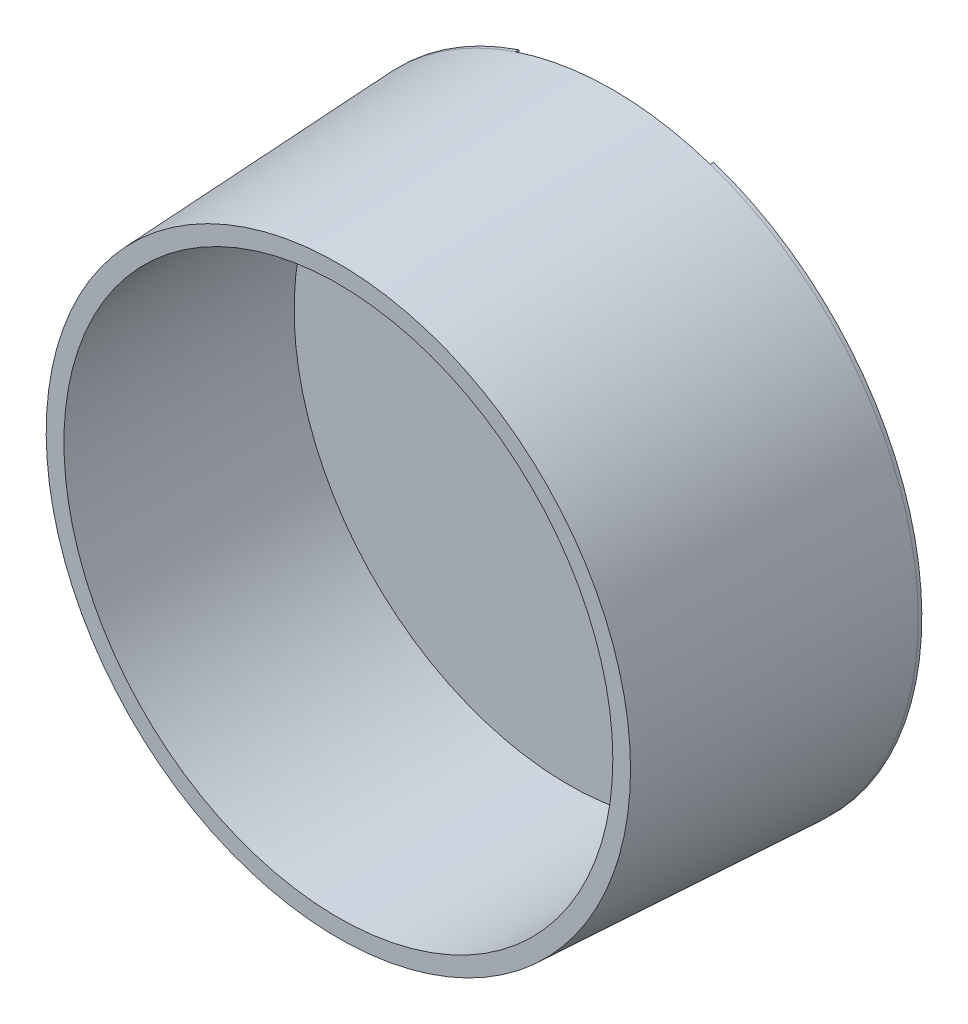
ISO-10303-21;
HEADER;
FILE_DESCRIPTION(('STEP AP214'),'2;1');
FILE_NAME('part.step','',(''),(''),'','','');
FILE_SCHEMA(('AUTOMOTIVE_DESIGN { 1 0 10303 214 1 1 1 1 }'));
ENDSEC;
DATA;
#1=APPLICATION_CONTEXT('core data for automotive mechanical design processes');
#2=APPLICATION_PROTOCOL_DEFINITION('international standard','automotive_design',2000,#1);
#3=PRODUCT_CONTEXT('',#1,'mechanical');
#4=PRODUCT('Part','Part','',(#3));
#5=PRODUCT_RELATED_PRODUCT_CATEGORY('part','',(#4));
#6=PRODUCT_DEFINITION_FORMATION('','',#4);
#7=PRODUCT_DEFINITION_CONTEXT('part definition',#1,'design');
#8=PRODUCT_DEFINITION('design','',#6,#7);
#9=PRODUCT_DEFINITION_SHAPE('','',#8);
#10=(LENGTH_UNIT() NAMED_UNIT(*) SI_UNIT(.MILLI.,.METRE.));
#11=(NAMED_UNIT(*) PLANE_ANGLE_UNIT() SI_UNIT($,.RADIAN.));
#12=(NAMED_UNIT(*) SI_UNIT($,.STERADIAN.) SOLID_ANGLE_UNIT());
#13=UNCERTAINTY_MEASURE_WITH_UNIT(LENGTH_MEASURE(1.E-05),#10,'distance_accuracy_value','');
#14=(GEOMETRIC_REPRESENTATION_CONTEXT(3) GLOBAL_UNCERTAINTY_ASSIGNED_CONTEXT((#13)) GLOBAL_UNIT_ASSIGNED_CONTEXT((#10,
#11,#12)) REPRESENTATION_CONTEXT('',''));
#15=CARTESIAN_POINT('',(0.,0.,0.));
#16=DIRECTION('',(0.,0.,1.));
#17=DIRECTION('',(1.,0.,0.));
#18=AXIS2_PLACEMENT_3D('',#15,#16,#17);
#19=CARTESIAN_POINT('',(0.,0.,-15.5));
#20=DIRECTION('',(0.,0.,1.));
#21=DIRECTION('',(1.,0.,0.));
#22=AXIS2_PLACEMENT_3D('',#19,#20,#21);
#23=PLANE('',#22);
#24=CARTESIAN_POINT('',(-2.67055918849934,1.71087586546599,-15.5));
#25=CARTESIAN_POINT('',(-2.66977240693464,1.68025209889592,-15.5));
#26=CARTESIAN_POINT('',(-2.66812406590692,1.61609399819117,-15.5));
#27=CARTESIAN_POINT('',(-2.66673232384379,1.51570611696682,-15.5));
#28=CARTESIAN_POINT('',(-2.66619252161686,1.40632718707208,-15.5));
#29=CARTESIAN_POINT('',(-2.66570810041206,1.33049385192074,-15.5));
#30=CARTESIAN_POINT('',(-2.66545502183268,1.29087586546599,-15.5));
#31=B_SPLINE_CURVE_WITH_KNOTS('',3,(#24,#25,#26,#27,#28,#29,#30),.UNSPECIFIED.,.F.,.F.,(4,1,1,1,
4),(0.,0.218790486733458,0.458375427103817,0.717036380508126,1.),.UNSPECIFIED.);
#32=CARTESIAN_POINT('',(-2.67055918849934,1.71087586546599,-15.5));
#33=VERTEX_POINT('',#32);
#34=CARTESIAN_POINT('',(-2.66545502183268,1.29087586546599,-15.5));
#35=VERTEX_POINT('',#34);
#36=EDGE_CURVE('E450',#33,#35,#31,.T.);
#37=ORIENTED_EDGE('',*,*,#36,.T.);
#38=DIRECTION('',(0.,-1.,0.));
#39=VECTOR('',#38,1.);
#40=CARTESIAN_POINT('',(-2.66545502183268,1.29087586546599,-15.5));
#41=LINE('',#40,#39);
#42=CARTESIAN_POINT('',(-2.66545502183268,-0.759540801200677,-15.5));
#43=VERTEX_POINT('',#42);
#44=EDGE_CURVE('E1668',#35,#43,#41,.T.);
#45=ORIENTED_EDGE('',*,*,#44,.T.);
#46=CARTESIAN_POINT('',(-2.66545502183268,-0.759540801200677,-15.5));
#47=CARTESIAN_POINT('',(-2.66570896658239,-0.807422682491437,-15.5));
#48=CARTESIAN_POINT('',(-2.66619365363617,-0.898811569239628,-15.5));
#49=CARTESIAN_POINT('',(-2.66671592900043,-1.02933584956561,-15.5));
#50=CARTESIAN_POINT('',(-2.66811665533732,-1.14746603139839,-15.5));
#51=CARTESIAN_POINT('',(-2.66977193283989,-1.22207659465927,-15.5));
#52=CARTESIAN_POINT('',(-2.67055918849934,-1.25756163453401,-15.5));
#53=B_SPLINE_CURVE_WITH_KNOTS('',3,(#46,#47,#48,#49,#50,#51,#52),.UNSPECIFIED.,.F.,.F.,(4,1,1,1,
4),(0.,0.28841658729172,0.550481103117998,0.786207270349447,1.),.UNSPECIFIED.);
#54=CARTESIAN_POINT('',(-2.67055918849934,-1.25756163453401,-15.5));
#55=VERTEX_POINT('',#54);
#56=EDGE_CURVE('E429',#43,#55,#53,.T.);
#57=ORIENTED_EDGE('',*,*,#56,.T.);
#58=CARTESIAN_POINT('',(-2.67055918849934,-1.25756163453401,-15.5));
#59=CARTESIAN_POINT('',(-2.67195287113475,-1.26756322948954,-15.5));
#60=CARTESIAN_POINT('',(-2.67466657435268,-1.28703779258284,-15.5));
#61=CARTESIAN_POINT('',(-2.69306094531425,-1.31256619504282,-15.5));
#62=CARTESIAN_POINT('',(-2.72128173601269,-1.33144115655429,-15.5));
#63=CARTESIAN_POINT('',(-2.74418836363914,-1.33885614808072,-15.5));
#64=CARTESIAN_POINT('',(-2.75660085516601,-1.34287413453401,-15.5));
#65=B_SPLINE_CURVE_WITH_KNOTS('',3,(#58,#59,#60,#61,#62,#63,#64),.UNSPECIFIED.,.F.,.F.,(4,1,1,1,
4),(0.,0.229636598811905,0.447135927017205,0.700417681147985,1.),.UNSPECIFIED.);
#66=CARTESIAN_POINT('',(-2.75660085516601,-1.34287413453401,-15.5));
#67=VERTEX_POINT('',#66);
#68=EDGE_CURVE('E56',#55,#67,#65,.T.);
#69=ORIENTED_EDGE('',*,*,#68,.T.);
#70=DIRECTION('',(-0.953318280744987,-0.301967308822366,0.));
#71=VECTOR('',#70,1.);
#72=CARTESIAN_POINT('',(-2.75660085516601,-1.34287413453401,-15.5));
#73=LINE('',#72,#71);
#74=CARTESIAN_POINT('',(-3.03514252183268,-1.43110330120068,-15.5));
#75=VERTEX_POINT('',#74);
#76=EDGE_CURVE('E1682',#67,#75,#73,.T.);
#77=ORIENTED_EDGE('',*,*,#76,.T.);
#78=DIRECTION('',(-0.0468235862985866,-0.998903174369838,0.));
#79=VECTOR('',#78,1.);
#80=CARTESIAN_POINT('',(-3.03514252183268,-1.43110330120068,-15.5));
#81=LINE('',#80,#79);
#82=CARTESIAN_POINT('',(-3.03951752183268,-1.52443663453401,-15.5));
#83=VERTEX_POINT('',#82);
#84=EDGE_CURVE('E1688',#75,#83,#81,.T.);
#85=ORIENTED_EDGE('',*,*,#84,.T.);
#86=CARTESIAN_POINT('',(-3.03951752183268,-1.52443663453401,-15.5));
#87=CARTESIAN_POINT('',(-2.93646634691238,-1.52212471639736,-15.5));
#88=CARTESIAN_POINT('',(-2.73572716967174,-1.51762120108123,-15.5));
#89=CARTESIAN_POINT('',(-2.53493812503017,-1.517300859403,-15.5));
#90=CARTESIAN_POINT('',(-2.43722585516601,-1.51714496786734,-15.5));
#91=B_SPLINE_CURVE_WITH_KNOTS('',3,(#86,#87,#88,#89,#90),.UNSPECIFIED.,.F.,.F.,(4,1,4),(0.,
0.513358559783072,1.),.UNSPECIFIED.);
#92=CARTESIAN_POINT('',(-2.43722585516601,-1.51714496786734,-15.5));
#93=VERTEX_POINT('',#92);
#94=EDGE_CURVE('E1691',#83,#93,#91,.T.);
#95=ORIENTED_EDGE('',*,*,#94,.T.);
#96=CARTESIAN_POINT('',(-2.43722585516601,-1.51714496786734,-15.5));
#97=CARTESIAN_POINT('',(-2.3385412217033,-1.51729022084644,-15.5));
#98=CARTESIAN_POINT('',(-2.13750873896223,-1.51758611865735,-15.5));
#99=CARTESIAN_POINT('',(-1.93652702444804,-1.52212555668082,-15.5));
#100=CARTESIAN_POINT('',(-1.83420502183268,-1.52443663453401,-15.5));
#101=B_SPLINE_CURVE_WITH_KNOTS('',3,(#96,#97,#98,#99,#100),.UNSPECIFIED.,.F.,.F.,(4,1,4),(0.,
0.490888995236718,1.),.UNSPECIFIED.);
#102=CARTESIAN_POINT('',(-1.83420502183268,-1.52443663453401,-15.5));
#103=VERTEX_POINT('',#102);
#104=EDGE_CURVE('E1696',#93,#103,#101,.T.);
#105=ORIENTED_EDGE('',*,*,#104,.T.);
#106=DIRECTION('',(0.101042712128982,0.99488208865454,0.));
#107=VECTOR('',#106,1.);
#108=CARTESIAN_POINT('',(-1.83420502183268,-1.52443663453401,-15.5));
#109=LINE('',#108,#107);
#110=CARTESIAN_POINT('',(-1.82472585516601,-1.43110330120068,-15.5));
#111=VERTEX_POINT('',#110);
#112=EDGE_CURVE('E1704',#103,#111,#109,.T.);
#113=ORIENTED_EDGE('',*,*,#112,.T.);
#114=DIRECTION('',(-0.955579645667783,0.294732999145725,0.));
#115=VECTOR('',#114,1.);
#116=CARTESIAN_POINT('',(-1.82472585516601,-1.43110330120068,-15.5));
#117=LINE('',#116,#115);
#118=CARTESIAN_POINT('',(-2.12733002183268,-1.33776996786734,-15.5));
#119=VERTEX_POINT('',#118);
#120=EDGE_CURVE('E1710',#111,#119,#117,.T.);
#121=ORIENTED_EDGE('',*,*,#120,.T.);
#122=CARTESIAN_POINT('',(-2.12733002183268,-1.33776996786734,-15.5));
#123=CARTESIAN_POINT('',(-2.13658525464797,-1.33439208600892,-15.5));
#124=CARTESIAN_POINT('',(-2.15415990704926,-1.32797786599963,-15.5));
#125=CARTESIAN_POINT('',(-2.17563479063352,-1.3105778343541,-15.5));
#126=CARTESIAN_POINT('',(-2.18996264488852,-1.28713782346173,-15.5));
#127=CARTESIAN_POINT('',(-2.19240130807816,-1.26919048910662,-15.5));
#128=CARTESIAN_POINT('',(-2.19368418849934,-1.25974913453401,-15.5));
#129=B_SPLINE_CURVE_WITH_KNOTS('',3,(#122,#123,#124,#125,#126,#127,#128),.UNSPECIFIED.,.F.,.F.,
(4,1,1,1,4),(0.,0.268089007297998,0.509071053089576,0.741742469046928,1.),.UNSPECIFIED.);
#130=CARTESIAN_POINT('',(-2.19368418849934,-1.25974913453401,-15.5));
#131=VERTEX_POINT('',#130);
#132=EDGE_CURVE('E1713',#119,#131,#129,.T.);
#133=ORIENTED_EDGE('',*,*,#132,.T.);
#134=CARTESIAN_POINT('',(-2.19368418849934,-1.25974913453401,-15.5));
#135=CARTESIAN_POINT('',(-2.19449045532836,-1.22426423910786,-15.5));
#136=CARTESIAN_POINT('',(-2.19619122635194,-1.1494110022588,-15.5));
#137=CARTESIAN_POINT('',(-2.19725520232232,-1.03079008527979,-15.5));
#138=CARTESIAN_POINT('',(-2.19923506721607,-0.899546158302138,-15.5));
#139=CARTESIAN_POINT('',(-2.19894190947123,-0.807666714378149,-15.5));
#140=CARTESIAN_POINT('',(-2.19878835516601,-0.759540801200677,-15.5));
#141=B_SPLINE_CURVE_WITH_KNOTS('',3,(#134,#135,#136,#137,#138,#139,#140),.UNSPECIFIED.,.F.,.F.,
(4,1,1,1,4),(0.,0.212856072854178,0.449006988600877,0.711393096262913,1.),.UNSPECIFIED.);
#142=CARTESIAN_POINT('',(-2.19878835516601,-0.759540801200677,-15.5));
#143=VERTEX_POINT('',#142);
#144=EDGE_CURVE('E1718',#131,#143,#141,.T.);
#145=ORIENTED_EDGE('',*,*,#144,.T.);
#146=DIRECTION('',(0.,1.,0.));
#147=VECTOR('',#146,1.);
#148=CARTESIAN_POINT('',(-2.19878835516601,-0.759540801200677,-15.5));
#149=LINE('',#148,#147);
#150=CARTESIAN_POINT('',(-2.19878835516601,1.28066753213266,-15.5));
#151=VERTEX_POINT('',#150);
#152=EDGE_CURVE('E1726',#143,#151,#149,.T.);
#153=ORIENTED_EDGE('',*,*,#152,.T.);
#154=CARTESIAN_POINT('',(-2.19878835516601,1.28066753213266,-15.5));
#155=CARTESIAN_POINT('',(-2.19894472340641,1.32125892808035,-15.5));
#156=CARTESIAN_POINT('',(-2.19924155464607,1.39831290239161,-15.5));
#157=CARTESIAN_POINT('',(-2.19725445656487,1.50816664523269,-15.5));
#158=CARTESIAN_POINT('',(-2.19619714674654,1.60685915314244,-15.5));
#159=CARTESIAN_POINT('',(-2.1944907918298,1.66907178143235,-15.5));
#160=CARTESIAN_POINT('',(-2.19368418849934,1.69848003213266,-15.5));
#161=B_SPLINE_CURVE_WITH_KNOTS('',3,(#154,#155,#156,#157,#158,#159,#160),.UNSPECIFIED.,.F.,.F.,
(4,1,1,1,4),(0.,0.291415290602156,0.553188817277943,0.788789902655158,1.),.UNSPECIFIED.);
#162=CARTESIAN_POINT('',(-2.19368418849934,1.69848003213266,-15.5));
#163=VERTEX_POINT('',#162);
#164=EDGE_CURVE('E1732',#151,#163,#161,.T.);
#165=ORIENTED_EDGE('',*,*,#164,.T.);
#166=CARTESIAN_POINT('',(-2.19368418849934,1.69848003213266,-15.5));
#167=CARTESIAN_POINT('',(-2.19289787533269,1.70861494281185,-15.5));
#168=CARTESIAN_POINT('',(-2.19141562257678,1.72771992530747,-15.5));
#169=CARTESIAN_POINT('',(-2.17877674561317,1.75300362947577,-15.5));
#170=CARTESIAN_POINT('',(-2.16012364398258,1.77334085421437,-15.5));
#171=CARTESIAN_POINT('',(-2.14326974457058,1.78024822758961,-15.5));
#172=CARTESIAN_POINT('',(-2.13462168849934,1.78379253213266,-15.5));
#173=B_SPLINE_CURVE_WITH_KNOTS('',3,(#166,#167,#168,#169,#170,#171,#172),.UNSPECIFIED.,.F.,.F.,
(4,1,1,1,4),(0.,0.272263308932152,0.513234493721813,0.75023136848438,1.),.UNSPECIFIED.);
#174=CARTESIAN_POINT('',(-2.13462168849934,1.78379253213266,-15.5));
#175=VERTEX_POINT('',#174);
#176=EDGE_CURVE('E1737',#163,#175,#173,.T.);
#177=ORIENTED_EDGE('',*,*,#176,.T.);
#178=DIRECTION('',(0.95160127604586,0.30733534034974,0.));
#179=VECTOR('',#178,1.);
#180=CARTESIAN_POINT('',(-2.13462168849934,1.78379253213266,-15.5));
#181=LINE('',#180,#179);
#182=CARTESIAN_POINT('',(-1.82983002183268,1.88223003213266,-15.5));
#183=VERTEX_POINT('',#182);
#184=EDGE_CURVE('E1745',#175,#183,#181,.T.);
#185=ORIENTED_EDGE('',*,*,#184,.T.);
#186=DIRECTION('',(0.0546059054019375,0.99850798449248,0.));
#187=VECTOR('',#186,1.);
#188=CARTESIAN_POINT('',(-1.82983002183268,1.88223003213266,-15.5));
#189=LINE('',#188,#187);
#190=CARTESIAN_POINT('',(-1.82472585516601,1.97556336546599,-15.5));
#191=VERTEX_POINT('',#190);
#192=EDGE_CURVE('E1751',#183,#191,#189,.T.);
#193=ORIENTED_EDGE('',*,*,#192,.T.);
#194=CARTESIAN_POINT('',(-1.82472585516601,1.97556336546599,-15.5));
#195=CARTESIAN_POINT('',(-1.9277747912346,1.97270637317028,-15.5));
#196=CARTESIAN_POINT('',(-2.12850134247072,1.9671413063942,-15.5));
#197=CARTESIAN_POINT('',(-2.32930324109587,1.96643022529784,-15.5));
#198=CARTESIAN_POINT('',(-2.42701752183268,1.96608419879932,-15.5));
#199=B_SPLINE_CURVE_WITH_KNOTS('',3,(#194,#195,#196,#197,#198),.UNSPECIFIED.,.F.,.F.,(4,1,4),
(0.,0.513379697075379,1.),.UNSPECIFIED.);
#200=CARTESIAN_POINT('',(-2.42701752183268,1.96608419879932,-15.5));
#201=VERTEX_POINT('',#200);
#202=EDGE_CURVE('E1754',#191,#201,#199,.T.);
#203=ORIENTED_EDGE('',*,*,#202,.T.);
#204=CARTESIAN_POINT('',(-2.42701752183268,1.96608419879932,-15.5));
#205=CARTESIAN_POINT('',(-2.52521800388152,1.96642464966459,-15.5));
#206=CARTESIAN_POINT('',(-2.72626319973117,1.96712165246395,-15.5));
#207=CARTESIAN_POINT('',(-2.92723247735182,1.97270645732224,-15.5));
#208=CARTESIAN_POINT('',(-3.03003835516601,1.97556336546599,-15.5));
#209=B_SPLINE_CURVE_WITH_KNOTS('',3,(#204,#205,#206,#207,#208),.UNSPECIFIED.,.F.,.F.,(4,1,4),
(0.,0.48844978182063,1.),.UNSPECIFIED.);
#210=CARTESIAN_POINT('',(-3.03003835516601,1.97556336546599,-15.5));
#211=VERTEX_POINT('',#210);
#212=EDGE_CURVE('E1759',#201,#211,#209,.T.);
#213=ORIENTED_EDGE('',*,*,#212,.T.);
#214=DIRECTION('',(-0.101042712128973,-0.994882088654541,0.));
#215=VECTOR('',#214,1.);
#216=CARTESIAN_POINT('',(-3.03003835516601,1.97556336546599,-15.5));
#217=LINE('',#216,#215);
#218=CARTESIAN_POINT('',(-3.03951752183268,1.88223003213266,-15.5));
#219=VERTEX_POINT('',#218);
#220=EDGE_CURVE('E1767',#211,#219,#217,.T.);
#221=ORIENTED_EDGE('',*,*,#220,.T.);
#222=DIRECTION('',(0.956173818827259,-0.29279963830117,0.));
#223=VECTOR('',#222,1.);
#224=CARTESIAN_POINT('',(-3.03951752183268,1.88223003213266,-15.5));
#225=LINE('',#224,#223);
#226=CARTESIAN_POINT('',(-2.73472585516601,1.78889669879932,-15.5));
#227=VERTEX_POINT('',#226);
#228=EDGE_CURVE('E1773',#219,#227,#225,.T.);
#229=ORIENTED_EDGE('',*,*,#228,.T.);
#230=CARTESIAN_POINT('',(-2.73472585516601,1.78889669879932,-15.5));
#231=CARTESIAN_POINT('',(-2.72561459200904,1.78616420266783,-15.5));
#232=CARTESIAN_POINT('',(-2.70831514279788,1.78097604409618,-15.5));
#233=CARTESIAN_POINT('',(-2.68837685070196,1.76245965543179,-15.5));
#234=CARTESIAN_POINT('',(-2.67425607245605,1.73899583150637,-15.5));
#235=CARTESIAN_POINT('',(-2.67183379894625,1.72057105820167,-15.5));
#236=CARTESIAN_POINT('',(-2.67055918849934,1.71087586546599,-15.5));
#237=B_SPLINE_CURVE_WITH_KNOTS('',3,(#230,#231,#232,#233,#234,#235,#236),.UNSPECIFIED.,.F.,.F.,
(4,1,1,1,4),(0.,0.259240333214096,0.492216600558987,0.732802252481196,1.),.UNSPECIFIED.);
#238=EDGE_CURVE('E453',#227,#33,#237,.T.);
#239=ORIENTED_EDGE('',*,*,#238,.T.);
#240=EDGE_LOOP('',(#37,#45,#57,#69,#77,#85,#95,#105,#113,#121,#133,#145,#153,#165,#177,#185,
#193,#203,#213,#221,#229,#239));
#241=FACE_BOUND('',#240,.T.);
#242=DIRECTION('',(0.952925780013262,0.303203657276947,0.));
#243=VECTOR('',#242,1.);
#244=CARTESIAN_POINT('',(-0.50128835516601,1.78525086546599,-15.5));
#245=LINE('',#244,#243);
#246=CARTESIAN_POINT('',(-0.50128835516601,1.78525086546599,-15.5));
#247=VERTEX_POINT('',#246);
#248=CARTESIAN_POINT('',(-0.196496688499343,1.88223003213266,-15.5));
#249=VERTEX_POINT('',#248);
#250=EDGE_CURVE('E588',#247,#249,#245,.T.);
#251=ORIENTED_EDGE('',*,*,#250,.T.);
#252=DIRECTION('',(0.0546059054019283,0.998507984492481,0.));
#253=VECTOR('',#252,1.);
#254=CARTESIAN_POINT('',(-0.196496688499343,1.88223003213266,-15.5));
#255=LINE('',#254,#253);
#256=CARTESIAN_POINT('',(-0.191392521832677,1.97556336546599,-15.5));
#257=VERTEX_POINT('',#256);
#258=EDGE_CURVE('E511',#249,#257,#255,.T.);
#259=ORIENTED_EDGE('',*,*,#258,.T.);
#260=CARTESIAN_POINT('',(-0.191392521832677,1.97556336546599,-15.5));
#261=CARTESIAN_POINT('',(-0.294684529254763,1.97270637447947,-15.5));
#262=CARTESIAN_POINT('',(-0.495897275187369,1.96714095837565,-15.5));
#263=CARTESIAN_POINT('',(-0.697185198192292,1.96643012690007,-15.5));
#264=CARTESIAN_POINT('',(-0.795142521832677,1.96608419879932,-15.5));
#265=B_SPLINE_CURVE_WITH_KNOTS('',3,(#260,#261,#262,#263,#264),.UNSPECIFIED.,.F.,.F.,(4,1,4),
(0.,0.51334723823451,1.),.UNSPECIFIED.);
#266=CARTESIAN_POINT('',(-0.795142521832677,1.96608419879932,-15.5));
#267=VERTEX_POINT('',#266);
#268=EDGE_CURVE('E514',#257,#267,#265,.T.);
#269=ORIENTED_EDGE('',*,*,#268,.T.);
#270=CARTESIAN_POINT('',(-0.795142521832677,1.96608419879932,-15.5));
#271=CARTESIAN_POINT('',(-0.893099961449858,1.96642473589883,-15.5));
#272=CARTESIAN_POINT('',(-1.09365913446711,1.96712195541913,-15.5));
#273=CARTESIAN_POINT('',(-1.29414221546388,1.97270645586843,-15.5));
#274=CARTESIAN_POINT('',(-1.39670502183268,1.97556336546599,-15.5));
#275=B_SPLINE_CURVE_WITH_KNOTS('',3,(#270,#271,#272,#273,#274),.UNSPECIFIED.,.F.,.F.,(4,1,4),
(0.,0.488421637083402,1.),.UNSPECIFIED.);
#276=CARTESIAN_POINT('',(-1.39670502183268,1.97556336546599,-15.5));
#277=VERTEX_POINT('',#276);
#278=EDGE_CURVE('E64',#267,#277,#275,.T.);
#279=ORIENTED_EDGE('',*,*,#278,.T.);
#280=DIRECTION('',(-0.131656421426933,-0.991295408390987,0.));
#281=VECTOR('',#280,1.);
#282=CARTESIAN_POINT('',(-1.39670502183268,1.97556336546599,-15.5));
#283=LINE('',#282,#281);
#284=CARTESIAN_POINT('',(-1.40910085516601,1.88223003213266,-15.5));
#285=VERTEX_POINT('',#284);
#286=EDGE_CURVE('E525',#277,#285,#283,.T.);
#287=ORIENTED_EDGE('',*,*,#286,.T.);
#288=DIRECTION('',(0.95763736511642,-0.287976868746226,0.));
#289=VECTOR('',#288,1.);
#290=CARTESIAN_POINT('',(-1.40910085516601,1.88223003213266,-15.5));
#291=LINE('',#290,#289);
#292=CARTESIAN_POINT('',(-1.10358002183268,1.79035503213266,-15.5));
#293=VERTEX_POINT('',#292);
#294=EDGE_CURVE('E531',#285,#293,#291,.T.);
#295=ORIENTED_EDGE('',*,*,#294,.T.);
#296=CARTESIAN_POINT('',(-1.10358002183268,1.79035503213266,-15.5));
#297=CARTESIAN_POINT('',(-1.09428478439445,1.78756499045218,-15.5));
#298=CARTESIAN_POINT('',(-1.076475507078,1.78221938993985,-15.5));
#299=CARTESIAN_POINT('',(-1.05530970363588,1.76454381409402,-15.5));
#300=CARTESIAN_POINT('',(-1.04080053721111,1.74099459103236,-15.5));
#301=CARTESIAN_POINT('',(-1.03846759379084,1.72276584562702,-15.5));
#302=CARTESIAN_POINT('',(-1.03722585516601,1.71306336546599,-15.5));
#303=B_SPLINE_CURVE_WITH_KNOTS('',3,(#296,#297,#298,#299,#300,#301,#302),.UNSPECIFIED.,.F.,.F.,
(4,1,1,1,4),(0.,0.262695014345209,0.503312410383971,0.735631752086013,1.),.UNSPECIFIED.);
#304=CARTESIAN_POINT('',(-1.03722585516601,1.71306336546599,-15.5));
#305=VERTEX_POINT('',#304);
#306=EDGE_CURVE('E534',#293,#305,#303,.T.);
#307=ORIENTED_EDGE('',*,*,#306,.T.);
#308=CARTESIAN_POINT('',(-1.03722585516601,1.71306336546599,-15.5));
#309=CARTESIAN_POINT('',(-1.03643975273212,1.68268265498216,-15.5));
#310=CARTESIAN_POINT('',(-1.03479852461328,1.61925367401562,-15.5));
#311=CARTESIAN_POINT('',(-1.03339688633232,1.52008121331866,-15.5));
#312=CARTESIAN_POINT('',(-1.03285930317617,1.41216051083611,-15.5));
#313=CARTESIAN_POINT('',(-1.03237489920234,1.33729940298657,-15.5));
#314=CARTESIAN_POINT('',(-1.03212168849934,1.29816753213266,-15.5));
#315=B_SPLINE_CURVE_WITH_KNOTS('',3,(#308,#309,#310,#311,#312,#313,#314),.UNSPECIFIED.,.F.,.F.,
(4,1,1,1,4),(0.,0.219724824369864,0.458742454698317,0.717070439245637,1.),.UNSPECIFIED.);
#316=CARTESIAN_POINT('',(-1.03212168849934,1.29816753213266,-15.5));
#317=VERTEX_POINT('',#316);
#318=EDGE_CURVE('E539',#305,#317,#315,.T.);
#319=ORIENTED_EDGE('',*,*,#318,.T.);
#320=DIRECTION('',(0.,-1.,0.));
#321=VECTOR('',#320,1.);
#322=CARTESIAN_POINT('',(-1.03212168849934,1.29816753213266,-15.5));
#323=LINE('',#322,#321);
#324=CARTESIAN_POINT('',(-1.03212168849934,-0.95349913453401,-15.5));
#325=VERTEX_POINT('',#324);
#326=EDGE_CURVE('E547',#317,#325,#323,.T.);
#327=ORIENTED_EDGE('',*,*,#326,.T.);
#328=CARTESIAN_POINT('',(-1.03212168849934,-0.95349913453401,-15.5));
#329=CARTESIAN_POINT('',(-1.03171221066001,-0.993117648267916,-15.5));
#330=CARTESIAN_POINT('',(-1.03091074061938,-1.07066287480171,-15.5));
#331=CARTESIAN_POINT('',(-1.02844707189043,-1.18422283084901,-15.5));
#332=CARTESIAN_POINT('',(-1.02242697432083,-1.29240558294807,-15.5));
#333=CARTESIAN_POINT('',(-1.01435297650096,-1.39498639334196,-15.5));
#334=CARTESIAN_POINT('',(-1.00493434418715,-1.49246684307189,-15.5));
#335=CARTESIAN_POINT('',(-0.98979897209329,-1.58428468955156,-15.5));
#336=CARTESIAN_POINT('',(-0.972891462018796,-1.67109094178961,-15.5));
#337=CARTESIAN_POINT('',(-0.951340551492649,-1.75253767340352,-15.5));
#338=CARTESIAN_POINT('',(-0.927251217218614,-1.82947250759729,-15.5));
#339=CARTESIAN_POINT('',(-0.89649955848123,-1.90145056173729,-15.5));
#340=CARTESIAN_POINT('',(-0.862903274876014,-1.96983364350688,-15.5));
#341=CARTESIAN_POINT('',(-0.823668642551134,-2.03385451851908,-15.5));
#342=CARTESIAN_POINT('',(-0.779933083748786,-2.09442582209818,-15.5));
#343=CARTESIAN_POINT('',(-0.729000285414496,-2.15022416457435,-15.5));
#344=CARTESIAN_POINT('',(-0.673676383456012,-2.2038786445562,-15.5));
#345=CARTESIAN_POINT('',(-0.612095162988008,-2.25352962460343,-15.5));
#346=CARTESIAN_POINT('',(-0.544098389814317,-2.29969291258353,-15.5));
#347=CARTESIAN_POINT('',(-0.469886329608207,-2.34370176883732,-15.5));
#348=CARTESIAN_POINT('',(-0.387536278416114,-2.38334902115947,-15.5));
#349=CARTESIAN_POINT('',(-0.298636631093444,-2.42148429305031,-15.5));
#350=CARTESIAN_POINT('',(-0.201320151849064,-2.45643235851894,-15.5));
#351=CARTESIAN_POINT('',(-0.0958997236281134,-2.48961997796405,-15.5));
#352=CARTESIAN_POINT('',(0.0181051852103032,-2.52190227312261,-15.5));
#353=CARTESIAN_POINT('',(0.0972896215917,-2.54115742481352,-15.5));
#354=CARTESIAN_POINT('',(0.138190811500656,-2.55110330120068,-15.5));
#355=B_SPLINE_CURVE_WITH_KNOTS('',3,(#328,#329,#330,#331,#332,#333,#334,#335,#336,#337,#338,
#339,#340,#341,#342,#343,#344,#345,#346,#347,#348,#349,#350,#351,#352,#353,#354),.UNSPECIFIED.,
.F.,.F.,(4,1,1,1,1,1,1,1,1,1,1,1,1,1,1,1,1,1,1,1,1,1,1,1,4),(0.,0.0532157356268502,
0.104159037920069,0.152544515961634,0.198714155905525,0.242372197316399,0.28402014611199,
0.323650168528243,0.361102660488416,0.397132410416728,0.431811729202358,0.466120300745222,
0.499376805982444,0.532546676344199,0.566299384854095,0.600701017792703,0.635982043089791,
0.672382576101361,0.71101445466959,0.751747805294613,0.795041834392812,0.84089415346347,
0.890554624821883,0.943468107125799,1.),.UNSPECIFIED.);
#356=CARTESIAN_POINT('',(0.138190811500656,-2.55110330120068,-15.5));
#357=VERTEX_POINT('',#356);
#358=EDGE_CURVE('E553',#325,#357,#355,.T.);
#359=ORIENTED_EDGE('',*,*,#358,.T.);
#360=DIRECTION('',(0.287347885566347,0.957826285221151,0.));
#361=VECTOR('',#360,1.);
#362=CARTESIAN_POINT('',(0.138190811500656,-2.55110330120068,-15.5));
#363=LINE('',#362,#361);
#364=CARTESIAN_POINT('',(0.175378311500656,-2.42714496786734,-15.5));
#365=VERTEX_POINT('',#364);
#366=EDGE_CURVE('E558',#357,#365,#363,.T.);
#367=ORIENTED_EDGE('',*,*,#366,.T.);
#368=CARTESIAN_POINT('',(0.175378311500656,-2.42714496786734,-15.5));
#369=CARTESIAN_POINT('',(0.134761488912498,-2.40898703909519,-15.5));
#370=CARTESIAN_POINT('',(0.0566959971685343,-2.37408751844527,-15.5));
#371=CARTESIAN_POINT('',(-0.0510639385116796,-2.31513036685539,-15.5));
#372=CARTESIAN_POINT('',(-0.145686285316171,-2.25384265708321,-15.5));
#373=CARTESIAN_POINT('',(-0.226858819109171,-2.18857889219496,-15.5));
#374=CARTESIAN_POINT('',(-0.296086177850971,-2.11863622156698,-15.5));
#375=CARTESIAN_POINT('',(-0.35734033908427,-2.04624006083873,-15.5));
#376=CARTESIAN_POINT('',(-0.407628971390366,-1.96778601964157,-15.5));
#377=CARTESIAN_POINT('',(-0.450675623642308,-1.88549993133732,-15.5));
#378=CARTESIAN_POINT('',(-0.484502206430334,-1.79771859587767,-15.5));
#379=CARTESIAN_POINT('',(-0.511626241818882,-1.70500323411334,-15.5));
#380=CARTESIAN_POINT('',(-0.53195855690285,-1.60720886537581,-15.5));
#381=CARTESIAN_POINT('',(-0.545324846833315,-1.50355090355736,-15.5));
#382=CARTESIAN_POINT('',(-0.554429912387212,-1.39402981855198,-15.5));
#383=CARTESIAN_POINT('',(-0.561007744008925,-1.2780479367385,-15.5));
#384=CARTESIAN_POINT('',(-0.564470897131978,-1.15525642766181,-15.5));
#385=CARTESIAN_POINT('',(-0.565120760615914,-1.071139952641,-15.5));
#386=CARTESIAN_POINT('',(-0.565455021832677,-1.02787413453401,-15.5));
#387=B_SPLINE_CURVE_WITH_KNOTS('',3,(#368,#369,#370,#371,#372,#373,#374,#375,#376,#377,#378,
#379,#380,#381,#382,#383,#384,#385,#386),.UNSPECIFIED.,.F.,.F.,(4,1,1,1,1,1,1,1,1,1,1,1,1,1,1,1,
4),(0.,0.0776341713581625,0.149212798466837,0.214166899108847,0.274197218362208,
0.33059611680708,0.38573141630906,0.439390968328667,0.4929010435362,0.547577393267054,
0.60329075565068,0.661368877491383,0.721729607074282,0.785606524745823,0.853171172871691,
0.924477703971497,1.),.UNSPECIFIED.);
#388=CARTESIAN_POINT('',(-0.565455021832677,-1.02787413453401,-15.5));
#389=VERTEX_POINT('',#388);
#390=EDGE_CURVE('E564',#365,#389,#387,.T.);
#391=ORIENTED_EDGE('',*,*,#390,.T.);
#392=DIRECTION('',(0.,1.,0.));
#393=VECTOR('',#392,1.);
#394=CARTESIAN_POINT('',(-0.565455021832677,-1.02787413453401,-15.5));
#395=LINE('',#394,#393);
#396=CARTESIAN_POINT('',(-0.565455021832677,1.28795919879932,-15.5));
#397=VERTEX_POINT('',#396);
#398=EDGE_CURVE('E569',#389,#397,#395,.T.);
#399=ORIENTED_EDGE('',*,*,#398,.T.);
#400=CARTESIAN_POINT('',(-0.565455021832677,1.28795919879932,-15.5));
#401=CARTESIAN_POINT('',(-0.565613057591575,1.328307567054,-15.5));
#402=CARTESIAN_POINT('',(-0.565912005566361,1.40463246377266,-15.5));
#403=CARTESIAN_POINT('',(-0.563922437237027,1.51327080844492,-15.5));
#404=CARTESIAN_POINT('',(-0.562865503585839,1.61050520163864,-15.5));
#405=CARTESIAN_POINT('',(-0.561157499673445,1.67174541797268,-15.5));
#406=CARTESIAN_POINT('',(-0.56035085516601,1.70066753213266,-15.5));
#407=B_SPLINE_CURVE_WITH_KNOTS('',3,(#400,#401,#402,#403,#404,#405,#406),.UNSPECIFIED.,.F.,.F.,
(4,1,1,1,4),(0.,0.293251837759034,0.554729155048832,0.789710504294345,1.),.UNSPECIFIED.);
#408=CARTESIAN_POINT('',(-0.56035085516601,1.70066753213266,-15.5));
#409=VERTEX_POINT('',#408);
#410=EDGE_CURVE('E575',#397,#409,#407,.T.);
#411=ORIENTED_EDGE('',*,*,#410,.T.);
#412=CARTESIAN_POINT('',(-0.56035085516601,1.70066753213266,-15.5));
#413=CARTESIAN_POINT('',(-0.559549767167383,1.71078812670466,-15.5));
#414=CARTESIAN_POINT('',(-0.558039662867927,1.72986612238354,-15.5));
#415=CARTESIAN_POINT('',(-0.545668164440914,1.75517420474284,-15.5));
#416=CARTESIAN_POINT('',(-0.526508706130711,1.77475359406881,-15.5));
#417=CARTESIAN_POINT('',(-0.509895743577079,1.78166827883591,-15.5));
#418=CARTESIAN_POINT('',(-0.50128835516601,1.78525086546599,-15.5));
#419=B_SPLINE_CURVE_WITH_KNOTS('',3,(#412,#413,#414,#415,#416,#417,#418),.UNSPECIFIED.,.F.,.F.,
(4,1,1,1,4),(0.,0.27354669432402,0.515653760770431,0.749054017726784,1.),.UNSPECIFIED.);
#420=EDGE_CURVE('E580',#409,#247,#419,.T.);
#421=ORIENTED_EDGE('',*,*,#420,.T.);
#422=EDGE_LOOP('',(#251,#259,#269,#279,#287,#295,#307,#319,#327,#359,#367,#391,#399,#411,#421));
#423=FACE_BOUND('',#422,.T.);
#424=CARTESIAN_POINT('',(0.227878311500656,0.406396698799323,-15.5));
#425=CARTESIAN_POINT('',(0.22906037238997,0.331953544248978,-15.5));
#426=CARTESIAN_POINT('',(0.231361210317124,0.187052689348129,-15.5));
#427=CARTESIAN_POINT('',(0.255461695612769,-0.023572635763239,-15.5));
#428=CARTESIAN_POINT('',(0.293020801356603,-0.221397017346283,-15.5));
#429=CARTESIAN_POINT('',(0.345069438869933,-0.407064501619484,-15.5));
#430=CARTESIAN_POINT('',(0.413715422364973,-0.579499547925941,-15.5));
#431=CARTESIAN_POINT('',(0.497263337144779,-0.739286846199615,-15.5));
#432=CARTESIAN_POINT('',(0.596298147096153,-0.886043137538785,-15.5));
#433=CARTESIAN_POINT('',(0.71010555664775,-1.01976864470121,-15.5));
#434=CARTESIAN_POINT('',(0.837934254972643,-1.13881469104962,-15.5));
#435=CARTESIAN_POINT('',(0.978439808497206,-1.24237071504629,-15.5));
#436=CARTESIAN_POINT('',(1.13077126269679,-1.33058579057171,-15.5));
#437=CARTESIAN_POINT('',(1.29631430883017,-1.4011613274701,-15.5));
#438=CARTESIAN_POINT('',(1.47348568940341,-1.45642321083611,-15.5));
#439=CARTESIAN_POINT('',(1.66257813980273,-1.49668258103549,-15.5));
#440=CARTESIAN_POINT('',(1.86403331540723,-1.51988354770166,-15.5));
#441=CARTESIAN_POINT('',(2.00236659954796,-1.52289188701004,-15.5));
#442=CARTESIAN_POINT('',(2.07339914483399,-1.52443663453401,-15.5));
#443=B_SPLINE_CURVE_WITH_KNOTS('',3,(#424,#425,#426,#427,#428,#429,#430,#431,#432,#433,#434,
#435,#436,#437,#438,#439,#440,#441,#442),.UNSPECIFIED.,.F.,.F.,(4,1,1,1,1,1,1,1,1,1,1,1,1,1,1,1,
4),(0.,0.0735423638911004,0.143147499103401,0.209195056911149,0.272380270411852,
0.333400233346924,0.392280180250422,0.450241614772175,0.508003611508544,0.565449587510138,
0.622476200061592,0.680157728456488,0.739012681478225,0.79994180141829,0.86330756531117,
0.929810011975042,1.),.UNSPECIFIED.);
#444=CARTESIAN_POINT('',(0.227878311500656,0.406396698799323,-15.5));
#445=VERTEX_POINT('',#444);
#446=CARTESIAN_POINT('',(2.07339914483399,-1.52443663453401,-15.5));
#447=VERTEX_POINT('',#446);
#448=EDGE_CURVE('E768',#445,#447,#443,.T.);
#449=ORIENTED_EDGE('',*,*,#448,.T.);
#450=CARTESIAN_POINT('',(2.07339914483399,-1.52443663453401,-15.5));
#451=CARTESIAN_POINT('',(2.11253110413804,-1.52448597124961,-15.5));
#452=CARTESIAN_POINT('',(2.18860832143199,-1.52458188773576,-15.5));
#453=CARTESIAN_POINT('',(2.29944565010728,-1.52390660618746,-15.5));
#454=CARTESIAN_POINT('',(2.40371187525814,-1.52225330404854,-15.5));
#455=CARTESIAN_POINT('',(2.53714956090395,-1.52036436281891,-15.5));
#456=CARTESIAN_POINT('',(2.70849038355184,-1.5171676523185,-15.5));
#457=CARTESIAN_POINT('',(2.84728592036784,-1.51715276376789,-15.5));
#458=CARTESIAN_POINT('',(2.91996164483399,-1.51714496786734,-15.5));
#459=B_SPLINE_CURVE_WITH_KNOTS('',3,(#450,#451,#452,#453,#454,#455,#456,#457,#458),
.UNSPECIFIED.,.F.,.F.,(4,1,1,1,1,1,4),(0.,0.138665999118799,0.269583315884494,0.392758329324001,
0.508182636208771,0.742475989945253,1.),.UNSPECIFIED.);
#460=CARTESIAN_POINT('',(2.91996164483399,-1.51714496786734,-15.5));
#461=VERTEX_POINT('',#460);
#462=EDGE_CURVE('E680',#447,#461,#459,.T.);
#463=ORIENTED_EDGE('',*,*,#462,.T.);
#464=CARTESIAN_POINT('',(2.91996164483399,-1.51714496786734,-15.5));
#465=CARTESIAN_POINT('',(3.02083382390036,-1.51728224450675,-15.5));
#466=CARTESIAN_POINT('',(3.22502593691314,-1.51756012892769,-15.5));
#467=CARTESIAN_POINT('',(3.42916735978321,-1.52212622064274,-15.5));
#468=CARTESIAN_POINT('',(3.53246164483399,-1.52443663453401,-15.5));
#469=B_SPLINE_CURVE_WITH_KNOTS('',3,(#464,#465,#466,#467,#468),.UNSPECIFIED.,.F.,.F.,(4,1,4),
(0.,0.494006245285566,1.),.UNSPECIFIED.);
#470=CARTESIAN_POINT('',(3.53246164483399,-1.52443663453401,-15.5));
#471=VERTEX_POINT('',#470);
#472=EDGE_CURVE('E688',#461,#471,#469,.T.);
#473=ORIENTED_EDGE('',*,*,#472,.T.);
#474=DIRECTION('',(0.101042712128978,0.99488208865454,0.));
#475=VECTOR('',#474,1.);
#476=CARTESIAN_POINT('',(3.53246164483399,-1.52443663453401,-15.5));
#477=LINE('',#476,#475);
#478=CARTESIAN_POINT('',(3.54194081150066,-1.43110330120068,-15.5));
#479=VERTEX_POINT('',#478);
#480=EDGE_CURVE('E697',#471,#479,#477,.T.);
#481=ORIENTED_EDGE('',*,*,#480,.T.);
#482=DIRECTION('',(-0.955579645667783,0.294732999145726,0.));
#483=VECTOR('',#482,1.);
#484=CARTESIAN_POINT('',(3.54194081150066,-1.43110330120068,-15.5));
#485=LINE('',#484,#483);
#486=CARTESIAN_POINT('',(3.23933664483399,-1.33776996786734,-15.5));
#487=VERTEX_POINT('',#486);
#488=EDGE_CURVE('E703',#479,#487,#485,.T.);
#489=ORIENTED_EDGE('',*,*,#488,.T.);
#490=CARTESIAN_POINT('',(3.23933664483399,-1.33776996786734,-15.5));
#491=CARTESIAN_POINT('',(3.22959583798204,-1.33416957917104,-15.5));
#492=CARTESIAN_POINT('',(3.21155866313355,-1.32750269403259,-15.5));
#493=CARTESIAN_POINT('',(3.1894959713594,-1.31005655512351,-15.5));
#494=CARTESIAN_POINT('',(3.17613723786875,-1.28645728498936,-15.5));
#495=CARTESIAN_POINT('',(3.1740644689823,-1.2689092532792,-15.5));
#496=CARTESIAN_POINT('',(3.17298247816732,-1.25974913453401,-15.5));
#497=B_SPLINE_CURVE_WITH_KNOTS('',3,(#490,#491,#492,#493,#494,#495,#496),.UNSPECIFIED.,.F.,.F.,
(4,1,1,1,4),(0.,0.281902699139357,0.522002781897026,0.750484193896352,1.),.UNSPECIFIED.);
#498=CARTESIAN_POINT('',(3.17298247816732,-1.25974913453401,-15.5));
#499=VERTEX_POINT('',#498);
#500=EDGE_CURVE('E706',#487,#499,#497,.T.);
#501=ORIENTED_EDGE('',*,*,#500,.T.);
#502=CARTESIAN_POINT('',(3.17298247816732,-1.25974913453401,-15.5));
#503=CARTESIAN_POINT('',(3.17217621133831,-1.22426423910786,-15.5));
#504=CARTESIAN_POINT('',(3.17047544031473,-1.1494110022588,-15.5));
#505=CARTESIAN_POINT('',(3.16941146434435,-1.03079008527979,-15.5));
#506=CARTESIAN_POINT('',(3.1674315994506,-0.899546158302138,-15.5));
#507=CARTESIAN_POINT('',(3.16772475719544,-0.807666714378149,-15.5));
#508=CARTESIAN_POINT('',(3.16787831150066,-0.759540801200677,-15.5));
#509=B_SPLINE_CURVE_WITH_KNOTS('',3,(#502,#503,#504,#505,#506,#507,#508),.UNSPECIFIED.,.F.,.F.,
(4,1,1,1,4),(0.,0.212856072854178,0.449006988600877,0.711393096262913,1.),.UNSPECIFIED.);
#510=CARTESIAN_POINT('',(3.16787831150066,-0.759540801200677,-15.5));
#511=VERTEX_POINT('',#510);
#512=EDGE_CURVE('E711',#499,#511,#509,.T.);
#513=ORIENTED_EDGE('',*,*,#512,.T.);
#514=DIRECTION('',(0.,1.,0.));
#515=VECTOR('',#514,1.);
#516=CARTESIAN_POINT('',(3.16787831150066,-0.759540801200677,-15.5));
#517=LINE('',#516,#515);
#518=CARTESIAN_POINT('',(3.16787831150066,1.28066753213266,-15.5));
#519=VERTEX_POINT('',#518);
#520=EDGE_CURVE('E719',#511,#519,#517,.T.);
#521=ORIENTED_EDGE('',*,*,#520,.T.);
#522=CARTESIAN_POINT('',(3.16787831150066,1.28066753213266,-15.5));
#523=CARTESIAN_POINT('',(3.16772194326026,1.32125892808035,-15.5));
#524=CARTESIAN_POINT('',(3.1674251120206,1.39831290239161,-15.5));
#525=CARTESIAN_POINT('',(3.1694122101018,1.50816664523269,-15.5));
#526=CARTESIAN_POINT('',(3.17046951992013,1.60685915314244,-15.5));
#527=CARTESIAN_POINT('',(3.17217587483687,1.66907178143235,-15.5));
#528=CARTESIAN_POINT('',(3.17298247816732,1.69848003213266,-15.5));
#529=B_SPLINE_CURVE_WITH_KNOTS('',3,(#522,#523,#524,#525,#526,#527,#528),.UNSPECIFIED.,.F.,.F.,
(4,1,1,1,4),(0.,0.291415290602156,0.553188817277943,0.788789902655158,1.),.UNSPECIFIED.);
#530=CARTESIAN_POINT('',(3.17298247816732,1.69848003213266,-15.5));
#531=VERTEX_POINT('',#530);
#532=EDGE_CURVE('E725',#519,#531,#529,.T.);
#533=ORIENTED_EDGE('',*,*,#532,.T.);
#534=CARTESIAN_POINT('',(3.17298247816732,1.69848003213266,-15.5));
#535=CARTESIAN_POINT('',(3.17376879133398,1.70861494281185,-15.5));
#536=CARTESIAN_POINT('',(3.17525104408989,1.72771992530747,-15.5));
#537=CARTESIAN_POINT('',(3.18788992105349,1.75300362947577,-15.5));
#538=CARTESIAN_POINT('',(3.20654302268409,1.77334085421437,-15.5));
#539=CARTESIAN_POINT('',(3.22339692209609,1.78024822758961,-15.5));
#540=CARTESIAN_POINT('',(3.23204497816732,1.78379253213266,-15.5));
#541=B_SPLINE_CURVE_WITH_KNOTS('',3,(#534,#535,#536,#537,#538,#539,#540),.UNSPECIFIED.,.F.,.F.,
(4,1,1,1,4),(0.,0.272263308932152,0.513234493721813,0.750231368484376,1.),.UNSPECIFIED.);
#542=CARTESIAN_POINT('',(3.23204497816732,1.78379253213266,-15.5));
#543=VERTEX_POINT('',#542);
#544=EDGE_CURVE('E730',#531,#543,#541,.T.);
#545=ORIENTED_EDGE('',*,*,#544,.T.);
#546=DIRECTION('',(0.95160127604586,0.30733534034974,0.));
#547=VECTOR('',#546,1.);
#548=CARTESIAN_POINT('',(3.23204497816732,1.78379253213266,-15.5));
#549=LINE('',#548,#547);
#550=CARTESIAN_POINT('',(3.53683664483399,1.88223003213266,-15.5));
#551=VERTEX_POINT('',#550);
#552=EDGE_CURVE('E738',#543,#551,#549,.T.);
#553=ORIENTED_EDGE('',*,*,#552,.T.);
#554=DIRECTION('',(0.0546059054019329,0.99850798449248,0.));
#555=VECTOR('',#554,1.);
#556=CARTESIAN_POINT('',(3.53683664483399,1.88223003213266,-15.5));
#557=LINE('',#556,#555);
#558=CARTESIAN_POINT('',(3.54194081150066,1.97556336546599,-15.5));
#559=VERTEX_POINT('',#558);
#560=EDGE_CURVE('E744',#551,#559,#557,.T.);
#561=ORIENTED_EDGE('',*,*,#560,.T.);
#562=CARTESIAN_POINT('',(3.54194081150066,1.97556336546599,-15.5));
#563=CARTESIAN_POINT('',(3.43743339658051,1.97270684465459,-15.5));
#564=CARTESIAN_POINT('',(3.23087396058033,1.96706091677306,-15.5));
#565=CARTESIAN_POINT('',(3.02423865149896,1.96640718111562,-15.5));
#566=CARTESIAN_POINT('',(2.92214914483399,1.96608419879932,-15.5));
#567=B_SPLINE_CURVE_WITH_KNOTS('',3,(#562,#563,#564,#565,#566),.UNSPECIFIED.,.F.,.F.,(4,1,4),
(0.,0.505943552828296,1.),.UNSPECIFIED.);
#568=CARTESIAN_POINT('',(2.92214914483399,1.96608419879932,-15.5));
#569=VERTEX_POINT('',#568);
#570=EDGE_CURVE('E747',#559,#569,#567,.T.);
#571=ORIENTED_EDGE('',*,*,#570,.T.);
#572=CARTESIAN_POINT('',(2.92214914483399,1.96608419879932,-15.5));
#573=CARTESIAN_POINT('',(2.8409676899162,1.96646047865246,-15.5));
#574=CARTESIAN_POINT('',(2.68151684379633,1.96719954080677,-15.5));
#575=CARTESIAN_POINT('',(2.44405173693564,1.97019343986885,-15.5));
#576=CARTESIAN_POINT('',(2.2078240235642,1.97475580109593,-15.5));
#577=CARTESIAN_POINT('',(2.04982515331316,1.97529198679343,-15.5));
#578=CARTESIAN_POINT('',(1.96985747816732,1.97556336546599,-15.5));
#579=B_SPLINE_CURVE_WITH_KNOTS('',3,(#572,#573,#574,#575,#576,#577,#578),.UNSPECIFIED.,.F.,.F.,
(4,1,1,1,4),(0.,0.255732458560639,0.502291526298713,0.748095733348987,1.),.UNSPECIFIED.);
#580=CARTESIAN_POINT('',(1.96985747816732,1.97556336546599,-15.5));
#581=VERTEX_POINT('',#580);
#582=EDGE_CURVE('E752',#569,#581,#579,.T.);
#583=ORIENTED_EDGE('',*,*,#582,.T.);
#584=CARTESIAN_POINT('',(1.96985747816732,1.97556336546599,-15.5));
#585=CARTESIAN_POINT('',(1.89956469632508,1.97466155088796,-15.5));
#586=CARTESIAN_POINT('',(1.76332193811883,1.97291363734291,-15.5));
#587=CARTESIAN_POINT('',(1.56601889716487,1.9532848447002,-15.5));
#588=CARTESIAN_POINT('',(1.38212225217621,1.92328323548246,-15.5));
#589=CARTESIAN_POINT('',(1.21129984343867,1.88068784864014,-15.5));
#590=CARTESIAN_POINT('',(1.05416770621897,1.82441321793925,-15.5));
#591=CARTESIAN_POINT('',(0.910035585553,1.75683343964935,-15.5));
#592=CARTESIAN_POINT('',(0.779903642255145,1.67601440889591,-15.5));
#593=CARTESIAN_POINT('',(0.662968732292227,1.58317179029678,-15.5));
#594=CARTESIAN_POINT('',(0.560338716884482,1.47714403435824,-15.5));
#595=CARTESIAN_POINT('',(0.470710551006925,1.35984631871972,-15.5));
#596=CARTESIAN_POINT('',(0.395025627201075,1.2303062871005,-15.5));
#597=CARTESIAN_POINT('',(0.333902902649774,1.08835971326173,-15.5));
#598=CARTESIAN_POINT('',(0.285757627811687,0.934669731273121,-15.5));
#599=CARTESIAN_POINT('',(0.251951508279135,0.76903596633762,-15.5));
#600=CARTESIAN_POINT('',(0.231164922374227,0.591651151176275,-15.5));
#601=CARTESIAN_POINT('',(0.228996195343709,0.469407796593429,-15.5));
#602=CARTESIAN_POINT('',(0.227878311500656,0.406396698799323,-15.5));
#603=B_SPLINE_CURVE_WITH_KNOTS('',3,(#584,#585,#586,#587,#588,#589,#590,#591,#592,#593,#594,
#595,#596,#597,#598,#599,#600,#601,#602),.UNSPECIFIED.,.F.,.F.,(4,1,1,1,1,1,1,1,1,1,1,1,1,1,1,1,
4),(0.,0.0785072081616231,0.152164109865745,0.221270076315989,0.286537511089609,
0.348551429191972,0.407462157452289,0.464051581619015,0.519309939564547,0.573847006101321,
0.628484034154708,0.683859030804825,0.741016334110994,0.800791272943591,0.863473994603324,
0.929626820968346,1.),.UNSPECIFIED.);
#604=EDGE_CURVE('E760',#581,#445,#603,.T.);
#605=ORIENTED_EDGE('',*,*,#604,.T.);
#606=EDGE_LOOP('',(#449,#463,#473,#481,#489,#501,#513,#521,#533,#545,#553,#561,#571,#583,#605));
#607=FACE_BOUND('',#606,.T.);
#608=DIRECTION('',(0.,-1.,0.));
#609=VECTOR('',#608,1.);
#610=CARTESIAN_POINT('',(-5.5,16.3496941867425,-15.5));
#611=LINE('',#610,#609);
#612=CARTESIAN_POINT('',(-5.5,16.3496941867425,-15.5));
#613=VERTEX_POINT('',#612);
#614=CARTESIAN_POINT('',(-5.5,13.1458168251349,-15.5));
#615=VERTEX_POINT('',#614);
#616=EDGE_CURVE('E824',#613,#615,#611,.T.);
#617=ORIENTED_EDGE('',*,*,#616,.F.);
#618=CARTESIAN_POINT('',(0.,0.,-15.5));
#619=DIRECTION('',(0.,0.,1.));
#620=DIRECTION('',(1.,0.,0.));
#621=AXIS2_PLACEMENT_3D('',#618,#619,#620);
#622=CIRCLE('',#621,17.25);
#623=CARTESIAN_POINT('',(5.49999988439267,16.3496938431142,-15.5));
#624=VERTEX_POINT('',#623);
#625=EDGE_CURVE('E12',#624,#613,#622,.T.);
#626=ORIENTED_EDGE('',*,*,#625,.F.);
#627=DIRECTION('',(0.,1.,0.));
#628=VECTOR('',#627,1.);
#629=CARTESIAN_POINT('',(5.5,16.3496941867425,-15.5));
#630=LINE('',#629,#628);
#631=CARTESIAN_POINT('',(5.5,13.1458168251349,-15.5));
#632=VERTEX_POINT('',#631);
#633=EDGE_CURVE('E815',#632,#624,#630,.T.);
#634=ORIENTED_EDGE('',*,*,#633,.F.);
#635=CARTESIAN_POINT('',(0.,0.,-15.5));
#636=DIRECTION('',(0.,0.,1.));
#637=DIRECTION('',(-1.,0.,0.));
#638=AXIS2_PLACEMENT_3D('',#635,#636,#637);
#639=CIRCLE('',#638,14.25);
#640=EDGE_CURVE('E822',#615,#632,#639,.T.);
#641=ORIENTED_EDGE('',*,*,#640,.F.);
#642=EDGE_LOOP('',(#617,#626,#634,#641));
#643=FACE_BOUND('',#642,.T.);
#644=CARTESIAN_POINT('',(0.,13.25,-15.5));
#645=DIRECTION('',(0.,0.,1.));
#646=DIRECTION('',(1.,0.,0.));
#647=AXIS2_PLACEMENT_3D('',#644,#645,#646);
#648=CIRCLE('',#647,0.5);
#649=CARTESIAN_POINT('',(0.5,13.25,-15.5));
#650=VERTEX_POINT('',#649);
#651=EDGE_CURVE('E836',#650,#650,#648,.T.);
#652=ORIENTED_EDGE('',*,*,#651,.T.);
#653=EDGE_LOOP('',(#652));
#654=FACE_BOUND('',#653,.T.);
#655=ADVANCED_FACE('F39',(#241,#423,#607,#643,#654),#23,.F.);
#656=CARTESIAN_POINT('',(0.,0.,0.));
#657=DIRECTION('',(0.,0.,1.));
#658=DIRECTION('',(1.,0.,0.));
#659=AXIS2_PLACEMENT_3D('',#656,#657,#658);
#660=PLANE('',#659);
#661=CARTESIAN_POINT('',(0.,0.,0.));
#662=DIRECTION('',(0.,0.,1.));
#663=DIRECTION('',(1.,0.,0.));
#664=AXIS2_PLACEMENT_3D('',#661,#662,#663);
#665=CIRCLE('',#664,15.5);
#666=CARTESIAN_POINT('',(15.5,0.,0.));
#667=VERTEX_POINT('',#666);
#668=EDGE_CURVE('E835',#667,#667,#665,.T.);
#669=ORIENTED_EDGE('',*,*,#668,.F.);
#670=EDGE_LOOP('',(#669));
#671=FACE_BOUND('',#670,.T.);
#672=CARTESIAN_POINT('',(0.,0.,0.));
#673=DIRECTION('',(0.,0.,1.));
#674=DIRECTION('',(1.,0.,0.));
#675=AXIS2_PLACEMENT_3D('',#672,#673,#674);
#676=CIRCLE('',#675,16.5);
#677=CARTESIAN_POINT('',(16.5,0.,0.));
#678=VERTEX_POINT('',#677);
#679=EDGE_CURVE('E49',#678,#678,#676,.T.);
#680=ORIENTED_EDGE('',*,*,#679,.T.);
#681=EDGE_LOOP('',(#680));
#682=FACE_BOUND('',#681,.T.);
#683=ADVANCED_FACE('F862',(#671,#682),#660,.T.);
#684=CARTESIAN_POINT('',(0.,0.,0.));
#685=DIRECTION('',(0.,0.,-1.));
#686=DIRECTION('',(-1.,0.,0.));
#687=AXIS2_PLACEMENT_3D('',#684,#685,#686);
#688=CONICAL_SURFACE('',#687,16.5,0.0483493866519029);
#689=ORIENTED_EDGE('',*,*,#679,.F.);
#690=EDGE_LOOP('',(#689));
#691=FACE_BOUND('',#690,.T.);
#692=ORIENTED_EDGE('',*,*,#625,.T.);
#693=CARTESIAN_POINT('',(0.,0.,-15.5));
#694=DIRECTION('',(0.,0.,-1.));
#695=DIRECTION('',(-1.,0.,0.));
#696=AXIS2_PLACEMENT_3D('',#693,#694,#695);
#697=CIRCLE('',#696,17.25);
#698=EDGE_CURVE('E782',#624,#613,#697,.T.);
#699=ORIENTED_EDGE('',*,*,#698,.F.);
#700=EDGE_LOOP('',(#692,#699));
#701=FACE_BOUND('',#700,.T.);
#702=ADVANCED_FACE('F852',(#691,#701),#688,.T.);
#703=CARTESIAN_POINT('',(0.,0.,-13.));
#704=DIRECTION('',(0.,0.,1.));
#705=DIRECTION('',(1.,0.,0.));
#706=AXIS2_PLACEMENT_3D('',#703,#704,#705);
#707=CYLINDRICAL_SURFACE('',#706,15.5);
#708=CARTESIAN_POINT('',(0.,0.,-13.));
#709=DIRECTION('',(0.,0.,1.));
#710=DIRECTION('',(1.,0.,0.));
#711=AXIS2_PLACEMENT_3D('',#708,#709,#710);
#712=CIRCLE('',#711,15.5);
#713=CARTESIAN_POINT('',(15.5,0.,-13.));
#714=VERTEX_POINT('',#713);
#715=EDGE_CURVE('E839',#714,#714,#712,.T.);
#716=CARTESIAN_POINT('',(15.5,0.,-13.));
#717=CARTESIAN_POINT('',(15.5,0.,-12.8645833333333));
#718=CARTESIAN_POINT('',(15.5,0.,-12.7291666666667));
#719=CARTESIAN_POINT('',(15.5,0.,-12.4583333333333));
#720=CARTESIAN_POINT('',(15.5,0.,-12.3229166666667));
#721=CARTESIAN_POINT('',(15.5,0.,-12.0520833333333));
#722=CARTESIAN_POINT('',(15.5,0.,-11.9166666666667));
#723=CARTESIAN_POINT('',(15.5,0.,-11.6458333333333));
#724=CARTESIAN_POINT('',(15.5,0.,-11.5104166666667));
#725=CARTESIAN_POINT('',(15.5,0.,-11.2395833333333));
#726=CARTESIAN_POINT('',(15.5,0.,-11.1041666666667));
#727=CARTESIAN_POINT('',(15.5,0.,-10.8333333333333));
#728=CARTESIAN_POINT('',(15.5,0.,-10.6979166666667));
#729=CARTESIAN_POINT('',(15.5,0.,-10.4270833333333));
#730=CARTESIAN_POINT('',(15.5,0.,-10.2916666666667));
#731=CARTESIAN_POINT('',(15.5,0.,-10.0208333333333));
#732=CARTESIAN_POINT('',(15.5,0.,-9.88541666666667));
#733=CARTESIAN_POINT('',(15.5,0.,-9.61458333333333));
#734=CARTESIAN_POINT('',(15.5,0.,-9.47916666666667));
#735=CARTESIAN_POINT('',(15.5,0.,-9.20833333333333));
#736=CARTESIAN_POINT('',(15.5,0.,-9.07291666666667));
#737=CARTESIAN_POINT('',(15.5,0.,-8.80208333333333));
#738=CARTESIAN_POINT('',(15.5,0.,-8.66666666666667));
#739=CARTESIAN_POINT('',(15.5,0.,-8.39583333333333));
#740=CARTESIAN_POINT('',(15.5,0.,-8.26041666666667));
#741=CARTESIAN_POINT('',(15.5,0.,-7.98958333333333));
#742=CARTESIAN_POINT('',(15.5,0.,-7.85416666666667));
#743=CARTESIAN_POINT('',(15.5,0.,-7.58333333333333));
#744=CARTESIAN_POINT('',(15.5,0.,-7.44791666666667));
#745=CARTESIAN_POINT('',(15.5,0.,-7.17708333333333));
#746=CARTESIAN_POINT('',(15.5,0.,-7.04166666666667));
#747=CARTESIAN_POINT('',(15.5,0.,-6.77083333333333));
#748=CARTESIAN_POINT('',(15.5,0.,-6.63541666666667));
#749=CARTESIAN_POINT('',(15.5,0.,-6.36458333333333));
#750=CARTESIAN_POINT('',(15.5,0.,-6.22916666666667));
#751=CARTESIAN_POINT('',(15.5,0.,-5.95833333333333));
#752=CARTESIAN_POINT('',(15.5,0.,-5.82291666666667));
#753=CARTESIAN_POINT('',(15.5,0.,-5.55208333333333));
#754=CARTESIAN_POINT('',(15.5,0.,-5.41666666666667));
#755=CARTESIAN_POINT('',(15.5,0.,-5.14583333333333));
#756=CARTESIAN_POINT('',(15.5,0.,-5.01041666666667));
#757=CARTESIAN_POINT('',(15.5,0.,-4.73958333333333));
#758=CARTESIAN_POINT('',(15.5,0.,-4.60416666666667));
#759=CARTESIAN_POINT('',(15.5,0.,-4.33333333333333));
#760=CARTESIAN_POINT('',(15.5,0.,-4.19791666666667));
#761=CARTESIAN_POINT('',(15.5,0.,-3.92708333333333));
#762=CARTESIAN_POINT('',(15.5,0.,-3.79166666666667));
#763=CARTESIAN_POINT('',(15.5,0.,-3.52083333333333));
#764=CARTESIAN_POINT('',(15.5,0.,-3.38541666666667));
#765=CARTESIAN_POINT('',(15.5,0.,-3.11458333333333));
#766=CARTESIAN_POINT('',(15.5,0.,-2.97916666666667));
#767=CARTESIAN_POINT('',(15.5,0.,-2.70833333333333));
#768=CARTESIAN_POINT('',(15.5,0.,-2.57291666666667));
#769=CARTESIAN_POINT('',(15.5,0.,-2.30208333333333));
#770=CARTESIAN_POINT('',(15.5,0.,-2.16666666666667));
#771=CARTESIAN_POINT('',(15.5,0.,-1.89583333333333));
#772=CARTESIAN_POINT('',(15.5,0.,-1.76041666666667));
#773=CARTESIAN_POINT('',(15.5,0.,-1.48958333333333));
#774=CARTESIAN_POINT('',(15.5,0.,-1.35416666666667));
#775=CARTESIAN_POINT('',(15.5,0.,-1.08333333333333));
#776=CARTESIAN_POINT('',(15.5,0.,-0.947916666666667));
#777=CARTESIAN_POINT('',(15.5,0.,-0.677083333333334));
#778=CARTESIAN_POINT('',(15.5,0.,-0.541666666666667));
#779=CARTESIAN_POINT('',(15.5,0.,-0.270833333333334));
#780=CARTESIAN_POINT('',(15.5,0.,-0.135416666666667));
#781=CARTESIAN_POINT('',(15.5,0.,0.));
#782=B_SPLINE_CURVE_WITH_KNOTS('',3,(#716,#717,#718,#719,#720,#721,#722,#723,#724,#725,#726,
#727,#728,#729,#730,#731,#732,#733,#734,#735,#736,#737,#738,#739,#740,#741,#742,#743,#744,#745,
#746,#747,#748,#749,#750,#751,#752,#753,#754,#755,#756,#757,#758,#759,#760,#761,#762,#763,#764,
#765,#766,#767,#768,#769,#770,#771,#772,#773,#774,#775,#776,#777,#778,#779,#780,#781),
.UNSPECIFIED.,.F.,.F.,(4,2,2,2,2,2,2,2,2,2,2,2,2,2,2,2,2,2,2,2,2,2,2,2,2,2,2,2,2,2,2,2,4),(0.,
0.40625,0.812500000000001,1.21875,1.625,2.03125,2.4375,2.84375,3.25,3.65625,4.0625,4.46875,
4.875,5.28125,5.6875,6.09375,6.5,6.90625,7.3125,7.71875,8.125,8.53125,8.9375,9.34375,9.75,
10.15625,10.5625,10.96875,11.375,11.78125,12.1875,12.59375,13.),.UNSPECIFIED.);
#783=EDGE_CURVE('BSEAM861',#714,#667,#782,.T.);
#784=ORIENTED_EDGE('',*,*,#715,.F.);
#785=ORIENTED_EDGE('',*,*,#668,.T.);
#786=ORIENTED_EDGE('',*,*,#783,.T.);
#787=ORIENTED_EDGE('',*,*,#783,.F.);
#788=EDGE_LOOP('',(#784,#786,#785,#787));
#789=FACE_BOUND('',#788,.T.);
#790=ADVANCED_FACE('F861',(#789),#707,.F.);
#791=CARTESIAN_POINT('',(0.,0.,-13.));
#792=DIRECTION('',(0.,0.,1.));
#793=DIRECTION('',(1.,0.,0.));
#794=AXIS2_PLACEMENT_3D('',#791,#792,#793);
#795=PLANE('',#794);
#796=ORIENTED_EDGE('',*,*,#715,.T.);
#797=EDGE_LOOP('',(#796));
#798=FACE_BOUND('',#797,.T.);
#799=ADVANCED_FACE('F919',(#798),#795,.T.);
#800=CARTESIAN_POINT('',(0.,13.25,-16.5));
#801=DIRECTION('',(0.,0.,1.));
#802=DIRECTION('',(1.,0.,0.));
#803=AXIS2_PLACEMENT_3D('',#800,#801,#802);
#804=CYLINDRICAL_SURFACE('',#803,0.5);
#805=CARTESIAN_POINT('',(0.,13.25,-16.5));
#806=DIRECTION('',(0.,0.,1.));
#807=DIRECTION('',(1.,0.,0.));
#808=AXIS2_PLACEMENT_3D('',#805,#806,#807);
#809=CIRCLE('',#808,0.5);
#810=CARTESIAN_POINT('',(0.5,13.25,-16.5));
#811=VERTEX_POINT('',#810);
#812=EDGE_CURVE('E832',#811,#811,#809,.T.);
#813=ORIENTED_EDGE('',*,*,#812,.T.);
#814=EDGE_LOOP('',(#813));
#815=FACE_BOUND('',#814,.T.);
#816=ORIENTED_EDGE('',*,*,#651,.F.);
#817=EDGE_LOOP('',(#816));
#818=FACE_BOUND('',#817,.T.);
#819=ADVANCED_FACE('F915',(#815,#818),#804,.T.);
#820=CARTESIAN_POINT('',(0.,13.25,-16.5));
#821=DIRECTION('',(0.,0.,1.));
#822=DIRECTION('',(1.,0.,0.));
#823=AXIS2_PLACEMENT_3D('',#820,#821,#822);
#824=PLANE('',#823);
#825=ORIENTED_EDGE('',*,*,#812,.F.);
#826=EDGE_LOOP('',(#825));
#827=FACE_BOUND('',#826,.T.);
#828=ADVANCED_FACE('F910',(#827),#824,.F.);
#829=CARTESIAN_POINT('',(0.,0.,-15.7));
#830=DIRECTION('',(0.,0.,1.));
#831=DIRECTION('',(1.,0.,0.));
#832=AXIS2_PLACEMENT_3D('',#829,#830,#831);
#833=CYLINDRICAL_SURFACE('',#832,17.25);
#834=ORIENTED_EDGE('',*,*,#698,.T.);
#835=DIRECTION('',(0.,0.,1.));
#836=VECTOR('',#835,1.);
#837=CARTESIAN_POINT('',(-5.5,16.3496941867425,-15.7));
#838=LINE('',#837,#836);
#839=CARTESIAN_POINT('',(-5.5,16.3496941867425,-15.7));
#840=VERTEX_POINT('',#839);
#841=EDGE_CURVE('E831',#840,#613,#838,.T.);
#842=ORIENTED_EDGE('',*,*,#841,.F.);
#843=CARTESIAN_POINT('',(0.,0.,-15.7));
#844=DIRECTION('',(0.,0.,-1.));
#845=DIRECTION('',(-1.,0.,0.));
#846=AXIS2_PLACEMENT_3D('',#843,#844,#845);
#847=CIRCLE('',#846,17.25);
#848=CARTESIAN_POINT('',(5.5,16.3496941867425,-15.7));
#849=VERTEX_POINT('',#848);
#850=EDGE_CURVE('E811',#849,#840,#847,.T.);
#851=ORIENTED_EDGE('',*,*,#850,.F.);
#852=DIRECTION('',(0.,0.,1.));
#853=VECTOR('',#852,1.);
#854=CARTESIAN_POINT('',(5.5,16.3496941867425,-15.7));
#855=LINE('',#854,#853);
#856=EDGE_CURVE('E821',#849,#624,#855,.T.);
#857=ORIENTED_EDGE('',*,*,#856,.T.);
#858=EDGE_LOOP('',(#834,#842,#851,#857));
#859=FACE_BOUND('',#858,.T.);
#860=ADVANCED_FACE('F899',(#859),#833,.T.);
#861=CARTESIAN_POINT('',(-5.5,16.3496941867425,-15.7));
#862=DIRECTION('',(-1.,0.,0.));
#863=DIRECTION('',(0.,0.,1.));
#864=AXIS2_PLACEMENT_3D('',#861,#862,#863);
#865=PLANE('',#864);
#866=ORIENTED_EDGE('',*,*,#616,.T.);
#867=DIRECTION('',(0.,0.,1.));
#868=VECTOR('',#867,1.);
#869=CARTESIAN_POINT('',(-5.5,13.1458168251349,-15.7));
#870=LINE('',#869,#868);
#871=CARTESIAN_POINT('',(-5.5,13.1458168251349,-15.7));
#872=VERTEX_POINT('',#871);
#873=EDGE_CURVE('E828',#872,#615,#870,.T.);
#874=ORIENTED_EDGE('',*,*,#873,.F.);
#875=DIRECTION('',(0.,-1.,0.));
#876=VECTOR('',#875,1.);
#877=CARTESIAN_POINT('',(-5.5,16.3496941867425,-15.7));
#878=LINE('',#877,#876);
#879=EDGE_CURVE('E814',#840,#872,#878,.T.);
#880=ORIENTED_EDGE('',*,*,#879,.F.);
#881=ORIENTED_EDGE('',*,*,#841,.T.);
#882=EDGE_LOOP('',(#866,#874,#880,#881));
#883=FACE_BOUND('',#882,.T.);
#884=ADVANCED_FACE('F909',(#883),#865,.F.);
#885=CARTESIAN_POINT('',(0.,0.,-15.7));
#886=DIRECTION('',(0.,0.,1.));
#887=DIRECTION('',(1.,0.,0.));
#888=AXIS2_PLACEMENT_3D('',#885,#886,#887);
#889=CYLINDRICAL_SURFACE('',#888,14.25);
#890=ORIENTED_EDGE('',*,*,#640,.T.);
#891=DIRECTION('',(0.,0.,1.));
#892=VECTOR('',#891,1.);
#893=CARTESIAN_POINT('',(5.5,13.1458168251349,-15.7));
#894=LINE('',#893,#892);
#895=CARTESIAN_POINT('',(5.5,13.1458168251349,-15.7));
#896=VERTEX_POINT('',#895);
#897=EDGE_CURVE('E825',#896,#632,#894,.T.);
#898=ORIENTED_EDGE('',*,*,#897,.F.);
#899=CARTESIAN_POINT('',(0.,0.,-15.7));
#900=DIRECTION('',(0.,0.,1.));
#901=DIRECTION('',(-1.,0.,0.));
#902=AXIS2_PLACEMENT_3D('',#899,#900,#901);
#903=CIRCLE('',#902,14.25);
#904=EDGE_CURVE('E817',#872,#896,#903,.T.);
#905=ORIENTED_EDGE('',*,*,#904,.F.);
#906=ORIENTED_EDGE('',*,*,#873,.T.);
#907=EDGE_LOOP('',(#890,#898,#905,#906));
#908=FACE_BOUND('',#907,.T.);
#909=ADVANCED_FACE('F1004',(#908),#889,.F.);
#910=CARTESIAN_POINT('',(5.5,16.3496941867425,-15.7));
#911=DIRECTION('',(1.,0.,0.));
#912=DIRECTION('',(0.,0.,-1.));
#913=AXIS2_PLACEMENT_3D('',#910,#911,#912);
#914=PLANE('',#913);
#915=ORIENTED_EDGE('',*,*,#633,.T.);
#916=ORIENTED_EDGE('',*,*,#856,.F.);
#917=DIRECTION('',(0.,1.,0.));
#918=VECTOR('',#917,1.);
#919=CARTESIAN_POINT('',(5.5,16.3496941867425,-15.7));
#920=LINE('',#919,#918);
#921=EDGE_CURVE('E819',#896,#849,#920,.T.);
#922=ORIENTED_EDGE('',*,*,#921,.F.);
#923=ORIENTED_EDGE('',*,*,#897,.T.);
#924=EDGE_LOOP('',(#915,#916,#922,#923));
#925=FACE_BOUND('',#924,.T.);
#926=ADVANCED_FACE('F1001',(#925),#914,.F.);
#927=CARTESIAN_POINT('',(0.,0.,-15.7));
#928=DIRECTION('',(0.,0.,-1.));
#929=DIRECTION('',(-1.,0.,0.));
#930=AXIS2_PLACEMENT_3D('',#927,#928,#929);
#931=PLANE('',#930);
#932=ORIENTED_EDGE('',*,*,#850,.T.);
#933=ORIENTED_EDGE('',*,*,#879,.T.);
#934=ORIENTED_EDGE('',*,*,#904,.T.);
#935=ORIENTED_EDGE('',*,*,#921,.T.);
#936=EDGE_LOOP('',(#932,#933,#934,#935));
#937=FACE_BOUND('',#936,.T.);
#938=ADVANCED_FACE('F658',(#937),#931,.T.);
#939=CARTESIAN_POINT('',(2.49668079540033,-1.52089844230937,-15.7));
#940=DIRECTION('',(0.,1.06421773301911E-11,-1.));
#941=DIRECTION('',(0.,1.,1.06421773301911E-11));
#942=AXIS2_PLACEMENT_3D('',#939,#940,#941);
#943=PLANE('',#942);
#944=CARTESIAN_POINT('',(2.07339914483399,-1.52443663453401,-15.7));
#945=CARTESIAN_POINT('',(2.11253110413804,-1.52448597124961,-15.7));
#946=CARTESIAN_POINT('',(2.18860832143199,-1.52458188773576,-15.7));
#947=CARTESIAN_POINT('',(2.29944565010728,-1.52390660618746,-15.7));
#948=CARTESIAN_POINT('',(2.40371187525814,-1.52225330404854,-15.7));
#949=CARTESIAN_POINT('',(2.53714956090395,-1.52036436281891,-15.7));
#950=CARTESIAN_POINT('',(2.70849038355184,-1.5171676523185,-15.7));
#951=CARTESIAN_POINT('',(2.84728592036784,-1.51715276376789,-15.7));
#952=CARTESIAN_POINT('',(2.91996164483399,-1.51714496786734,-15.7));
#953=B_SPLINE_CURVE_WITH_KNOTS('',3,(#944,#945,#946,#947,#948,#949,#950,#951,#952),
.UNSPECIFIED.,.F.,.F.,(4,1,1,1,1,1,4),(0.,0.138665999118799,0.269583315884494,0.392758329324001,
0.508182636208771,0.742475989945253,1.),.UNSPECIFIED.);
#954=CARTESIAN_POINT('',(2.07339914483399,-1.52443663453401,-15.7));
#955=VERTEX_POINT('',#954);
#956=CARTESIAN_POINT('',(2.91996164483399,-1.51714496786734,-15.7));
#957=VERTEX_POINT('',#956);
#958=EDGE_CURVE('E776',#955,#957,#953,.T.);
#959=ORIENTED_EDGE('',*,*,#958,.F.);
#960=CARTESIAN_POINT('',(0.227878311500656,0.406396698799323,-15.7));
#961=CARTESIAN_POINT('',(0.22906037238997,0.331953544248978,-15.7));
#962=CARTESIAN_POINT('',(0.231361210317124,0.187052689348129,-15.7));
#963=CARTESIAN_POINT('',(0.255461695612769,-0.023572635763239,-15.7));
#964=CARTESIAN_POINT('',(0.293020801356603,-0.221397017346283,-15.7));
#965=CARTESIAN_POINT('',(0.345069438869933,-0.407064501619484,-15.7));
#966=CARTESIAN_POINT('',(0.413715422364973,-0.579499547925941,-15.7));
#967=CARTESIAN_POINT('',(0.497263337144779,-0.739286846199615,-15.7));
#968=CARTESIAN_POINT('',(0.596298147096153,-0.886043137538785,-15.7));
#969=CARTESIAN_POINT('',(0.71010555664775,-1.01976864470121,-15.7));
#970=CARTESIAN_POINT('',(0.837934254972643,-1.13881469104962,-15.7));
#971=CARTESIAN_POINT('',(0.978439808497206,-1.24237071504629,-15.7));
#972=CARTESIAN_POINT('',(1.13077126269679,-1.33058579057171,-15.7));
#973=CARTESIAN_POINT('',(1.29631430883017,-1.4011613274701,-15.7));
#974=CARTESIAN_POINT('',(1.47348568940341,-1.45642321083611,-15.7));
#975=CARTESIAN_POINT('',(1.66257813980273,-1.49668258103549,-15.7));
#976=CARTESIAN_POINT('',(1.86403331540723,-1.51988354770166,-15.7));
#977=CARTESIAN_POINT('',(2.00236659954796,-1.52289188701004,-15.7));
#978=CARTESIAN_POINT('',(2.07339914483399,-1.52443663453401,-15.7));
#979=B_SPLINE_CURVE_WITH_KNOTS('',3,(#960,#961,#962,#963,#964,#965,#966,#967,#968,#969,#970,
#971,#972,#973,#974,#975,#976,#977,#978),.UNSPECIFIED.,.F.,.F.,(4,1,1,1,1,1,1,1,1,1,1,1,1,1,1,1,
4),(0.,0.0735423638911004,0.143147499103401,0.209195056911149,0.272380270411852,
0.333400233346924,0.392280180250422,0.450241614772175,0.508003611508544,0.565449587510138,
0.622476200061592,0.680157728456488,0.739012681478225,0.79994180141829,0.86330756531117,
0.929810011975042,1.),.UNSPECIFIED.);
#980=CARTESIAN_POINT('',(0.227878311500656,0.406396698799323,-15.7));
#981=VERTEX_POINT('',#980);
#982=EDGE_CURVE('E668',#981,#955,#979,.T.);
#983=ORIENTED_EDGE('',*,*,#982,.F.);
#984=CARTESIAN_POINT('',(1.96985747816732,1.97556336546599,-15.7));
#985=CARTESIAN_POINT('',(1.89956469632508,1.97466155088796,-15.7));
#986=CARTESIAN_POINT('',(1.76332193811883,1.97291363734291,-15.7));
#987=CARTESIAN_POINT('',(1.56601889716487,1.9532848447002,-15.7));
#988=CARTESIAN_POINT('',(1.38212225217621,1.92328323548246,-15.7));
#989=CARTESIAN_POINT('',(1.21129984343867,1.88068784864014,-15.7));
#990=CARTESIAN_POINT('',(1.05416770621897,1.82441321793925,-15.7));
#991=CARTESIAN_POINT('',(0.910035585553,1.75683343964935,-15.7));
#992=CARTESIAN_POINT('',(0.779903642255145,1.67601440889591,-15.7));
#993=CARTESIAN_POINT('',(0.662968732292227,1.58317179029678,-15.7));
#994=CARTESIAN_POINT('',(0.560338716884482,1.47714403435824,-15.7));
#995=CARTESIAN_POINT('',(0.470710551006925,1.35984631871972,-15.7));
#996=CARTESIAN_POINT('',(0.395025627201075,1.2303062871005,-15.7));
#997=CARTESIAN_POINT('',(0.333902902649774,1.08835971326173,-15.7));
#998=CARTESIAN_POINT('',(0.285757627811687,0.934669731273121,-15.7));
#999=CARTESIAN_POINT('',(0.251951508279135,0.76903596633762,-15.7));
#1000=CARTESIAN_POINT('',(0.231164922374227,0.591651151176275,-15.7));
#1001=CARTESIAN_POINT('',(0.228996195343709,0.469407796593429,-15.7));
#1002=CARTESIAN_POINT('',(0.227878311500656,0.406396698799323,-15.7));
#1003=B_SPLINE_CURVE_WITH_KNOTS('',3,(#984,#985,#986,#987,#988,#989,#990,#991,#992,#993,#994,
#995,#996,#997,#998,#999,#1000,#1001,#1002),.UNSPECIFIED.,.F.,.F.,(4,1,1,1,1,1,1,1,1,1,1,1,1,1,
1,1,4),(0.,0.0785072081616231,0.152164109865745,0.221270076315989,0.286537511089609,
0.348551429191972,0.407462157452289,0.464051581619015,0.519309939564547,0.573847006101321,
0.628484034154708,0.683859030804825,0.741016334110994,0.800791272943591,0.863473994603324,
0.929626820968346,1.),.UNSPECIFIED.);
#1004=CARTESIAN_POINT('',(1.96985747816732,1.97556336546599,-15.7));
#1005=VERTEX_POINT('',#1004);
#1006=EDGE_CURVE('E675',#1005,#981,#1003,.T.);
#1007=ORIENTED_EDGE('',*,*,#1006,.F.);
#1008=CARTESIAN_POINT('',(2.92214914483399,1.96608419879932,-15.7));
#1009=CARTESIAN_POINT('',(2.8409676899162,1.96646047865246,-15.7));
#1010=CARTESIAN_POINT('',(2.68151684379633,1.96719954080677,-15.7));
#1011=CARTESIAN_POINT('',(2.44405173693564,1.97019343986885,-15.7));
#1012=CARTESIAN_POINT('',(2.2078240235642,1.97475580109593,-15.7));
#1013=CARTESIAN_POINT('',(2.04982515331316,1.97529198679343,-15.7));
#1014=CARTESIAN_POINT('',(1.96985747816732,1.97556336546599,-15.7));
#1015=B_SPLINE_CURVE_WITH_KNOTS('',3,(#1008,#1009,#1010,#1011,#1012,#1013,#1014),.UNSPECIFIED.,
.F.,.F.,(4,1,1,1,4),(0.,0.255732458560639,0.502291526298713,0.748095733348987,1.),.UNSPECIFIED.);
#1016=CARTESIAN_POINT('',(2.92214914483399,1.96608419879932,-15.7));
#1017=VERTEX_POINT('',#1016);
#1018=EDGE_CURVE('E2012',#1017,#1005,#1015,.T.);
#1019=ORIENTED_EDGE('',*,*,#1018,.F.);
#1020=CARTESIAN_POINT('',(3.54194081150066,1.97556336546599,-15.7));
#1021=CARTESIAN_POINT('',(3.43743339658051,1.97270684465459,-15.7));
#1022=CARTESIAN_POINT('',(3.23087396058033,1.96706091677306,-15.7));
#1023=CARTESIAN_POINT('',(3.02423865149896,1.96640718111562,-15.7));
#1024=CARTESIAN_POINT('',(2.92214914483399,1.96608419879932,-15.7));
#1025=B_SPLINE_CURVE_WITH_KNOTS('',3,(#1020,#1021,#1022,#1023,#1024),.UNSPECIFIED.,.F.,.F.,(4,1,
4),(0.,0.505943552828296,1.),.UNSPECIFIED.);
#1026=CARTESIAN_POINT('',(3.54194081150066,1.97556336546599,-15.7));
#1027=VERTEX_POINT('',#1026);
#1028=EDGE_CURVE('E2009',#1027,#1017,#1025,.T.);
#1029=ORIENTED_EDGE('',*,*,#1028,.F.);
#1030=DIRECTION('',(0.0546059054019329,0.99850798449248,0.));
#1031=VECTOR('',#1030,1.);
#1032=CARTESIAN_POINT('',(3.53683664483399,1.88223003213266,-15.7));
#1033=LINE('',#1032,#1031);
#1034=CARTESIAN_POINT('',(3.53683664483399,1.88223003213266,-15.7));
#1035=VERTEX_POINT('',#1034);
#1036=EDGE_CURVE('E2045',#1035,#1027,#1033,.T.);
#1037=ORIENTED_EDGE('',*,*,#1036,.F.);
#1038=DIRECTION('',(0.95160127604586,0.30733534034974,0.));
#1039=VECTOR('',#1038,1.);
#1040=CARTESIAN_POINT('',(3.23204497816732,1.78379253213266,-15.7));
#1041=LINE('',#1040,#1039);
#1042=CARTESIAN_POINT('',(3.23204497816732,1.78379253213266,-15.7));
#1043=VERTEX_POINT('',#1042);
#1044=EDGE_CURVE('E2002',#1043,#1035,#1041,.T.);
#1045=ORIENTED_EDGE('',*,*,#1044,.F.);
#1046=CARTESIAN_POINT('',(3.17298247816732,1.69848003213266,-15.7));
#1047=CARTESIAN_POINT('',(3.17376879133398,1.70861494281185,-15.7));
#1048=CARTESIAN_POINT('',(3.17525104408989,1.72771992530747,-15.7));
#1049=CARTESIAN_POINT('',(3.18788992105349,1.75300362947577,-15.7));
#1050=CARTESIAN_POINT('',(3.20654302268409,1.77334085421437,-15.7));
#1051=CARTESIAN_POINT('',(3.22339692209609,1.78024822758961,-15.7));
#1052=CARTESIAN_POINT('',(3.23204497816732,1.78379253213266,-15.7));
#1053=B_SPLINE_CURVE_WITH_KNOTS('',3,(#1046,#1047,#1048,#1049,#1050,#1051,#1052),.UNSPECIFIED.,
.F.,.F.,(4,1,1,1,4),(0.,0.272263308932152,0.513234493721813,0.750231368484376,1.),.UNSPECIFIED.);
#1054=CARTESIAN_POINT('',(3.17298247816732,1.69848003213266,-15.7));
#1055=VERTEX_POINT('',#1054);
#1056=EDGE_CURVE('E1998',#1055,#1043,#1053,.T.);
#1057=ORIENTED_EDGE('',*,*,#1056,.F.);
#1058=CARTESIAN_POINT('',(3.16787831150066,1.28066753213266,-15.7));
#1059=CARTESIAN_POINT('',(3.16772194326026,1.32125892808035,-15.7));
#1060=CARTESIAN_POINT('',(3.1674251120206,1.39831290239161,-15.7));
#1061=CARTESIAN_POINT('',(3.1694122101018,1.50816664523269,-15.7));
#1062=CARTESIAN_POINT('',(3.17046951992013,1.60685915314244,-15.7));
#1063=CARTESIAN_POINT('',(3.17217587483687,1.66907178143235,-15.7));
#1064=CARTESIAN_POINT('',(3.17298247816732,1.69848003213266,-15.7));
#1065=B_SPLINE_CURVE_WITH_KNOTS('',3,(#1058,#1059,#1060,#1061,#1062,#1063,#1064),.UNSPECIFIED.,
.F.,.F.,(4,1,1,1,4),(0.,0.291415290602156,0.553188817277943,0.788789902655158,1.),.UNSPECIFIED.);
#1066=CARTESIAN_POINT('',(3.16787831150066,1.28066753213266,-15.7));
#1067=VERTEX_POINT('',#1066);
#1068=EDGE_CURVE('E2030',#1067,#1055,#1065,.T.);
#1069=ORIENTED_EDGE('',*,*,#1068,.F.);
#1070=DIRECTION('',(0.,1.,0.));
#1071=VECTOR('',#1070,1.);
#1072=CARTESIAN_POINT('',(3.16787831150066,-0.759540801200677,-15.7));
#1073=LINE('',#1072,#1071);
#1074=CARTESIAN_POINT('',(3.16787831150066,-0.759540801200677,-15.7));
#1075=VERTEX_POINT('',#1074);
#1076=EDGE_CURVE('E1991',#1075,#1067,#1073,.T.);
#1077=ORIENTED_EDGE('',*,*,#1076,.F.);
#1078=CARTESIAN_POINT('',(3.17298247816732,-1.25974913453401,-15.7));
#1079=CARTESIAN_POINT('',(3.17217621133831,-1.22426423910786,-15.7));
#1080=CARTESIAN_POINT('',(3.17047544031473,-1.1494110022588,-15.7));
#1081=CARTESIAN_POINT('',(3.16941146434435,-1.03079008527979,-15.7));
#1082=CARTESIAN_POINT('',(3.1674315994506,-0.899546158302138,-15.7));
#1083=CARTESIAN_POINT('',(3.16772475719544,-0.807666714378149,-15.7));
#1084=CARTESIAN_POINT('',(3.16787831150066,-0.759540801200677,-15.7));
#1085=B_SPLINE_CURVE_WITH_KNOTS('',3,(#1078,#1079,#1080,#1081,#1082,#1083,#1084),.UNSPECIFIED.,
.F.,.F.,(4,1,1,1,4),(0.,0.212856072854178,0.449006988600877,0.711393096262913,1.),.UNSPECIFIED.);
#1086=CARTESIAN_POINT('',(3.17298247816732,-1.25974913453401,-15.7));
#1087=VERTEX_POINT('',#1086);
#1088=EDGE_CURVE('E1987',#1087,#1075,#1085,.T.);
#1089=ORIENTED_EDGE('',*,*,#1088,.F.);
#1090=CARTESIAN_POINT('',(3.23933664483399,-1.33776996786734,-15.7));
#1091=CARTESIAN_POINT('',(3.22959583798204,-1.33416957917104,-15.7));
#1092=CARTESIAN_POINT('',(3.21155866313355,-1.32750269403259,-15.7));
#1093=CARTESIAN_POINT('',(3.1894959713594,-1.31005655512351,-15.7));
#1094=CARTESIAN_POINT('',(3.17613723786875,-1.28645728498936,-15.7));
#1095=CARTESIAN_POINT('',(3.1740644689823,-1.2689092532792,-15.7));
#1096=CARTESIAN_POINT('',(3.17298247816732,-1.25974913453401,-15.7));
#1097=B_SPLINE_CURVE_WITH_KNOTS('',3,(#1090,#1091,#1092,#1093,#1094,#1095,#1096),.UNSPECIFIED.,
.F.,.F.,(4,1,1,1,4),(0.,0.281902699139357,0.522002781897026,0.750484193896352,1.),.UNSPECIFIED.);
#1098=CARTESIAN_POINT('',(3.23933664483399,-1.33776996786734,-15.7));
#1099=VERTEX_POINT('',#1098);
#1100=EDGE_CURVE('E2014',#1099,#1087,#1097,.T.);
#1101=ORIENTED_EDGE('',*,*,#1100,.F.);
#1102=DIRECTION('',(-0.955579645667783,0.294732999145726,0.));
#1103=VECTOR('',#1102,1.);
#1104=CARTESIAN_POINT('',(3.54194081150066,-1.43110330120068,-15.7));
#1105=LINE('',#1104,#1103);
#1106=CARTESIAN_POINT('',(3.54194081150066,-1.43110330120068,-15.7));
#1107=VERTEX_POINT('',#1106);
#1108=EDGE_CURVE('E1980',#1107,#1099,#1105,.T.);
#1109=ORIENTED_EDGE('',*,*,#1108,.F.);
#1110=DIRECTION('',(0.101042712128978,0.99488208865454,0.));
#1111=VECTOR('',#1110,1.);
#1112=CARTESIAN_POINT('',(3.53246164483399,-1.52443663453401,-15.7));
#1113=LINE('',#1112,#1111);
#1114=CARTESIAN_POINT('',(3.53246164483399,-1.52443663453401,-15.7));
#1115=VERTEX_POINT('',#1114);
#1116=EDGE_CURVE('E1976',#1115,#1107,#1113,.T.);
#1117=ORIENTED_EDGE('',*,*,#1116,.F.);
#1118=CARTESIAN_POINT('',(2.91996164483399,-1.51714496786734,-15.7));
#1119=CARTESIAN_POINT('',(3.02083382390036,-1.51728224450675,-15.7));
#1120=CARTESIAN_POINT('',(3.22502593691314,-1.51756012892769,-15.7));
#1121=CARTESIAN_POINT('',(3.42916735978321,-1.52212622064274,-15.7));
#1122=CARTESIAN_POINT('',(3.53246164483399,-1.52443663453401,-15.7));
#1123=B_SPLINE_CURVE_WITH_KNOTS('',3,(#1118,#1119,#1120,#1121,#1122),.UNSPECIFIED.,.F.,.F.,(4,1,
4),(0.,0.494006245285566,1.),.UNSPECIFIED.);
#1124=EDGE_CURVE('E985',#957,#1115,#1123,.T.);
#1125=ORIENTED_EDGE('',*,*,#1124,.F.);
#1126=EDGE_LOOP('',(#959,#983,#1007,#1019,#1029,#1037,#1045,#1057,#1069,#1077,#1089,#1101,#1109,
#1117,#1125));
#1127=FACE_BOUND('',#1126,.T.);
#1128=CARTESIAN_POINT('',(2.70121164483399,-1.25974913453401,-15.7));
#1129=CARTESIAN_POINT('',(2.6528884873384,-1.26556114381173,-15.7));
#1130=CARTESIAN_POINT('',(2.5573957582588,-1.27704641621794,-15.7));
#1131=CARTESIAN_POINT('',(2.41451544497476,-1.28603448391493,-15.7));
#1132=CARTESIAN_POINT('',(2.27297634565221,-1.29018582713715,-15.7));
#1133=CARTESIAN_POINT('',(2.17888806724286,-1.29079699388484,-15.7));
#1134=CARTESIAN_POINT('',(2.13173247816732,-1.29110330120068,-15.7));
#1135=B_SPLINE_CURVE_WITH_KNOTS('',3,(#1128,#1129,#1130,#1131,#1132,#1133,#1134),.UNSPECIFIED.,
.F.,.F.,(4,1,1,1,4),(0.,0.255781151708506,0.505456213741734,0.752142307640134,1.),.UNSPECIFIED.);
#1136=CARTESIAN_POINT('',(2.70121164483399,-1.25974913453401,-15.7));
#1137=VERTEX_POINT('',#1136);
#1138=CARTESIAN_POINT('',(2.13173247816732,-1.29110330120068,-15.7));
#1139=VERTEX_POINT('',#1138);
#1140=EDGE_CURVE('E627',#1137,#1139,#1135,.T.);
#1141=ORIENTED_EDGE('',*,*,#1140,.F.);
#1142=DIRECTION('',(0.,-1.,0.));
#1143=VECTOR('',#1142,1.);
#1144=CARTESIAN_POINT('',(2.70121164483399,1.72035503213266,-15.7));
#1145=LINE('',#1144,#1143);
#1146=CARTESIAN_POINT('',(2.70121164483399,1.72035503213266,-15.7));
#1147=VERTEX_POINT('',#1146);
#1148=EDGE_CURVE('E625',#1147,#1137,#1145,.T.);
#1149=ORIENTED_EDGE('',*,*,#1148,.F.);
#1150=CARTESIAN_POINT('',(2.14631581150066,1.74223003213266,-15.7));
#1151=CARTESIAN_POINT('',(2.18569294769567,1.74186830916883,-15.7));
#1152=CARTESIAN_POINT('',(2.26835008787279,1.74110901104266,-15.7));
#1153=CARTESIAN_POINT('',(2.39913616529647,1.73730461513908,-15.7));
#1154=CARTESIAN_POINT('',(2.54476343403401,1.73078132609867,-15.7));
#1155=CARTESIAN_POINT('',(2.64702224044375,1.72396641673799,-15.7));
#1156=CARTESIAN_POINT('',(2.70121164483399,1.72035503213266,-15.7));
#1157=B_SPLINE_CURVE_WITH_KNOTS('',3,(#1150,#1151,#1152,#1153,#1154,#1155,#1156),.UNSPECIFIED.,
.F.,.F.,(4,1,1,1,4),(0.,0.21269109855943,0.446463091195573,0.706667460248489,1.),.UNSPECIFIED.);
#1158=CARTESIAN_POINT('',(2.14631581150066,1.74223003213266,-15.7));
#1159=VERTEX_POINT('',#1158);
#1160=EDGE_CURVE('E972',#1159,#1147,#1157,.T.);
#1161=ORIENTED_EDGE('',*,*,#1160,.F.);
#1162=CARTESIAN_POINT('',(0.787878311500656,0.248896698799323,-15.7));
#1163=CARTESIAN_POINT('',(0.788784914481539,0.310181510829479,-15.7));
#1164=CARTESIAN_POINT('',(0.79054000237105,0.428822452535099,-15.7));
#1165=CARTESIAN_POINT('',(0.806089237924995,0.600808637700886,-15.7));
#1166=CARTESIAN_POINT('',(0.831007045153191,0.760539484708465,-15.7));
#1167=CARTESIAN_POINT('',(0.86664647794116,0.908194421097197,-15.7));
#1168=CARTESIAN_POINT('',(0.912528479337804,1.04340059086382,-15.7));
#1169=CARTESIAN_POINT('',(0.967579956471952,1.16714238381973,-15.7));
#1170=CARTESIAN_POINT('',(1.03432174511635,1.27797983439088,-15.7));
#1171=CARTESIAN_POINT('',(1.1114929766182,1.37687829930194,-15.7));
#1172=CARTESIAN_POINT('',(1.19979012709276,1.46392184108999,-15.7));
#1173=CARTESIAN_POINT('',(1.30027659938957,1.53887134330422,-15.7));
#1174=CARTESIAN_POINT('',(1.41215961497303,1.60241433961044,-15.7));
#1175=CARTESIAN_POINT('',(1.53649113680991,1.65366169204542,-15.7));
#1176=CARTESIAN_POINT('',(1.67227330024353,1.6931159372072,-15.7));
#1177=CARTESIAN_POINT('',(1.81978888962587,1.72257292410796,-15.7));
#1178=CARTESIAN_POINT('',(1.97921149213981,1.73887348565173,-15.7));
#1179=CARTESIAN_POINT('',(2.08940497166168,1.74108689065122,-15.7));
#1180=CARTESIAN_POINT('',(2.14631581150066,1.74223003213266,-15.7));
#1181=B_SPLINE_CURVE_WITH_KNOTS('',3,(#1162,#1163,#1164,#1165,#1166,#1167,#1168,#1169,#1170,
#1171,#1172,#1173,#1174,#1175,#1176,#1177,#1178,#1179,#1180),.UNSPECIFIED.,.F.,.F.,(4,1,1,1,1,1,
1,1,1,1,1,1,1,1,1,1,4),(0.,0.0789873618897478,0.152911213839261,0.222399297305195,
0.287221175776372,0.348454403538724,0.406227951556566,0.461466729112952,0.514805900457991,
0.567537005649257,0.620801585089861,0.675947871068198,0.732972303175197,0.793744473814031,
0.857956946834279,0.926640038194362,1.),.UNSPECIFIED.);
#1182=CARTESIAN_POINT('',(0.787878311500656,0.248896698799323,-15.7));
#1183=VERTEX_POINT('',#1182);
#1184=EDGE_CURVE('E1849',#1183,#1159,#1181,.T.);
#1185=ORIENTED_EDGE('',*,*,#1184,.F.);
#1186=CARTESIAN_POINT('',(2.13173247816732,-1.29110330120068,-15.7));
#1187=CARTESIAN_POINT('',(2.07845741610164,-1.29003114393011,-15.7));
#1188=CARTESIAN_POINT('',(1.97500587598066,-1.28794918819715,-15.7));
#1189=CARTESIAN_POINT('',(1.8248214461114,-1.27051423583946,-15.7));
#1190=CARTESIAN_POINT('',(1.68452391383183,-1.24042404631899,-15.7));
#1191=CARTESIAN_POINT('',(1.55375693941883,-1.19945871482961,-15.7));
#1192=CARTESIAN_POINT('',(1.43286348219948,-1.14552244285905,-15.7));
#1193=CARTESIAN_POINT('',(1.32147804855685,-1.08072854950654,-15.7));
#1194=CARTESIAN_POINT('',(1.21984604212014,-1.00359889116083,-15.7));
#1195=CARTESIAN_POINT('',(1.12878210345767,-0.913845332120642,-15.7));
#1196=CARTESIAN_POINT('',(1.04817867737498,-0.81159702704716,-15.7));
#1197=CARTESIAN_POINT('',(0.977886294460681,-0.69712126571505,-15.7));
#1198=CARTESIAN_POINT('',(0.918797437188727,-0.570056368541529,-15.7));
#1199=CARTESIAN_POINT('',(0.870900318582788,-0.430396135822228,-15.7));
#1200=CARTESIAN_POINT('',(0.833118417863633,-0.27840831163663,-15.7));
#1201=CARTESIAN_POINT('',(0.806635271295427,-0.11377975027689,-15.7));
#1202=CARTESIAN_POINT('',(0.790376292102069,0.0633588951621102,-15.7));
#1203=CARTESIAN_POINT('',(0.788729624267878,0.18566534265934,-15.7));
#1204=CARTESIAN_POINT('',(0.787878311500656,0.248896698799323,-15.7));
#1205=B_SPLINE_CURVE_WITH_KNOTS('',3,(#1186,#1187,#1188,#1189,#1190,#1191,#1192,#1193,#1194,
#1195,#1196,#1197,#1198,#1199,#1200,#1201,#1202,#1203,#1204),.UNSPECIFIED.,.F.,.F.,(4,1,1,1,1,1,
1,1,1,1,1,1,1,1,1,1,4),(0.,0.0682725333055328,0.132574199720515,0.193433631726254,
0.251958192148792,0.307883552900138,0.362757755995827,0.416779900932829,0.470973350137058,
0.526196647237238,0.583261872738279,0.642773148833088,0.705435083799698,0.772229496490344,
0.843267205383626,0.918970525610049,1.),.UNSPECIFIED.);
#1206=EDGE_CURVE('E633',#1139,#1183,#1205,.T.);
#1207=ORIENTED_EDGE('',*,*,#1206,.F.);
#1208=EDGE_LOOP('',(#1141,#1149,#1161,#1185,#1207));
#1209=FACE_BOUND('',#1208,.T.);
#1210=ADVANCED_FACE('F654',(#1127,#1209),#943,.T.);
#1211=DIRECTION('',(0.,0.,1.));
#1212=VECTOR('',#1211,1.);
#1213=SURFACE_OF_LINEAR_EXTRUSION('',#953,#1212);
#1214=ORIENTED_EDGE('',*,*,#462,.F.);
#1215=DIRECTION('',(0.,0.,1.));
#1216=VECTOR('',#1215,1.);
#1217=CARTESIAN_POINT('',(2.07339914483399,-1.52443663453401,-15.7));
#1218=LINE('',#1217,#1216);
#1219=EDGE_CURVE('E777',#955,#447,#1218,.T.);
#1220=ORIENTED_EDGE('',*,*,#1219,.F.);
#1221=ORIENTED_EDGE('',*,*,#958,.T.);
#1222=DIRECTION('',(0.,0.,1.));
#1223=VECTOR('',#1222,1.);
#1224=CARTESIAN_POINT('',(2.91996164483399,-1.51714496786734,-15.7));
#1225=LINE('',#1224,#1223);
#1226=EDGE_CURVE('E674',#957,#461,#1225,.T.);
#1227=ORIENTED_EDGE('',*,*,#1226,.T.);
#1228=EDGE_LOOP('',(#1214,#1220,#1221,#1227));
#1229=FACE_BOUND('',#1228,.T.);
#1230=ADVANCED_FACE('F657',(#1229),#1213,.T.);
#1231=DIRECTION('',(0.,0.,1.));
#1232=VECTOR('',#1231,1.);
#1233=SURFACE_OF_LINEAR_EXTRUSION('',#979,#1232);
#1234=ORIENTED_EDGE('',*,*,#448,.F.);
#1235=DIRECTION('',(0.,0.,1.));
#1236=VECTOR('',#1235,1.);
#1237=CARTESIAN_POINT('',(0.227878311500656,0.406396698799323,-15.7));
#1238=LINE('',#1237,#1236);
#1239=EDGE_CURVE('E783',#981,#445,#1238,.T.);
#1240=ORIENTED_EDGE('',*,*,#1239,.F.);
#1241=ORIENTED_EDGE('',*,*,#982,.T.);
#1242=ORIENTED_EDGE('',*,*,#1219,.T.);
#1243=EDGE_LOOP('',(#1234,#1240,#1241,#1242));
#1244=FACE_BOUND('',#1243,.T.);
#1245=ADVANCED_FACE('F660',(#1244),#1233,.T.);
#1246=DIRECTION('',(0.,0.,1.));
#1247=VECTOR('',#1246,1.);
#1248=SURFACE_OF_LINEAR_EXTRUSION('',#1003,#1247);
#1249=ORIENTED_EDGE('',*,*,#604,.F.);
#1250=DIRECTION('',(0.,0.,1.));
#1251=VECTOR('',#1250,1.);
#1252=CARTESIAN_POINT('',(1.96985747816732,1.97556336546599,-15.7));
#1253=LINE('',#1252,#1251);
#1254=EDGE_CURVE('E785',#1005,#581,#1253,.T.);
#1255=ORIENTED_EDGE('',*,*,#1254,.F.);
#1256=ORIENTED_EDGE('',*,*,#1006,.T.);
#1257=ORIENTED_EDGE('',*,*,#1239,.T.);
#1258=EDGE_LOOP('',(#1249,#1255,#1256,#1257));
#1259=FACE_BOUND('',#1258,.T.);
#1260=ADVANCED_FACE('F664',(#1259),#1248,.T.);
#1261=DIRECTION('',(0.,0.,1.));
#1262=VECTOR('',#1261,1.);
#1263=SURFACE_OF_LINEAR_EXTRUSION('',#1015,#1262);
#1264=ORIENTED_EDGE('',*,*,#582,.F.);
#1265=DIRECTION('',(0.,0.,1.));
#1266=VECTOR('',#1265,1.);
#1267=CARTESIAN_POINT('',(2.92214914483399,1.96608419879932,-15.7));
#1268=LINE('',#1267,#1266);
#1269=EDGE_CURVE('E787',#1017,#569,#1268,.T.);
#1270=ORIENTED_EDGE('',*,*,#1269,.F.);
#1271=ORIENTED_EDGE('',*,*,#1018,.T.);
#1272=ORIENTED_EDGE('',*,*,#1254,.T.);
#1273=EDGE_LOOP('',(#1264,#1270,#1271,#1272));
#1274=FACE_BOUND('',#1273,.T.);
#1275=ADVANCED_FACE('F1142',(#1274),#1263,.T.);
#1276=DIRECTION('',(0.,0.,1.));
#1277=VECTOR('',#1276,1.);
#1278=SURFACE_OF_LINEAR_EXTRUSION('',#1025,#1277);
#1279=ORIENTED_EDGE('',*,*,#570,.F.);
#1280=DIRECTION('',(0.,0.,1.));
#1281=VECTOR('',#1280,1.);
#1282=CARTESIAN_POINT('',(3.54194081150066,1.97556336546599,-15.7));
#1283=LINE('',#1282,#1281);
#1284=EDGE_CURVE('E789',#1027,#559,#1283,.T.);
#1285=ORIENTED_EDGE('',*,*,#1284,.F.);
#1286=ORIENTED_EDGE('',*,*,#1028,.T.);
#1287=ORIENTED_EDGE('',*,*,#1269,.T.);
#1288=EDGE_LOOP('',(#1279,#1285,#1286,#1287));
#1289=FACE_BOUND('',#1288,.T.);
#1290=ADVANCED_FACE('F1150',(#1289),#1278,.T.);
#1291=CARTESIAN_POINT('',(3.53683664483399,1.88223003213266,-15.7));
#1292=DIRECTION('',(0.99850798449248,-0.0546059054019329,0.));
#1293=DIRECTION('',(0.0546059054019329,0.99850798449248,0.));
#1294=AXIS2_PLACEMENT_3D('',#1291,#1292,#1293);
#1295=PLANE('',#1294);
#1296=ORIENTED_EDGE('',*,*,#560,.F.);
#1297=DIRECTION('',(0.,0.,1.));
#1298=VECTOR('',#1297,1.);
#1299=CARTESIAN_POINT('',(3.53683664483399,1.88223003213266,-15.7));
#1300=LINE('',#1299,#1298);
#1301=EDGE_CURVE('E791',#1035,#551,#1300,.T.);
#1302=ORIENTED_EDGE('',*,*,#1301,.F.);
#1303=ORIENTED_EDGE('',*,*,#1036,.T.);
#1304=ORIENTED_EDGE('',*,*,#1284,.T.);
#1305=EDGE_LOOP('',(#1296,#1302,#1303,#1304));
#1306=FACE_BOUND('',#1305,.T.);
#1307=ADVANCED_FACE('F1158',(#1306),#1295,.T.);
#1308=CARTESIAN_POINT('',(3.23204497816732,1.78379253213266,-15.7));
#1309=DIRECTION('',(0.30733534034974,-0.95160127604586,0.));
#1310=DIRECTION('',(0.95160127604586,0.30733534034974,0.));
#1311=AXIS2_PLACEMENT_3D('',#1308,#1309,#1310);
#1312=PLANE('',#1311);
#1313=ORIENTED_EDGE('',*,*,#552,.F.);
#1314=DIRECTION('',(0.,0.,1.));
#1315=VECTOR('',#1314,1.);
#1316=CARTESIAN_POINT('',(3.23204497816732,1.78379253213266,-15.7));
#1317=LINE('',#1316,#1315);
#1318=EDGE_CURVE('E793',#1043,#543,#1317,.T.);
#1319=ORIENTED_EDGE('',*,*,#1318,.F.);
#1320=ORIENTED_EDGE('',*,*,#1044,.T.);
#1321=ORIENTED_EDGE('',*,*,#1301,.T.);
#1322=EDGE_LOOP('',(#1313,#1319,#1320,#1321));
#1323=FACE_BOUND('',#1322,.T.);
#1324=ADVANCED_FACE('F1167',(#1323),#1312,.T.);
#1325=DIRECTION('',(0.,0.,1.));
#1326=VECTOR('',#1325,1.);
#1327=SURFACE_OF_LINEAR_EXTRUSION('',#1053,#1326);
#1328=ORIENTED_EDGE('',*,*,#544,.F.);
#1329=DIRECTION('',(0.,0.,1.));
#1330=VECTOR('',#1329,1.);
#1331=CARTESIAN_POINT('',(3.17298247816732,1.69848003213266,-15.7));
#1332=LINE('',#1331,#1330);
#1333=EDGE_CURVE('E795',#1055,#531,#1332,.T.);
#1334=ORIENTED_EDGE('',*,*,#1333,.F.);
#1335=ORIENTED_EDGE('',*,*,#1056,.T.);
#1336=ORIENTED_EDGE('',*,*,#1318,.T.);
#1337=EDGE_LOOP('',(#1328,#1334,#1335,#1336));
#1338=FACE_BOUND('',#1337,.T.);
#1339=ADVANCED_FACE('F1176',(#1338),#1327,.T.);
#1340=DIRECTION('',(0.,0.,1.));
#1341=VECTOR('',#1340,1.);
#1342=SURFACE_OF_LINEAR_EXTRUSION('',#1065,#1341);
#1343=ORIENTED_EDGE('',*,*,#532,.F.);
#1344=DIRECTION('',(0.,0.,1.));
#1345=VECTOR('',#1344,1.);
#1346=CARTESIAN_POINT('',(3.16787831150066,1.28066753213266,-15.7));
#1347=LINE('',#1346,#1345);
#1348=EDGE_CURVE('E797',#1067,#519,#1347,.T.);
#1349=ORIENTED_EDGE('',*,*,#1348,.F.);
#1350=ORIENTED_EDGE('',*,*,#1068,.T.);
#1351=ORIENTED_EDGE('',*,*,#1333,.T.);
#1352=EDGE_LOOP('',(#1343,#1349,#1350,#1351));
#1353=FACE_BOUND('',#1352,.T.);
#1354=ADVANCED_FACE('F1185',(#1353),#1342,.T.);
#1355=CARTESIAN_POINT('',(3.16787831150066,-0.759540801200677,-15.7));
#1356=DIRECTION('',(1.,0.,0.));
#1357=DIRECTION('',(0.,0.,-1.));
#1358=AXIS2_PLACEMENT_3D('',#1355,#1356,#1357);
#1359=PLANE('',#1358);
#1360=ORIENTED_EDGE('',*,*,#520,.F.);
#1361=DIRECTION('',(0.,0.,1.));
#1362=VECTOR('',#1361,1.);
#1363=CARTESIAN_POINT('',(3.16787831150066,-0.759540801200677,-15.7));
#1364=LINE('',#1363,#1362);
#1365=EDGE_CURVE('E799',#1075,#511,#1364,.T.);
#1366=ORIENTED_EDGE('',*,*,#1365,.F.);
#1367=ORIENTED_EDGE('',*,*,#1076,.T.);
#1368=ORIENTED_EDGE('',*,*,#1348,.T.);
#1369=EDGE_LOOP('',(#1360,#1366,#1367,#1368));
#1370=FACE_BOUND('',#1369,.T.);
#1371=ADVANCED_FACE('F1194',(#1370),#1359,.T.);
#1372=DIRECTION('',(0.,0.,1.));
#1373=VECTOR('',#1372,1.);
#1374=SURFACE_OF_LINEAR_EXTRUSION('',#1085,#1373);
#1375=ORIENTED_EDGE('',*,*,#512,.F.);
#1376=DIRECTION('',(0.,0.,1.));
#1377=VECTOR('',#1376,1.);
#1378=CARTESIAN_POINT('',(3.17298247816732,-1.25974913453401,-15.7));
#1379=LINE('',#1378,#1377);
#1380=EDGE_CURVE('E801',#1087,#499,#1379,.T.);
#1381=ORIENTED_EDGE('',*,*,#1380,.F.);
#1382=ORIENTED_EDGE('',*,*,#1088,.T.);
#1383=ORIENTED_EDGE('',*,*,#1365,.T.);
#1384=EDGE_LOOP('',(#1375,#1381,#1382,#1383));
#1385=FACE_BOUND('',#1384,.T.);
#1386=ADVANCED_FACE('F1203',(#1385),#1374,.T.);
#1387=DIRECTION('',(0.,0.,1.));
#1388=VECTOR('',#1387,1.);
#1389=SURFACE_OF_LINEAR_EXTRUSION('',#1097,#1388);
#1390=ORIENTED_EDGE('',*,*,#500,.F.);
#1391=DIRECTION('',(0.,0.,1.));
#1392=VECTOR('',#1391,1.);
#1393=CARTESIAN_POINT('',(3.23933664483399,-1.33776996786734,-15.7));
#1394=LINE('',#1393,#1392);
#1395=EDGE_CURVE('E803',#1099,#487,#1394,.T.);
#1396=ORIENTED_EDGE('',*,*,#1395,.F.);
#1397=ORIENTED_EDGE('',*,*,#1100,.T.);
#1398=ORIENTED_EDGE('',*,*,#1380,.T.);
#1399=EDGE_LOOP('',(#1390,#1396,#1397,#1398));
#1400=FACE_BOUND('',#1399,.T.);
#1401=ADVANCED_FACE('F1212',(#1400),#1389,.T.);
#1402=CARTESIAN_POINT('',(3.54194081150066,-1.43110330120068,-15.7));
#1403=DIRECTION('',(0.294732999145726,0.955579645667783,0.));
#1404=DIRECTION('',(-0.955579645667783,0.294732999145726,0.));
#1405=AXIS2_PLACEMENT_3D('',#1402,#1403,#1404);
#1406=PLANE('',#1405);
#1407=ORIENTED_EDGE('',*,*,#488,.F.);
#1408=DIRECTION('',(0.,0.,1.));
#1409=VECTOR('',#1408,1.);
#1410=CARTESIAN_POINT('',(3.54194081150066,-1.43110330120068,-15.7));
#1411=LINE('',#1410,#1409);
#1412=EDGE_CURVE('E805',#1107,#479,#1411,.T.);
#1413=ORIENTED_EDGE('',*,*,#1412,.F.);
#1414=ORIENTED_EDGE('',*,*,#1108,.T.);
#1415=ORIENTED_EDGE('',*,*,#1395,.T.);
#1416=EDGE_LOOP('',(#1407,#1413,#1414,#1415));
#1417=FACE_BOUND('',#1416,.T.);
#1418=ADVANCED_FACE('F1221',(#1417),#1406,.T.);
#1419=CARTESIAN_POINT('',(3.53246164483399,-1.52443663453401,-15.7));
#1420=DIRECTION('',(0.99488208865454,-0.101042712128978,0.));
#1421=DIRECTION('',(0.101042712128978,0.99488208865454,0.));
#1422=AXIS2_PLACEMENT_3D('',#1419,#1420,#1421);
#1423=PLANE('',#1422);
#1424=ORIENTED_EDGE('',*,*,#480,.F.);
#1425=DIRECTION('',(0.,0.,1.));
#1426=VECTOR('',#1425,1.);
#1427=CARTESIAN_POINT('',(3.53246164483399,-1.52443663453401,-15.7));
#1428=LINE('',#1427,#1426);
#1429=EDGE_CURVE('E807',#1115,#471,#1428,.T.);
#1430=ORIENTED_EDGE('',*,*,#1429,.F.);
#1431=ORIENTED_EDGE('',*,*,#1116,.T.);
#1432=ORIENTED_EDGE('',*,*,#1412,.T.);
#1433=EDGE_LOOP('',(#1424,#1430,#1431,#1432));
#1434=FACE_BOUND('',#1433,.T.);
#1435=ADVANCED_FACE('F1230',(#1434),#1423,.T.);
#1436=DIRECTION('',(0.,0.,1.));
#1437=VECTOR('',#1436,1.);
#1438=SURFACE_OF_LINEAR_EXTRUSION('',#1123,#1437);
#1439=ORIENTED_EDGE('',*,*,#472,.F.);
#1440=ORIENTED_EDGE('',*,*,#1226,.F.);
#1441=ORIENTED_EDGE('',*,*,#1124,.T.);
#1442=ORIENTED_EDGE('',*,*,#1429,.T.);
#1443=EDGE_LOOP('',(#1439,#1440,#1441,#1442));
#1444=FACE_BOUND('',#1443,.T.);
#1445=ADVANCED_FACE('F652',(#1444),#1438,.T.);
#1446=CARTESIAN_POINT('',(2.70121164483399,1.72035503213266,-15.7));
#1447=DIRECTION('',(-1.,0.,0.));
#1448=DIRECTION('',(0.,0.,1.));
#1449=AXIS2_PLACEMENT_3D('',#1446,#1447,#1448);
#1450=PLANE('',#1449);
#1451=DIRECTION('',(0.,-1.,0.));
#1452=VECTOR('',#1451,1.);
#1453=CARTESIAN_POINT('',(2.70121164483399,1.72035503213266,-15.5));
#1454=LINE('',#1453,#1452);
#1455=CARTESIAN_POINT('',(2.70121164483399,1.72035503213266,-15.5));
#1456=VERTEX_POINT('',#1455);
#1457=CARTESIAN_POINT('',(2.70121164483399,-1.25974913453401,-15.5));
#1458=VERTEX_POINT('',#1457);
#1459=EDGE_CURVE('E597',#1456,#1458,#1454,.T.);
#1460=ORIENTED_EDGE('',*,*,#1459,.F.);
#1461=DIRECTION('',(0.,0.,1.));
#1462=VECTOR('',#1461,1.);
#1463=CARTESIAN_POINT('',(2.70121164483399,1.72035503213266,-15.7));
#1464=LINE('',#1463,#1462);
#1465=EDGE_CURVE('E966',#1147,#1456,#1464,.T.);
#1466=ORIENTED_EDGE('',*,*,#1465,.F.);
#1467=ORIENTED_EDGE('',*,*,#1148,.T.);
#1468=DIRECTION('',(0.,0.,1.));
#1469=VECTOR('',#1468,1.);
#1470=CARTESIAN_POINT('',(2.70121164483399,-1.25974913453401,-15.7));
#1471=LINE('',#1470,#1469);
#1472=EDGE_CURVE('E689',#1137,#1458,#1471,.T.);
#1473=ORIENTED_EDGE('',*,*,#1472,.T.);
#1474=EDGE_LOOP('',(#1460,#1466,#1467,#1473));
#1475=FACE_BOUND('',#1474,.T.);
#1476=ADVANCED_FACE('F647',(#1475),#1450,.T.);
#1477=DIRECTION('',(0.,0.,1.));
#1478=VECTOR('',#1477,1.);
#1479=SURFACE_OF_LINEAR_EXTRUSION('',#1135,#1478);
#1480=CARTESIAN_POINT('',(2.70121164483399,-1.25974913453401,-15.5));
#1481=CARTESIAN_POINT('',(2.6528884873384,-1.26556114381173,-15.5));
#1482=CARTESIAN_POINT('',(2.5573957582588,-1.27704641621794,-15.5));
#1483=CARTESIAN_POINT('',(2.41451544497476,-1.28603448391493,-15.5));
#1484=CARTESIAN_POINT('',(2.27297634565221,-1.29018582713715,-15.5));
#1485=CARTESIAN_POINT('',(2.17888806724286,-1.29079699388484,-15.5));
#1486=CARTESIAN_POINT('',(2.13173247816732,-1.29110330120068,-15.5));
#1487=B_SPLINE_CURVE_WITH_KNOTS('',3,(#1480,#1481,#1482,#1483,#1484,#1485,#1486),.UNSPECIFIED.,
.F.,.F.,(4,1,1,1,4),(0.,0.255781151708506,0.505456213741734,0.752142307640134,1.),.UNSPECIFIED.);
#1488=CARTESIAN_POINT('',(2.13173247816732,-1.29110330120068,-15.5));
#1489=VERTEX_POINT('',#1488);
#1490=EDGE_CURVE('E1857',#1458,#1489,#1487,.T.);
#1491=ORIENTED_EDGE('',*,*,#1490,.F.);
#1492=ORIENTED_EDGE('',*,*,#1472,.F.);
#1493=ORIENTED_EDGE('',*,*,#1140,.T.);
#1494=DIRECTION('',(0.,0.,1.));
#1495=VECTOR('',#1494,1.);
#1496=CARTESIAN_POINT('',(2.13173247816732,-1.29110330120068,-15.7));
#1497=LINE('',#1496,#1495);
#1498=EDGE_CURVE('E976',#1139,#1489,#1497,.T.);
#1499=ORIENTED_EDGE('',*,*,#1498,.T.);
#1500=EDGE_LOOP('',(#1491,#1492,#1493,#1499));
#1501=FACE_BOUND('',#1500,.T.);
#1502=ADVANCED_FACE('F642',(#1501),#1479,.T.);
#1503=DIRECTION('',(0.,0.,1.));
#1504=VECTOR('',#1503,1.);
#1505=SURFACE_OF_LINEAR_EXTRUSION('',#1205,#1504);
#1506=CARTESIAN_POINT('',(2.13173247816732,-1.29110330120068,-15.5));
#1507=CARTESIAN_POINT('',(2.07845741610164,-1.29003114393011,-15.5));
#1508=CARTESIAN_POINT('',(1.97500587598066,-1.28794918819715,-15.5));
#1509=CARTESIAN_POINT('',(1.8248214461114,-1.27051423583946,-15.5));
#1510=CARTESIAN_POINT('',(1.68452391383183,-1.24042404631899,-15.5));
#1511=CARTESIAN_POINT('',(1.55375693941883,-1.19945871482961,-15.5));
#1512=CARTESIAN_POINT('',(1.43286348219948,-1.14552244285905,-15.5));
#1513=CARTESIAN_POINT('',(1.32147804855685,-1.08072854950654,-15.5));
#1514=CARTESIAN_POINT('',(1.21984604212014,-1.00359889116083,-15.5));
#1515=CARTESIAN_POINT('',(1.12878210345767,-0.913845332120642,-15.5));
#1516=CARTESIAN_POINT('',(1.04817867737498,-0.81159702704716,-15.5));
#1517=CARTESIAN_POINT('',(0.977886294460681,-0.69712126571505,-15.5));
#1518=CARTESIAN_POINT('',(0.918797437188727,-0.570056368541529,-15.5));
#1519=CARTESIAN_POINT('',(0.870900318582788,-0.430396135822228,-15.5));
#1520=CARTESIAN_POINT('',(0.833118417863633,-0.27840831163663,-15.5));
#1521=CARTESIAN_POINT('',(0.806635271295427,-0.11377975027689,-15.5));
#1522=CARTESIAN_POINT('',(0.790376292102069,0.0633588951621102,-15.5));
#1523=CARTESIAN_POINT('',(0.788729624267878,0.18566534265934,-15.5));
#1524=CARTESIAN_POINT('',(0.787878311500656,0.248896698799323,-15.5));
#1525=B_SPLINE_CURVE_WITH_KNOTS('',3,(#1506,#1507,#1508,#1509,#1510,#1511,#1512,#1513,#1514,
#1515,#1516,#1517,#1518,#1519,#1520,#1521,#1522,#1523,#1524),.UNSPECIFIED.,.F.,.F.,(4,1,1,1,1,1,
1,1,1,1,1,1,1,1,1,1,4),(0.,0.0682725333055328,0.132574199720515,0.193433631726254,
0.251958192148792,0.307883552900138,0.362757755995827,0.416779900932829,0.470973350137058,
0.526196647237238,0.583261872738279,0.642773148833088,0.705435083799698,0.772229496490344,
0.843267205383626,0.918970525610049,1.),.UNSPECIFIED.);
#1526=CARTESIAN_POINT('',(0.787878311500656,0.248896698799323,-15.5));
#1527=VERTEX_POINT('',#1526);
#1528=EDGE_CURVE('E958',#1489,#1527,#1525,.T.);
#1529=ORIENTED_EDGE('',*,*,#1528,.F.);
#1530=ORIENTED_EDGE('',*,*,#1498,.F.);
#1531=ORIENTED_EDGE('',*,*,#1206,.T.);
#1532=DIRECTION('',(0.,0.,1.));
#1533=VECTOR('',#1532,1.);
#1534=CARTESIAN_POINT('',(0.787878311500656,0.248896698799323,-15.7));
#1535=LINE('',#1534,#1533);
#1536=EDGE_CURVE('E974',#1183,#1527,#1535,.T.);
#1537=ORIENTED_EDGE('',*,*,#1536,.T.);
#1538=EDGE_LOOP('',(#1529,#1530,#1531,#1537));
#1539=FACE_BOUND('',#1538,.T.);
#1540=ADVANCED_FACE('F646',(#1539),#1505,.T.);
#1541=DIRECTION('',(0.,0.,1.));
#1542=VECTOR('',#1541,1.);
#1543=SURFACE_OF_LINEAR_EXTRUSION('',#1181,#1542);
#1544=CARTESIAN_POINT('',(0.787878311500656,0.248896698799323,-15.5));
#1545=CARTESIAN_POINT('',(0.788784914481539,0.310181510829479,-15.5));
#1546=CARTESIAN_POINT('',(0.79054000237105,0.428822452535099,-15.5));
#1547=CARTESIAN_POINT('',(0.806089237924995,0.600808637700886,-15.5));
#1548=CARTESIAN_POINT('',(0.831007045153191,0.760539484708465,-15.5));
#1549=CARTESIAN_POINT('',(0.86664647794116,0.908194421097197,-15.5));
#1550=CARTESIAN_POINT('',(0.912528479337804,1.04340059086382,-15.5));
#1551=CARTESIAN_POINT('',(0.967579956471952,1.16714238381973,-15.5));
#1552=CARTESIAN_POINT('',(1.03432174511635,1.27797983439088,-15.5));
#1553=CARTESIAN_POINT('',(1.1114929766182,1.37687829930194,-15.5));
#1554=CARTESIAN_POINT('',(1.19979012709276,1.46392184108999,-15.5));
#1555=CARTESIAN_POINT('',(1.30027659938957,1.53887134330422,-15.5));
#1556=CARTESIAN_POINT('',(1.41215961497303,1.60241433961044,-15.5));
#1557=CARTESIAN_POINT('',(1.53649113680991,1.65366169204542,-15.5));
#1558=CARTESIAN_POINT('',(1.67227330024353,1.6931159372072,-15.5));
#1559=CARTESIAN_POINT('',(1.81978888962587,1.72257292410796,-15.5));
#1560=CARTESIAN_POINT('',(1.97921149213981,1.73887348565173,-15.5));
#1561=CARTESIAN_POINT('',(2.08940497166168,1.74108689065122,-15.5));
#1562=CARTESIAN_POINT('',(2.14631581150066,1.74223003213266,-15.5));
#1563=B_SPLINE_CURVE_WITH_KNOTS('',3,(#1544,#1545,#1546,#1547,#1548,#1549,#1550,#1551,#1552,
#1553,#1554,#1555,#1556,#1557,#1558,#1559,#1560,#1561,#1562),.UNSPECIFIED.,.F.,.F.,(4,1,1,1,1,1,
1,1,1,1,1,1,1,1,1,1,4),(0.,0.0789873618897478,0.152911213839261,0.222399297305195,
0.287221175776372,0.348454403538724,0.406227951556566,0.461466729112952,0.514805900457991,
0.567537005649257,0.620801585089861,0.675947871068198,0.732972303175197,0.793744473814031,
0.857956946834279,0.926640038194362,1.),.UNSPECIFIED.);
#1564=CARTESIAN_POINT('',(2.14631581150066,1.74223003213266,-15.5));
#1565=VERTEX_POINT('',#1564);
#1566=EDGE_CURVE('E956',#1527,#1565,#1563,.T.);
#1567=ORIENTED_EDGE('',*,*,#1566,.F.);
#1568=ORIENTED_EDGE('',*,*,#1536,.F.);
#1569=ORIENTED_EDGE('',*,*,#1184,.T.);
#1570=DIRECTION('',(0.,0.,1.));
#1571=VECTOR('',#1570,1.);
#1572=CARTESIAN_POINT('',(2.14631581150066,1.74223003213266,-15.7));
#1573=LINE('',#1572,#1571);
#1574=EDGE_CURVE('E971',#1159,#1565,#1573,.T.);
#1575=ORIENTED_EDGE('',*,*,#1574,.T.);
#1576=EDGE_LOOP('',(#1567,#1568,#1569,#1575));
#1577=FACE_BOUND('',#1576,.T.);
#1578=ADVANCED_FACE('F945',(#1577),#1543,.T.);
#1579=DIRECTION('',(0.,0.,1.));
#1580=VECTOR('',#1579,1.);
#1581=SURFACE_OF_LINEAR_EXTRUSION('',#1157,#1580);
#1582=CARTESIAN_POINT('',(2.14631581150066,1.74223003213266,-15.5));
#1583=CARTESIAN_POINT('',(2.18569294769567,1.74186830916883,-15.5));
#1584=CARTESIAN_POINT('',(2.26835008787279,1.74110901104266,-15.5));
#1585=CARTESIAN_POINT('',(2.39913616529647,1.73730461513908,-15.5));
#1586=CARTESIAN_POINT('',(2.54476343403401,1.73078132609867,-15.5));
#1587=CARTESIAN_POINT('',(2.64702224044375,1.72396641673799,-15.5));
#1588=CARTESIAN_POINT('',(2.70121164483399,1.72035503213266,-15.5));
#1589=B_SPLINE_CURVE_WITH_KNOTS('',3,(#1582,#1583,#1584,#1585,#1586,#1587,#1588),.UNSPECIFIED.,
.F.,.F.,(4,1,1,1,4),(0.,0.21269109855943,0.446463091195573,0.706667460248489,1.),.UNSPECIFIED.);
#1590=EDGE_CURVE('E628',#1565,#1456,#1589,.T.);
#1591=ORIENTED_EDGE('',*,*,#1590,.F.);
#1592=ORIENTED_EDGE('',*,*,#1574,.F.);
#1593=ORIENTED_EDGE('',*,*,#1160,.T.);
#1594=ORIENTED_EDGE('',*,*,#1465,.T.);
#1595=EDGE_LOOP('',(#1591,#1592,#1593,#1594));
#1596=FACE_BOUND('',#1595,.T.);
#1597=ADVANCED_FACE('F937',(#1596),#1581,.T.);
#1598=ORIENTED_EDGE('',*,*,#1590,.T.);
#1599=ORIENTED_EDGE('',*,*,#1459,.T.);
#1600=ORIENTED_EDGE('',*,*,#1490,.T.);
#1601=ORIENTED_EDGE('',*,*,#1528,.T.);
#1602=ORIENTED_EDGE('',*,*,#1566,.T.);
#1603=EDGE_LOOP('',(#1598,#1599,#1600,#1601,#1602));
#1604=FACE_BOUND('',#1603,.T.);
#1605=ADVANCED_FACE('F41',(#1604),#23,.F.);
#1606=CARTESIAN_POINT('',(-0.196496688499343,1.88223003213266,-15.7));
#1607=DIRECTION('',(0.998507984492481,-0.0546059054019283,0.));
#1608=DIRECTION('',(0.0546059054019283,0.998507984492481,0.));
#1609=AXIS2_PLACEMENT_3D('',#1606,#1607,#1608);
#1610=PLANE('',#1609);
#1611=ORIENTED_EDGE('',*,*,#258,.F.);
#1612=DIRECTION('',(0.,0.,1.));
#1613=VECTOR('',#1612,1.);
#1614=CARTESIAN_POINT('',(-0.196496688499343,1.88223003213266,-15.7));
#1615=LINE('',#1614,#1613);
#1616=CARTESIAN_POINT('',(-0.196496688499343,1.88223003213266,-15.7));
#1617=VERTEX_POINT('',#1616);
#1618=EDGE_CURVE('E595',#1617,#249,#1615,.T.);
#1619=ORIENTED_EDGE('',*,*,#1618,.F.);
#1620=DIRECTION('',(0.0546059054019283,0.998507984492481,0.));
#1621=VECTOR('',#1620,1.);
#1622=CARTESIAN_POINT('',(-0.196496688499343,1.88223003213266,-15.7));
#1623=LINE('',#1622,#1621);
#1624=CARTESIAN_POINT('',(-0.191392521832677,1.97556336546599,-15.7));
#1625=VERTEX_POINT('',#1624);
#1626=EDGE_CURVE('E594',#1617,#1625,#1623,.T.);
#1627=ORIENTED_EDGE('',*,*,#1626,.T.);
#1628=DIRECTION('',(0.,0.,1.));
#1629=VECTOR('',#1628,1.);
#1630=CARTESIAN_POINT('',(-0.191392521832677,1.97556336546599,-15.7));
#1631=LINE('',#1630,#1629);
#1632=EDGE_CURVE('E510',#1625,#257,#1631,.T.);
#1633=ORIENTED_EDGE('',*,*,#1632,.T.);
#1634=EDGE_LOOP('',(#1611,#1619,#1627,#1633));
#1635=FACE_BOUND('',#1634,.T.);
#1636=ADVANCED_FACE('F484',(#1635),#1610,.T.);
#1637=CARTESIAN_POINT('',(-0.50128835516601,1.78525086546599,-15.7));
#1638=DIRECTION('',(0.303203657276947,-0.952925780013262,0.));
#1639=DIRECTION('',(0.952925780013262,0.303203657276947,0.));
#1640=AXIS2_PLACEMENT_3D('',#1637,#1638,#1639);
#1641=PLANE('',#1640);
#1642=ORIENTED_EDGE('',*,*,#250,.F.);
#1643=DIRECTION('',(0.,0.,1.));
#1644=VECTOR('',#1643,1.);
#1645=CARTESIAN_POINT('',(-0.50128835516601,1.78525086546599,-15.7));
#1646=LINE('',#1645,#1644);
#1647=CARTESIAN_POINT('',(-0.50128835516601,1.78525086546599,-15.7));
#1648=VERTEX_POINT('',#1647);
#1649=EDGE_CURVE('E598',#1648,#247,#1646,.T.);
#1650=ORIENTED_EDGE('',*,*,#1649,.F.);
#1651=DIRECTION('',(0.952925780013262,0.303203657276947,0.));
#1652=VECTOR('',#1651,1.);
#1653=CARTESIAN_POINT('',(-0.50128835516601,1.78525086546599,-15.7));
#1654=LINE('',#1653,#1652);
#1655=EDGE_CURVE('E499',#1648,#1617,#1654,.T.);
#1656=ORIENTED_EDGE('',*,*,#1655,.T.);
#1657=ORIENTED_EDGE('',*,*,#1618,.T.);
#1658=EDGE_LOOP('',(#1642,#1650,#1656,#1657));
#1659=FACE_BOUND('',#1658,.T.);
#1660=ADVANCED_FACE('F480',(#1659),#1641,.T.);
#1661=CARTESIAN_POINT('',(-0.56035085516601,1.70066753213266,-15.7));
#1662=CARTESIAN_POINT('',(-0.559549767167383,1.71078812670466,-15.7));
#1663=CARTESIAN_POINT('',(-0.558039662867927,1.72986612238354,-15.7));
#1664=CARTESIAN_POINT('',(-0.545668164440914,1.75517420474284,-15.7));
#1665=CARTESIAN_POINT('',(-0.526508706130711,1.77475359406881,-15.7));
#1666=CARTESIAN_POINT('',(-0.509895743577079,1.78166827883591,-15.7));
#1667=CARTESIAN_POINT('',(-0.50128835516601,1.78525086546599,-15.7));
#1668=B_SPLINE_CURVE_WITH_KNOTS('',3,(#1661,#1662,#1663,#1664,#1665,#1666,#1667),.UNSPECIFIED.,
.F.,.F.,(4,1,1,1,4),(0.,0.27354669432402,0.515653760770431,0.749054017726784,1.),.UNSPECIFIED.);
#1669=DIRECTION('',(0.,0.,1.));
#1670=VECTOR('',#1669,1.);
#1671=SURFACE_OF_LINEAR_EXTRUSION('',#1668,#1670);
#1672=ORIENTED_EDGE('',*,*,#420,.F.);
#1673=DIRECTION('',(0.,0.,1.));
#1674=VECTOR('',#1673,1.);
#1675=CARTESIAN_POINT('',(-0.56035085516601,1.70066753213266,-15.7));
#1676=LINE('',#1675,#1674);
#1677=CARTESIAN_POINT('',(-0.56035085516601,1.70066753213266,-15.7));
#1678=VERTEX_POINT('',#1677);
#1679=EDGE_CURVE('E600',#1678,#409,#1676,.T.);
#1680=ORIENTED_EDGE('',*,*,#1679,.F.);
#1681=EDGE_CURVE('E493',#1678,#1648,#1668,.T.);
#1682=ORIENTED_EDGE('',*,*,#1681,.T.);
#1683=ORIENTED_EDGE('',*,*,#1649,.T.);
#1684=EDGE_LOOP('',(#1672,#1680,#1682,#1683));
#1685=FACE_BOUND('',#1684,.T.);
#1686=ADVANCED_FACE('F483',(#1685),#1671,.T.);
#1687=CARTESIAN_POINT('',(-0.565455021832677,1.28795919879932,-15.7));
#1688=CARTESIAN_POINT('',(-0.565613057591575,1.328307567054,-15.7));
#1689=CARTESIAN_POINT('',(-0.565912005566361,1.40463246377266,-15.7));
#1690=CARTESIAN_POINT('',(-0.563922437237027,1.51327080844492,-15.7));
#1691=CARTESIAN_POINT('',(-0.562865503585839,1.61050520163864,-15.7));
#1692=CARTESIAN_POINT('',(-0.561157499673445,1.67174541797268,-15.7));
#1693=CARTESIAN_POINT('',(-0.56035085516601,1.70066753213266,-15.7));
#1694=B_SPLINE_CURVE_WITH_KNOTS('',3,(#1687,#1688,#1689,#1690,#1691,#1692,#1693),.UNSPECIFIED.,
.F.,.F.,(4,1,1,1,4),(0.,0.293251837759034,0.554729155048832,0.789710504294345,1.),.UNSPECIFIED.);
#1695=DIRECTION('',(0.,0.,1.));
#1696=VECTOR('',#1695,1.);
#1697=SURFACE_OF_LINEAR_EXTRUSION('',#1694,#1696);
#1698=ORIENTED_EDGE('',*,*,#410,.F.);
#1699=DIRECTION('',(0.,0.,1.));
#1700=VECTOR('',#1699,1.);
#1701=CARTESIAN_POINT('',(-0.565455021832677,1.28795919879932,-15.7));
#1702=LINE('',#1701,#1700);
#1703=CARTESIAN_POINT('',(-0.565455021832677,1.28795919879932,-15.7));
#1704=VERTEX_POINT('',#1703);
#1705=EDGE_CURVE('E602',#1704,#397,#1702,.T.);
#1706=ORIENTED_EDGE('',*,*,#1705,.F.);
#1707=EDGE_CURVE('E500',#1704,#1678,#1694,.T.);
#1708=ORIENTED_EDGE('',*,*,#1707,.T.);
#1709=ORIENTED_EDGE('',*,*,#1679,.T.);
#1710=EDGE_LOOP('',(#1698,#1706,#1708,#1709));
#1711=FACE_BOUND('',#1710,.T.);
#1712=ADVANCED_FACE('F489',(#1711),#1697,.T.);
#1713=CARTESIAN_POINT('',(-0.565455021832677,-1.02787413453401,-15.7));
#1714=DIRECTION('',(1.,0.,0.));
#1715=DIRECTION('',(0.,0.,-1.));
#1716=AXIS2_PLACEMENT_3D('',#1713,#1714,#1715);
#1717=PLANE('',#1716);
#1718=ORIENTED_EDGE('',*,*,#398,.F.);
#1719=DIRECTION('',(0.,0.,1.));
#1720=VECTOR('',#1719,1.);
#1721=CARTESIAN_POINT('',(-0.565455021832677,-1.02787413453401,-15.7));
#1722=LINE('',#1721,#1720);
#1723=CARTESIAN_POINT('',(-0.565455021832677,-1.02787413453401,-15.7));
#1724=VERTEX_POINT('',#1723);
#1725=EDGE_CURVE('E604',#1724,#389,#1722,.T.);
#1726=ORIENTED_EDGE('',*,*,#1725,.F.);
#1727=DIRECTION('',(0.,1.,0.));
#1728=VECTOR('',#1727,1.);
#1729=CARTESIAN_POINT('',(-0.565455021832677,-1.02787413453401,-15.7));
#1730=LINE('',#1729,#1728);
#1731=EDGE_CURVE('E1923',#1724,#1704,#1730,.T.);
#1732=ORIENTED_EDGE('',*,*,#1731,.T.);
#1733=ORIENTED_EDGE('',*,*,#1705,.T.);
#1734=EDGE_LOOP('',(#1718,#1726,#1732,#1733));
#1735=FACE_BOUND('',#1734,.T.);
#1736=ADVANCED_FACE('F1295',(#1735),#1717,.T.);
#1737=CARTESIAN_POINT('',(0.175378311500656,-2.42714496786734,-15.7));
#1738=CARTESIAN_POINT('',(0.134761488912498,-2.40898703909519,-15.7));
#1739=CARTESIAN_POINT('',(0.0566959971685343,-2.37408751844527,-15.7));
#1740=CARTESIAN_POINT('',(-0.0510639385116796,-2.31513036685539,-15.7));
#1741=CARTESIAN_POINT('',(-0.145686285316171,-2.25384265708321,-15.7));
#1742=CARTESIAN_POINT('',(-0.226858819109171,-2.18857889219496,-15.7));
#1743=CARTESIAN_POINT('',(-0.296086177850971,-2.11863622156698,-15.7));
#1744=CARTESIAN_POINT('',(-0.35734033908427,-2.04624006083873,-15.7));
#1745=CARTESIAN_POINT('',(-0.407628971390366,-1.96778601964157,-15.7));
#1746=CARTESIAN_POINT('',(-0.450675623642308,-1.88549993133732,-15.7));
#1747=CARTESIAN_POINT('',(-0.484502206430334,-1.79771859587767,-15.7));
#1748=CARTESIAN_POINT('',(-0.511626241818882,-1.70500323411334,-15.7));
#1749=CARTESIAN_POINT('',(-0.53195855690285,-1.60720886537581,-15.7));
#1750=CARTESIAN_POINT('',(-0.545324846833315,-1.50355090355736,-15.7));
#1751=CARTESIAN_POINT('',(-0.554429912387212,-1.39402981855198,-15.7));
#1752=CARTESIAN_POINT('',(-0.561007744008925,-1.2780479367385,-15.7));
#1753=CARTESIAN_POINT('',(-0.564470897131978,-1.15525642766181,-15.7));
#1754=CARTESIAN_POINT('',(-0.565120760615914,-1.071139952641,-15.7));
#1755=CARTESIAN_POINT('',(-0.565455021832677,-1.02787413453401,-15.7));
#1756=B_SPLINE_CURVE_WITH_KNOTS('',3,(#1737,#1738,#1739,#1740,#1741,#1742,#1743,#1744,#1745,
#1746,#1747,#1748,#1749,#1750,#1751,#1752,#1753,#1754,#1755),.UNSPECIFIED.,.F.,.F.,(4,1,1,1,1,1,
1,1,1,1,1,1,1,1,1,1,4),(0.,0.0776341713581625,0.149212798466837,0.214166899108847,
0.274197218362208,0.33059611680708,0.38573141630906,0.439390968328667,0.4929010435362,
0.547577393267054,0.60329075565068,0.661368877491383,0.721729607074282,0.785606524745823,
0.853171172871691,0.924477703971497,1.),.UNSPECIFIED.);
#1757=DIRECTION('',(0.,0.,1.));
#1758=VECTOR('',#1757,1.);
#1759=SURFACE_OF_LINEAR_EXTRUSION('',#1756,#1758);
#1760=ORIENTED_EDGE('',*,*,#390,.F.);
#1761=DIRECTION('',(0.,0.,1.));
#1762=VECTOR('',#1761,1.);
#1763=CARTESIAN_POINT('',(0.175378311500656,-2.42714496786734,-15.7));
#1764=LINE('',#1763,#1762);
#1765=CARTESIAN_POINT('',(0.175378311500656,-2.42714496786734,-15.7));
#1766=VERTEX_POINT('',#1765);
#1767=EDGE_CURVE('E606',#1766,#365,#1764,.T.);
#1768=ORIENTED_EDGE('',*,*,#1767,.F.);
#1769=EDGE_CURVE('E1918',#1766,#1724,#1756,.T.);
#1770=ORIENTED_EDGE('',*,*,#1769,.T.);
#1771=ORIENTED_EDGE('',*,*,#1725,.T.);
#1772=EDGE_LOOP('',(#1760,#1768,#1770,#1771));
#1773=FACE_BOUND('',#1772,.T.);
#1774=ADVANCED_FACE('F1303',(#1773),#1759,.T.);
#1775=CARTESIAN_POINT('',(0.138190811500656,-2.55110330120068,-15.7));
#1776=DIRECTION('',(0.957826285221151,-0.287347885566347,0.));
#1777=DIRECTION('',(0.287347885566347,0.957826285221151,0.));
#1778=AXIS2_PLACEMENT_3D('',#1775,#1776,#1777);
#1779=PLANE('',#1778);
#1780=ORIENTED_EDGE('',*,*,#366,.F.);
#1781=DIRECTION('',(0.,0.,1.));
#1782=VECTOR('',#1781,1.);
#1783=CARTESIAN_POINT('',(0.138190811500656,-2.55110330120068,-15.7));
#1784=LINE('',#1783,#1782);
#1785=CARTESIAN_POINT('',(0.138190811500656,-2.55110330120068,-15.7));
#1786=VERTEX_POINT('',#1785);
#1787=EDGE_CURVE('E608',#1786,#357,#1784,.T.);
#1788=ORIENTED_EDGE('',*,*,#1787,.F.);
#1789=DIRECTION('',(0.287347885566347,0.957826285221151,0.));
#1790=VECTOR('',#1789,1.);
#1791=CARTESIAN_POINT('',(0.138190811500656,-2.55110330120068,-15.7));
#1792=LINE('',#1791,#1790);
#1793=EDGE_CURVE('E1913',#1786,#1766,#1792,.T.);
#1794=ORIENTED_EDGE('',*,*,#1793,.T.);
#1795=ORIENTED_EDGE('',*,*,#1767,.T.);
#1796=EDGE_LOOP('',(#1780,#1788,#1794,#1795));
#1797=FACE_BOUND('',#1796,.T.);
#1798=ADVANCED_FACE('F1311',(#1797),#1779,.T.);
#1799=CARTESIAN_POINT('',(-1.03212168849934,-0.95349913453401,-15.7));
#1800=CARTESIAN_POINT('',(-1.03171221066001,-0.993117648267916,-15.7));
#1801=CARTESIAN_POINT('',(-1.03091074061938,-1.07066287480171,-15.7));
#1802=CARTESIAN_POINT('',(-1.02844707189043,-1.18422283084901,-15.7));
#1803=CARTESIAN_POINT('',(-1.02242697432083,-1.29240558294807,-15.7));
#1804=CARTESIAN_POINT('',(-1.01435297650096,-1.39498639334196,-15.7));
#1805=CARTESIAN_POINT('',(-1.00493434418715,-1.49246684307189,-15.7));
#1806=CARTESIAN_POINT('',(-0.98979897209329,-1.58428468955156,-15.7));
#1807=CARTESIAN_POINT('',(-0.972891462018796,-1.67109094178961,-15.7));
#1808=CARTESIAN_POINT('',(-0.951340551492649,-1.75253767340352,-15.7));
#1809=CARTESIAN_POINT('',(-0.927251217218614,-1.82947250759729,-15.7));
#1810=CARTESIAN_POINT('',(-0.89649955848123,-1.90145056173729,-15.7));
#1811=CARTESIAN_POINT('',(-0.862903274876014,-1.96983364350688,-15.7));
#1812=CARTESIAN_POINT('',(-0.823668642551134,-2.03385451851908,-15.7));
#1813=CARTESIAN_POINT('',(-0.779933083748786,-2.09442582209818,-15.7));
#1814=CARTESIAN_POINT('',(-0.729000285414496,-2.15022416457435,-15.7));
#1815=CARTESIAN_POINT('',(-0.673676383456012,-2.2038786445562,-15.7));
#1816=CARTESIAN_POINT('',(-0.612095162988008,-2.25352962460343,-15.7));
#1817=CARTESIAN_POINT('',(-0.544098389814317,-2.29969291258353,-15.7));
#1818=CARTESIAN_POINT('',(-0.469886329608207,-2.34370176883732,-15.7));
#1819=CARTESIAN_POINT('',(-0.387536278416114,-2.38334902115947,-15.7));
#1820=CARTESIAN_POINT('',(-0.298636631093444,-2.42148429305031,-15.7));
#1821=CARTESIAN_POINT('',(-0.201320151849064,-2.45643235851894,-15.7));
#1822=CARTESIAN_POINT('',(-0.0958997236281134,-2.48961997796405,-15.7));
#1823=CARTESIAN_POINT('',(0.0181051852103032,-2.52190227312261,-15.7));
#1824=CARTESIAN_POINT('',(0.0972896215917,-2.54115742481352,-15.7));
#1825=CARTESIAN_POINT('',(0.138190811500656,-2.55110330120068,-15.7));
#1826=B_SPLINE_CURVE_WITH_KNOTS('',3,(#1799,#1800,#1801,#1802,#1803,#1804,#1805,#1806,#1807,
#1808,#1809,#1810,#1811,#1812,#1813,#1814,#1815,#1816,#1817,#1818,#1819,#1820,#1821,#1822,#1823,
#1824,#1825),.UNSPECIFIED.,.F.,.F.,(4,1,1,1,1,1,1,1,1,1,1,1,1,1,1,1,1,1,1,1,1,1,1,1,4),(0.,
0.0532157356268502,0.104159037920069,0.152544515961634,0.198714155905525,0.242372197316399,
0.28402014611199,0.323650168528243,0.361102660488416,0.397132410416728,0.431811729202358,
0.466120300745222,0.499376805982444,0.532546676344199,0.566299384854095,0.600701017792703,
0.635982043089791,0.672382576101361,0.71101445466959,0.751747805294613,0.795041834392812,
0.84089415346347,0.890554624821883,0.943468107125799,1.),.UNSPECIFIED.);
#1827=DIRECTION('',(0.,0.,1.));
#1828=VECTOR('',#1827,1.);
#1829=SURFACE_OF_LINEAR_EXTRUSION('',#1826,#1828);
#1830=ORIENTED_EDGE('',*,*,#358,.F.);
#1831=DIRECTION('',(0.,0.,1.));
#1832=VECTOR('',#1831,1.);
#1833=CARTESIAN_POINT('',(-1.03212168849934,-0.95349913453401,-15.7));
#1834=LINE('',#1833,#1832);
#1835=CARTESIAN_POINT('',(-1.03212168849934,-0.95349913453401,-15.7));
#1836=VERTEX_POINT('',#1835);
#1837=EDGE_CURVE('E610',#1836,#325,#1834,.T.);
#1838=ORIENTED_EDGE('',*,*,#1837,.F.);
#1839=EDGE_CURVE('E1907',#1836,#1786,#1826,.T.);
#1840=ORIENTED_EDGE('',*,*,#1839,.T.);
#1841=ORIENTED_EDGE('',*,*,#1787,.T.);
#1842=EDGE_LOOP('',(#1830,#1838,#1840,#1841));
#1843=FACE_BOUND('',#1842,.T.);
#1844=ADVANCED_FACE('F1320',(#1843),#1829,.T.);
#1845=CARTESIAN_POINT('',(-1.03212168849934,1.29816753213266,-15.7));
#1846=DIRECTION('',(-1.,0.,0.));
#1847=DIRECTION('',(0.,0.,1.));
#1848=AXIS2_PLACEMENT_3D('',#1845,#1846,#1847);
#1849=PLANE('',#1848);
#1850=ORIENTED_EDGE('',*,*,#326,.F.);
#1851=DIRECTION('',(0.,0.,1.));
#1852=VECTOR('',#1851,1.);
#1853=CARTESIAN_POINT('',(-1.03212168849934,1.29816753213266,-15.7));
#1854=LINE('',#1853,#1852);
#1855=CARTESIAN_POINT('',(-1.03212168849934,1.29816753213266,-15.7));
#1856=VERTEX_POINT('',#1855);
#1857=EDGE_CURVE('E612',#1856,#317,#1854,.T.);
#1858=ORIENTED_EDGE('',*,*,#1857,.F.);
#1859=DIRECTION('',(0.,-1.,0.));
#1860=VECTOR('',#1859,1.);
#1861=CARTESIAN_POINT('',(-1.03212168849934,1.29816753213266,-15.7));
#1862=LINE('',#1861,#1860);
#1863=EDGE_CURVE('E1901',#1856,#1836,#1862,.T.);
#1864=ORIENTED_EDGE('',*,*,#1863,.T.);
#1865=ORIENTED_EDGE('',*,*,#1837,.T.);
#1866=EDGE_LOOP('',(#1850,#1858,#1864,#1865));
#1867=FACE_BOUND('',#1866,.T.);
#1868=ADVANCED_FACE('F1329',(#1867),#1849,.T.);
#1869=CARTESIAN_POINT('',(-1.03722585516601,1.71306336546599,-15.7));
#1870=CARTESIAN_POINT('',(-1.03643975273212,1.68268265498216,-15.7));
#1871=CARTESIAN_POINT('',(-1.03479852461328,1.61925367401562,-15.7));
#1872=CARTESIAN_POINT('',(-1.03339688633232,1.52008121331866,-15.7));
#1873=CARTESIAN_POINT('',(-1.03285930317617,1.41216051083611,-15.7));
#1874=CARTESIAN_POINT('',(-1.03237489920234,1.33729940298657,-15.7));
#1875=CARTESIAN_POINT('',(-1.03212168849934,1.29816753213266,-15.7));
#1876=B_SPLINE_CURVE_WITH_KNOTS('',3,(#1869,#1870,#1871,#1872,#1873,#1874,#1875),.UNSPECIFIED.,
.F.,.F.,(4,1,1,1,4),(0.,0.219724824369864,0.458742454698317,0.717070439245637,1.),.UNSPECIFIED.);
#1877=DIRECTION('',(0.,0.,1.));
#1878=VECTOR('',#1877,1.);
#1879=SURFACE_OF_LINEAR_EXTRUSION('',#1876,#1878);
#1880=ORIENTED_EDGE('',*,*,#318,.F.);
#1881=DIRECTION('',(0.,0.,1.));
#1882=VECTOR('',#1881,1.);
#1883=CARTESIAN_POINT('',(-1.03722585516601,1.71306336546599,-15.7));
#1884=LINE('',#1883,#1882);
#1885=CARTESIAN_POINT('',(-1.03722585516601,1.71306336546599,-15.7));
#1886=VERTEX_POINT('',#1885);
#1887=EDGE_CURVE('E614',#1886,#305,#1884,.T.);
#1888=ORIENTED_EDGE('',*,*,#1887,.F.);
#1889=EDGE_CURVE('E1891',#1886,#1856,#1876,.T.);
#1890=ORIENTED_EDGE('',*,*,#1889,.T.);
#1891=ORIENTED_EDGE('',*,*,#1857,.T.);
#1892=EDGE_LOOP('',(#1880,#1888,#1890,#1891));
#1893=FACE_BOUND('',#1892,.T.);
#1894=ADVANCED_FACE('F1338',(#1893),#1879,.T.);
#1895=CARTESIAN_POINT('',(-1.10358002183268,1.79035503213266,-15.7));
#1896=CARTESIAN_POINT('',(-1.09428478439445,1.78756499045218,-15.7));
#1897=CARTESIAN_POINT('',(-1.076475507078,1.78221938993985,-15.7));
#1898=CARTESIAN_POINT('',(-1.05530970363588,1.76454381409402,-15.7));
#1899=CARTESIAN_POINT('',(-1.04080053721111,1.74099459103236,-15.7));
#1900=CARTESIAN_POINT('',(-1.03846759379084,1.72276584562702,-15.7));
#1901=CARTESIAN_POINT('',(-1.03722585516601,1.71306336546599,-15.7));
#1902=B_SPLINE_CURVE_WITH_KNOTS('',3,(#1895,#1896,#1897,#1898,#1899,#1900,#1901),.UNSPECIFIED.,
.F.,.F.,(4,1,1,1,4),(0.,0.262695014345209,0.503312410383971,0.735631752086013,1.),.UNSPECIFIED.);
#1903=DIRECTION('',(0.,0.,1.));
#1904=VECTOR('',#1903,1.);
#1905=SURFACE_OF_LINEAR_EXTRUSION('',#1902,#1904);
#1906=ORIENTED_EDGE('',*,*,#306,.F.);
#1907=DIRECTION('',(0.,0.,1.));
#1908=VECTOR('',#1907,1.);
#1909=CARTESIAN_POINT('',(-1.10358002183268,1.79035503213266,-15.7));
#1910=LINE('',#1909,#1908);
#1911=CARTESIAN_POINT('',(-1.10358002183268,1.79035503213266,-15.7));
#1912=VERTEX_POINT('',#1911);
#1913=EDGE_CURVE('E616',#1912,#293,#1910,.T.);
#1914=ORIENTED_EDGE('',*,*,#1913,.F.);
#1915=EDGE_CURVE('E1885',#1912,#1886,#1902,.T.);
#1916=ORIENTED_EDGE('',*,*,#1915,.T.);
#1917=ORIENTED_EDGE('',*,*,#1887,.T.);
#1918=EDGE_LOOP('',(#1906,#1914,#1916,#1917));
#1919=FACE_BOUND('',#1918,.T.);
#1920=ADVANCED_FACE('F1347',(#1919),#1905,.T.);
#1921=CARTESIAN_POINT('',(-1.40910085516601,1.88223003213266,-15.7));
#1922=DIRECTION('',(-0.287976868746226,-0.95763736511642,0.));
#1923=DIRECTION('',(0.95763736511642,-0.287976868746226,0.));
#1924=AXIS2_PLACEMENT_3D('',#1921,#1922,#1923);
#1925=PLANE('',#1924);
#1926=ORIENTED_EDGE('',*,*,#294,.F.);
#1927=DIRECTION('',(0.,0.,1.));
#1928=VECTOR('',#1927,1.);
#1929=CARTESIAN_POINT('',(-1.40910085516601,1.88223003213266,-15.7));
#1930=LINE('',#1929,#1928);
#1931=CARTESIAN_POINT('',(-1.40910085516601,1.88223003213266,-15.7));
#1932=VERTEX_POINT('',#1931);
#1933=EDGE_CURVE('E618',#1932,#285,#1930,.T.);
#1934=ORIENTED_EDGE('',*,*,#1933,.F.);
#1935=DIRECTION('',(0.95763736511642,-0.287976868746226,0.));
#1936=VECTOR('',#1935,1.);
#1937=CARTESIAN_POINT('',(-1.40910085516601,1.88223003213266,-15.7));
#1938=LINE('',#1937,#1936);
#1939=EDGE_CURVE('E1892',#1932,#1912,#1938,.T.);
#1940=ORIENTED_EDGE('',*,*,#1939,.T.);
#1941=ORIENTED_EDGE('',*,*,#1913,.T.);
#1942=EDGE_LOOP('',(#1926,#1934,#1940,#1941));
#1943=FACE_BOUND('',#1942,.T.);
#1944=ADVANCED_FACE('F1356',(#1943),#1925,.T.);
#1945=CARTESIAN_POINT('',(-1.39670502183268,1.97556336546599,-15.7));
#1946=DIRECTION('',(-0.991295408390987,0.131656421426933,0.));
#1947=DIRECTION('',(-0.131656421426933,-0.991295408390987,0.));
#1948=AXIS2_PLACEMENT_3D('',#1945,#1946,#1947);
#1949=PLANE('',#1948);
#1950=ORIENTED_EDGE('',*,*,#286,.F.);
#1951=DIRECTION('',(0.,0.,1.));
#1952=VECTOR('',#1951,1.);
#1953=CARTESIAN_POINT('',(-1.39670502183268,1.97556336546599,-15.7));
#1954=LINE('',#1953,#1952);
#1955=CARTESIAN_POINT('',(-1.39670502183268,1.97556336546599,-15.7));
#1956=VERTEX_POINT('',#1955);
#1957=EDGE_CURVE('E620',#1956,#277,#1954,.T.);
#1958=ORIENTED_EDGE('',*,*,#1957,.F.);
#1959=DIRECTION('',(-0.131656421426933,-0.991295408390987,0.));
#1960=VECTOR('',#1959,1.);
#1961=CARTESIAN_POINT('',(-1.39670502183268,1.97556336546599,-15.7));
#1962=LINE('',#1961,#1960);
#1963=EDGE_CURVE('E1957',#1956,#1932,#1962,.T.);
#1964=ORIENTED_EDGE('',*,*,#1963,.T.);
#1965=ORIENTED_EDGE('',*,*,#1933,.T.);
#1966=EDGE_LOOP('',(#1950,#1958,#1964,#1965));
#1967=FACE_BOUND('',#1966,.T.);
#1968=ADVANCED_FACE('F1365',(#1967),#1949,.T.);
#1969=CARTESIAN_POINT('',(-0.795142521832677,1.96608419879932,-15.7));
#1970=CARTESIAN_POINT('',(-0.893099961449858,1.96642473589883,-15.7));
#1971=CARTESIAN_POINT('',(-1.09365913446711,1.96712195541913,-15.7));
#1972=CARTESIAN_POINT('',(-1.29414221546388,1.97270645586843,-15.7));
#1973=CARTESIAN_POINT('',(-1.39670502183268,1.97556336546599,-15.7));
#1974=B_SPLINE_CURVE_WITH_KNOTS('',3,(#1969,#1970,#1971,#1972,#1973),.UNSPECIFIED.,.F.,.F.,(4,1,
4),(0.,0.488421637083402,1.),.UNSPECIFIED.);
#1975=DIRECTION('',(0.,0.,1.));
#1976=VECTOR('',#1975,1.);
#1977=SURFACE_OF_LINEAR_EXTRUSION('',#1974,#1976);
#1978=ORIENTED_EDGE('',*,*,#278,.F.);
#1979=DIRECTION('',(0.,0.,1.));
#1980=VECTOR('',#1979,1.);
#1981=CARTESIAN_POINT('',(-0.795142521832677,1.96608419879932,-15.7));
#1982=LINE('',#1981,#1980);
#1983=CARTESIAN_POINT('',(-0.795142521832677,1.96608419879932,-15.7));
#1984=VERTEX_POINT('',#1983);
#1985=EDGE_CURVE('E622',#1984,#267,#1982,.T.);
#1986=ORIENTED_EDGE('',*,*,#1985,.F.);
#1987=EDGE_CURVE('E1836',#1984,#1956,#1974,.T.);
#1988=ORIENTED_EDGE('',*,*,#1987,.T.);
#1989=ORIENTED_EDGE('',*,*,#1957,.T.);
#1990=EDGE_LOOP('',(#1978,#1986,#1988,#1989));
#1991=FACE_BOUND('',#1990,.T.);
#1992=ADVANCED_FACE('F1374',(#1991),#1977,.T.);
#1993=CARTESIAN_POINT('',(-0.191392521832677,1.97556336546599,-15.7));
#1994=CARTESIAN_POINT('',(-0.294684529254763,1.97270637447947,-15.7));
#1995=CARTESIAN_POINT('',(-0.495897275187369,1.96714095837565,-15.7));
#1996=CARTESIAN_POINT('',(-0.697185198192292,1.96643012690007,-15.7));
#1997=CARTESIAN_POINT('',(-0.795142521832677,1.96608419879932,-15.7));
#1998=B_SPLINE_CURVE_WITH_KNOTS('',3,(#1993,#1994,#1995,#1996,#1997),.UNSPECIFIED.,.F.,.F.,(4,1,
4),(0.,0.51334723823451,1.),.UNSPECIFIED.);
#1999=DIRECTION('',(0.,0.,1.));
#2000=VECTOR('',#1999,1.);
#2001=SURFACE_OF_LINEAR_EXTRUSION('',#1998,#2000);
#2002=ORIENTED_EDGE('',*,*,#268,.F.);
#2003=ORIENTED_EDGE('',*,*,#1632,.F.);
#2004=EDGE_CURVE('E1830',#1625,#1984,#1998,.T.);
#2005=ORIENTED_EDGE('',*,*,#2004,.T.);
#2006=ORIENTED_EDGE('',*,*,#1985,.T.);
#2007=EDGE_LOOP('',(#2002,#2003,#2005,#2006));
#2008=FACE_BOUND('',#2007,.T.);
#2009=ADVANCED_FACE('F478',(#2008),#2001,.T.);
#2010=CARTESIAN_POINT('',(-0.493229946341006,1.96839733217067,-15.7));
#2011=DIRECTION('',(0.,2.4634013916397E-12,1.));
#2012=DIRECTION('',(0.,-1.,2.4634013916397E-12));
#2013=AXIS2_PLACEMENT_3D('',#2010,#2011,#2012);
#2014=PLANE('',#2013);
#2015=ORIENTED_EDGE('',*,*,#1626,.F.);
#2016=ORIENTED_EDGE('',*,*,#1655,.F.);
#2017=ORIENTED_EDGE('',*,*,#1681,.F.);
#2018=ORIENTED_EDGE('',*,*,#1707,.F.);
#2019=ORIENTED_EDGE('',*,*,#1731,.F.);
#2020=ORIENTED_EDGE('',*,*,#1769,.F.);
#2021=ORIENTED_EDGE('',*,*,#1793,.F.);
#2022=ORIENTED_EDGE('',*,*,#1839,.F.);
#2023=ORIENTED_EDGE('',*,*,#1863,.F.);
#2024=ORIENTED_EDGE('',*,*,#1889,.F.);
#2025=ORIENTED_EDGE('',*,*,#1915,.F.);
#2026=ORIENTED_EDGE('',*,*,#1939,.F.);
#2027=ORIENTED_EDGE('',*,*,#1963,.F.);
#2028=ORIENTED_EDGE('',*,*,#1987,.F.);
#2029=ORIENTED_EDGE('',*,*,#2004,.F.);
#2030=EDGE_LOOP('',(#2015,#2016,#2017,#2018,#2019,#2020,#2021,#2022,#2023,#2024,#2025,#2026,
#2027,#2028,#2029));
#2031=FACE_BOUND('',#2030,.T.);
#2032=ADVANCED_FACE('F475',(#2031),#2014,.F.);
#2033=CARTESIAN_POINT('',(-2.66545502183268,1.29087586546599,-15.7));
#2034=DIRECTION('',(-1.,0.,0.));
#2035=DIRECTION('',(0.,0.,1.));
#2036=AXIS2_PLACEMENT_3D('',#2033,#2034,#2035);
#2037=PLANE('',#2036);
#2038=ORIENTED_EDGE('',*,*,#44,.F.);
#2039=DIRECTION('',(0.,0.,1.));
#2040=VECTOR('',#2039,1.);
#2041=CARTESIAN_POINT('',(-2.66545502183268,1.29087586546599,-15.7));
#2042=LINE('',#2041,#2040);
#2043=CARTESIAN_POINT('',(-2.66545502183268,1.29087586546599,-15.7));
#2044=VERTEX_POINT('',#2043);
#2045=EDGE_CURVE('E449',#2044,#35,#2042,.T.);
#2046=ORIENTED_EDGE('',*,*,#2045,.F.);
#2047=DIRECTION('',(0.,-1.,0.));
#2048=VECTOR('',#2047,1.);
#2049=CARTESIAN_POINT('',(-2.66545502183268,1.29087586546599,-15.7));
#2050=LINE('',#2049,#2048);
#2051=CARTESIAN_POINT('',(-2.66545502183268,-0.759540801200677,-15.7));
#2052=VERTEX_POINT('',#2051);
#2053=EDGE_CURVE('E442',#2044,#2052,#2050,.T.);
#2054=ORIENTED_EDGE('',*,*,#2053,.T.);
#2055=DIRECTION('',(0.,0.,1.));
#2056=VECTOR('',#2055,1.);
#2057=CARTESIAN_POINT('',(-2.66545502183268,-0.759540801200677,-15.7));
#2058=LINE('',#2057,#2056);
#2059=EDGE_CURVE('E424',#2052,#43,#2058,.T.);
#2060=ORIENTED_EDGE('',*,*,#2059,.T.);
#2061=EDGE_LOOP('',(#2038,#2046,#2054,#2060));
#2062=FACE_BOUND('',#2061,.T.);
#2063=ADVANCED_FACE('F448',(#2062),#2037,.T.);
#2064=CARTESIAN_POINT('',(-2.67055918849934,1.71087586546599,-15.7));
#2065=CARTESIAN_POINT('',(-2.66977240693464,1.68025209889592,-15.7));
#2066=CARTESIAN_POINT('',(-2.66812406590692,1.61609399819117,-15.7));
#2067=CARTESIAN_POINT('',(-2.66673232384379,1.51570611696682,-15.7));
#2068=CARTESIAN_POINT('',(-2.66619252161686,1.40632718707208,-15.7));
#2069=CARTESIAN_POINT('',(-2.66570810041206,1.33049385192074,-15.7));
#2070=CARTESIAN_POINT('',(-2.66545502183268,1.29087586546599,-15.7));
#2071=B_SPLINE_CURVE_WITH_KNOTS('',3,(#2064,#2065,#2066,#2067,#2068,#2069,#2070),.UNSPECIFIED.,
.F.,.F.,(4,1,1,1,4),(0.,0.218790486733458,0.458375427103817,0.717036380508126,1.),.UNSPECIFIED.);
#2072=DIRECTION('',(0.,0.,1.));
#2073=VECTOR('',#2072,1.);
#2074=SURFACE_OF_LINEAR_EXTRUSION('',#2071,#2073);
#2075=ORIENTED_EDGE('',*,*,#36,.F.);
#2076=DIRECTION('',(0.,0.,1.));
#2077=VECTOR('',#2076,1.);
#2078=CARTESIAN_POINT('',(-2.67055918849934,1.71087586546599,-15.7));
#2079=LINE('',#2078,#2077);
#2080=CARTESIAN_POINT('',(-2.67055918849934,1.71087586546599,-15.7));
#2081=VERTEX_POINT('',#2080);
#2082=EDGE_CURVE('E1789',#2081,#33,#2079,.T.);
#2083=ORIENTED_EDGE('',*,*,#2082,.F.);
#2084=EDGE_CURVE('E435',#2081,#2044,#2071,.T.);
#2085=ORIENTED_EDGE('',*,*,#2084,.T.);
#2086=ORIENTED_EDGE('',*,*,#2045,.T.);
#2087=EDGE_LOOP('',(#2075,#2083,#2085,#2086));
#2088=FACE_BOUND('',#2087,.T.);
#2089=ADVANCED_FACE('F474',(#2088),#2074,.T.);
#2090=CARTESIAN_POINT('',(-2.73472585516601,1.78889669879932,-15.7));
#2091=CARTESIAN_POINT('',(-2.72561459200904,1.78616420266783,-15.7));
#2092=CARTESIAN_POINT('',(-2.70831514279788,1.78097604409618,-15.7));
#2093=CARTESIAN_POINT('',(-2.68837685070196,1.76245965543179,-15.7));
#2094=CARTESIAN_POINT('',(-2.67425607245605,1.73899583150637,-15.7));
#2095=CARTESIAN_POINT('',(-2.67183379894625,1.72057105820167,-15.7));
#2096=CARTESIAN_POINT('',(-2.67055918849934,1.71087586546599,-15.7));
#2097=B_SPLINE_CURVE_WITH_KNOTS('',3,(#2090,#2091,#2092,#2093,#2094,#2095,#2096),.UNSPECIFIED.,
.F.,.F.,(4,1,1,1,4),(0.,0.259240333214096,0.492216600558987,0.732802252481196,1.),.UNSPECIFIED.);
#2098=DIRECTION('',(0.,0.,1.));
#2099=VECTOR('',#2098,1.);
#2100=SURFACE_OF_LINEAR_EXTRUSION('',#2097,#2099);
#2101=ORIENTED_EDGE('',*,*,#238,.F.);
#2102=DIRECTION('',(0.,0.,1.));
#2103=VECTOR('',#2102,1.);
#2104=CARTESIAN_POINT('',(-2.73472585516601,1.78889669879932,-15.7));
#2105=LINE('',#2104,#2103);
#2106=CARTESIAN_POINT('',(-2.73472585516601,1.78889669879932,-15.7));
#2107=VERTEX_POINT('',#2106);
#2108=EDGE_CURVE('E1791',#2107,#227,#2105,.T.);
#2109=ORIENTED_EDGE('',*,*,#2108,.F.);
#2110=EDGE_CURVE('E1663',#2107,#2081,#2097,.T.);
#2111=ORIENTED_EDGE('',*,*,#2110,.T.);
#2112=ORIENTED_EDGE('',*,*,#2082,.T.);
#2113=EDGE_LOOP('',(#2101,#2109,#2111,#2112));
#2114=FACE_BOUND('',#2113,.T.);
#2115=ADVANCED_FACE('F1409',(#2114),#2100,.T.);
#2116=CARTESIAN_POINT('',(-3.03951752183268,1.88223003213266,-15.7));
#2117=DIRECTION('',(-0.29279963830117,-0.956173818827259,0.));
#2118=DIRECTION('',(0.956173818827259,-0.29279963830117,0.));
#2119=AXIS2_PLACEMENT_3D('',#2116,#2117,#2118);
#2120=PLANE('',#2119);
#2121=ORIENTED_EDGE('',*,*,#228,.F.);
#2122=DIRECTION('',(0.,0.,1.));
#2123=VECTOR('',#2122,1.);
#2124=CARTESIAN_POINT('',(-3.03951752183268,1.88223003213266,-15.7));
#2125=LINE('',#2124,#2123);
#2126=CARTESIAN_POINT('',(-3.03951752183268,1.88223003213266,-15.7));
#2127=VERTEX_POINT('',#2126);
#2128=EDGE_CURVE('E1793',#2127,#219,#2125,.T.);
#2129=ORIENTED_EDGE('',*,*,#2128,.F.);
#2130=DIRECTION('',(0.956173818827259,-0.29279963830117,0.));
#2131=VECTOR('',#2130,1.);
#2132=CARTESIAN_POINT('',(-3.03951752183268,1.88223003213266,-15.7));
#2133=LINE('',#2132,#2131);
#2134=EDGE_CURVE('E2072',#2127,#2107,#2133,.T.);
#2135=ORIENTED_EDGE('',*,*,#2134,.T.);
#2136=ORIENTED_EDGE('',*,*,#2108,.T.);
#2137=EDGE_LOOP('',(#2121,#2129,#2135,#2136));
#2138=FACE_BOUND('',#2137,.T.);
#2139=ADVANCED_FACE('F1418',(#2138),#2120,.T.);
#2140=CARTESIAN_POINT('',(-3.03003835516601,1.97556336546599,-15.7));
#2141=DIRECTION('',(-0.994882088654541,0.101042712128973,0.));
#2142=DIRECTION('',(-0.101042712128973,-0.994882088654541,0.));
#2143=AXIS2_PLACEMENT_3D('',#2140,#2141,#2142);
#2144=PLANE('',#2143);
#2145=ORIENTED_EDGE('',*,*,#220,.F.);
#2146=DIRECTION('',(0.,0.,1.));
#2147=VECTOR('',#2146,1.);
#2148=CARTESIAN_POINT('',(-3.03003835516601,1.97556336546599,-15.7));
#2149=LINE('',#2148,#2147);
#2150=CARTESIAN_POINT('',(-3.03003835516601,1.97556336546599,-15.7));
#2151=VERTEX_POINT('',#2150);
#2152=EDGE_CURVE('E1795',#2151,#211,#2149,.T.);
#2153=ORIENTED_EDGE('',*,*,#2152,.F.);
#2154=DIRECTION('',(-0.101042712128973,-0.994882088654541,0.));
#2155=VECTOR('',#2154,1.);
#2156=CARTESIAN_POINT('',(-3.03003835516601,1.97556336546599,-15.7));
#2157=LINE('',#2156,#2155);
#2158=EDGE_CURVE('E2075',#2151,#2127,#2157,.T.);
#2159=ORIENTED_EDGE('',*,*,#2158,.T.);
#2160=ORIENTED_EDGE('',*,*,#2128,.T.);
#2161=EDGE_LOOP('',(#2145,#2153,#2159,#2160));
#2162=FACE_BOUND('',#2161,.T.);
#2163=ADVANCED_FACE('F1427',(#2162),#2144,.T.);
#2164=CARTESIAN_POINT('',(-2.42701752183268,1.96608419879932,-15.7));
#2165=CARTESIAN_POINT('',(-2.52521800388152,1.96642464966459,-15.7));
#2166=CARTESIAN_POINT('',(-2.72626319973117,1.96712165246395,-15.7));
#2167=CARTESIAN_POINT('',(-2.92723247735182,1.97270645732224,-15.7));
#2168=CARTESIAN_POINT('',(-3.03003835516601,1.97556336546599,-15.7));
#2169=B_SPLINE_CURVE_WITH_KNOTS('',3,(#2164,#2165,#2166,#2167,#2168),.UNSPECIFIED.,.F.,.F.,(4,1,
4),(0.,0.48844978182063,1.),.UNSPECIFIED.);
#2170=DIRECTION('',(0.,0.,1.));
#2171=VECTOR('',#2170,1.);
#2172=SURFACE_OF_LINEAR_EXTRUSION('',#2169,#2171);
#2173=ORIENTED_EDGE('',*,*,#212,.F.);
#2174=DIRECTION('',(0.,0.,1.));
#2175=VECTOR('',#2174,1.);
#2176=CARTESIAN_POINT('',(-2.42701752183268,1.96608419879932,-15.7));
#2177=LINE('',#2176,#2175);
#2178=CARTESIAN_POINT('',(-2.42701752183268,1.96608419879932,-15.7));
#2179=VERTEX_POINT('',#2178);
#2180=EDGE_CURVE('E1797',#2179,#201,#2177,.T.);
#2181=ORIENTED_EDGE('',*,*,#2180,.F.);
#2182=EDGE_CURVE('E2076',#2179,#2151,#2169,.T.);
#2183=ORIENTED_EDGE('',*,*,#2182,.T.);
#2184=ORIENTED_EDGE('',*,*,#2152,.T.);
#2185=EDGE_LOOP('',(#2173,#2181,#2183,#2184));
#2186=FACE_BOUND('',#2185,.T.);
#2187=ADVANCED_FACE('F1436',(#2186),#2172,.T.);
#2188=CARTESIAN_POINT('',(-1.82472585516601,1.97556336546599,-15.7));
#2189=CARTESIAN_POINT('',(-1.9277747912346,1.97270637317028,-15.7));
#2190=CARTESIAN_POINT('',(-2.12850134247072,1.9671413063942,-15.7));
#2191=CARTESIAN_POINT('',(-2.32930324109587,1.96643022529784,-15.7));
#2192=CARTESIAN_POINT('',(-2.42701752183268,1.96608419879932,-15.7));
#2193=B_SPLINE_CURVE_WITH_KNOTS('',3,(#2188,#2189,#2190,#2191,#2192),.UNSPECIFIED.,.F.,.F.,(4,1,
4),(0.,0.513379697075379,1.),.UNSPECIFIED.);
#2194=DIRECTION('',(0.,0.,1.));
#2195=VECTOR('',#2194,1.);
#2196=SURFACE_OF_LINEAR_EXTRUSION('',#2193,#2195);
#2197=ORIENTED_EDGE('',*,*,#202,.F.);
#2198=DIRECTION('',(0.,0.,1.));
#2199=VECTOR('',#2198,1.);
#2200=CARTESIAN_POINT('',(-1.82472585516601,1.97556336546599,-15.7));
#2201=LINE('',#2200,#2199);
#2202=CARTESIAN_POINT('',(-1.82472585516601,1.97556336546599,-15.7));
#2203=VERTEX_POINT('',#2202);
#2204=EDGE_CURVE('E1799',#2203,#191,#2201,.T.);
#2205=ORIENTED_EDGE('',*,*,#2204,.F.);
#2206=EDGE_CURVE('E2084',#2203,#2179,#2193,.T.);
#2207=ORIENTED_EDGE('',*,*,#2206,.T.);
#2208=ORIENTED_EDGE('',*,*,#2180,.T.);
#2209=EDGE_LOOP('',(#2197,#2205,#2207,#2208));
#2210=FACE_BOUND('',#2209,.T.);
#2211=ADVANCED_FACE('F1445',(#2210),#2196,.T.);
#2212=CARTESIAN_POINT('',(-1.82983002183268,1.88223003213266,-15.7));
#2213=DIRECTION('',(0.99850798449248,-0.0546059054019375,0.));
#2214=DIRECTION('',(0.0546059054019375,0.99850798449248,0.));
#2215=AXIS2_PLACEMENT_3D('',#2212,#2213,#2214);
#2216=PLANE('',#2215);
#2217=ORIENTED_EDGE('',*,*,#192,.F.);
#2218=DIRECTION('',(0.,0.,1.));
#2219=VECTOR('',#2218,1.);
#2220=CARTESIAN_POINT('',(-1.82983002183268,1.88223003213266,-15.7));
#2221=LINE('',#2220,#2219);
#2222=CARTESIAN_POINT('',(-1.82983002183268,1.88223003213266,-15.7));
#2223=VERTEX_POINT('',#2222);
#2224=EDGE_CURVE('E1801',#2223,#183,#2221,.T.);
#2225=ORIENTED_EDGE('',*,*,#2224,.F.);
#2226=DIRECTION('',(0.0546059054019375,0.99850798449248,0.));
#2227=VECTOR('',#2226,1.);
#2228=CARTESIAN_POINT('',(-1.82983002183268,1.88223003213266,-15.7));
#2229=LINE('',#2228,#2227);
#2230=EDGE_CURVE('E2110',#2223,#2203,#2229,.T.);
#2231=ORIENTED_EDGE('',*,*,#2230,.T.);
#2232=ORIENTED_EDGE('',*,*,#2204,.T.);
#2233=EDGE_LOOP('',(#2217,#2225,#2231,#2232));
#2234=FACE_BOUND('',#2233,.T.);
#2235=ADVANCED_FACE('F1454',(#2234),#2216,.T.);
#2236=CARTESIAN_POINT('',(-2.13462168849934,1.78379253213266,-15.7));
#2237=DIRECTION('',(0.30733534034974,-0.95160127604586,0.));
#2238=DIRECTION('',(0.95160127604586,0.30733534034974,0.));
#2239=AXIS2_PLACEMENT_3D('',#2236,#2237,#2238);
#2240=PLANE('',#2239);
#2241=ORIENTED_EDGE('',*,*,#184,.F.);
#2242=DIRECTION('',(0.,0.,1.));
#2243=VECTOR('',#2242,1.);
#2244=CARTESIAN_POINT('',(-2.13462168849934,1.78379253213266,-15.7));
#2245=LINE('',#2244,#2243);
#2246=CARTESIAN_POINT('',(-2.13462168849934,1.78379253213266,-15.7));
#2247=VERTEX_POINT('',#2246);
#2248=EDGE_CURVE('E1803',#2247,#175,#2245,.T.);
#2249=ORIENTED_EDGE('',*,*,#2248,.F.);
#2250=DIRECTION('',(0.95160127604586,0.30733534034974,0.));
#2251=VECTOR('',#2250,1.);
#2252=CARTESIAN_POINT('',(-2.13462168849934,1.78379253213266,-15.7));
#2253=LINE('',#2252,#2251);
#2254=EDGE_CURVE('E2100',#2247,#2223,#2253,.T.);
#2255=ORIENTED_EDGE('',*,*,#2254,.T.);
#2256=ORIENTED_EDGE('',*,*,#2224,.T.);
#2257=EDGE_LOOP('',(#2241,#2249,#2255,#2256));
#2258=FACE_BOUND('',#2257,.T.);
#2259=ADVANCED_FACE('F1463',(#2258),#2240,.T.);
#2260=CARTESIAN_POINT('',(-2.19368418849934,1.69848003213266,-15.7));
#2261=CARTESIAN_POINT('',(-2.19289787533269,1.70861494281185,-15.7));
#2262=CARTESIAN_POINT('',(-2.19141562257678,1.72771992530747,-15.7));
#2263=CARTESIAN_POINT('',(-2.17877674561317,1.75300362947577,-15.7));
#2264=CARTESIAN_POINT('',(-2.16012364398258,1.77334085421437,-15.7));
#2265=CARTESIAN_POINT('',(-2.14326974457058,1.78024822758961,-15.7));
#2266=CARTESIAN_POINT('',(-2.13462168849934,1.78379253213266,-15.7));
#2267=B_SPLINE_CURVE_WITH_KNOTS('',3,(#2260,#2261,#2262,#2263,#2264,#2265,#2266),.UNSPECIFIED.,
.F.,.F.,(4,1,1,1,4),(0.,0.272263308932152,0.513234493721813,0.75023136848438,1.),.UNSPECIFIED.);
#2268=DIRECTION('',(0.,0.,1.));
#2269=VECTOR('',#2268,1.);
#2270=SURFACE_OF_LINEAR_EXTRUSION('',#2267,#2269);
#2271=ORIENTED_EDGE('',*,*,#176,.F.);
#2272=DIRECTION('',(0.,0.,1.));
#2273=VECTOR('',#2272,1.);
#2274=CARTESIAN_POINT('',(-2.19368418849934,1.69848003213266,-15.7));
#2275=LINE('',#2274,#2273);
#2276=CARTESIAN_POINT('',(-2.19368418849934,1.69848003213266,-15.7));
#2277=VERTEX_POINT('',#2276);
#2278=EDGE_CURVE('E1805',#2277,#163,#2275,.T.);
#2279=ORIENTED_EDGE('',*,*,#2278,.F.);
#2280=EDGE_CURVE('E2094',#2277,#2247,#2267,.T.);
#2281=ORIENTED_EDGE('',*,*,#2280,.T.);
#2282=ORIENTED_EDGE('',*,*,#2248,.T.);
#2283=EDGE_LOOP('',(#2271,#2279,#2281,#2282));
#2284=FACE_BOUND('',#2283,.T.);
#2285=ADVANCED_FACE('F1472',(#2284),#2270,.T.);
#2286=CARTESIAN_POINT('',(-2.19878835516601,1.28066753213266,-15.7));
#2287=CARTESIAN_POINT('',(-2.19894472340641,1.32125892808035,-15.7));
#2288=CARTESIAN_POINT('',(-2.19924155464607,1.39831290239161,-15.7));
#2289=CARTESIAN_POINT('',(-2.19725445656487,1.50816664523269,-15.7));
#2290=CARTESIAN_POINT('',(-2.19619714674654,1.60685915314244,-15.7));
#2291=CARTESIAN_POINT('',(-2.1944907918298,1.66907178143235,-15.7));
#2292=CARTESIAN_POINT('',(-2.19368418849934,1.69848003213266,-15.7));
#2293=B_SPLINE_CURVE_WITH_KNOTS('',3,(#2286,#2287,#2288,#2289,#2290,#2291,#2292),.UNSPECIFIED.,
.F.,.F.,(4,1,1,1,4),(0.,0.291415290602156,0.553188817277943,0.788789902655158,1.),.UNSPECIFIED.);
#2294=DIRECTION('',(0.,0.,1.));
#2295=VECTOR('',#2294,1.);
#2296=SURFACE_OF_LINEAR_EXTRUSION('',#2293,#2295);
#2297=ORIENTED_EDGE('',*,*,#164,.F.);
#2298=DIRECTION('',(0.,0.,1.));
#2299=VECTOR('',#2298,1.);
#2300=CARTESIAN_POINT('',(-2.19878835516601,1.28066753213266,-15.7));
#2301=LINE('',#2300,#2299);
#2302=CARTESIAN_POINT('',(-2.19878835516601,1.28066753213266,-15.7));
#2303=VERTEX_POINT('',#2302);
#2304=EDGE_CURVE('E1807',#2303,#151,#2301,.T.);
#2305=ORIENTED_EDGE('',*,*,#2304,.F.);
#2306=EDGE_CURVE('E2101',#2303,#2277,#2293,.T.);
#2307=ORIENTED_EDGE('',*,*,#2306,.T.);
#2308=ORIENTED_EDGE('',*,*,#2278,.T.);
#2309=EDGE_LOOP('',(#2297,#2305,#2307,#2308));
#2310=FACE_BOUND('',#2309,.T.);
#2311=ADVANCED_FACE('F1481',(#2310),#2296,.T.);
#2312=CARTESIAN_POINT('',(-2.19878835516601,-0.759540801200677,-15.7));
#2313=DIRECTION('',(1.,0.,0.));
#2314=DIRECTION('',(0.,0.,-1.));
#2315=AXIS2_PLACEMENT_3D('',#2312,#2313,#2314);
#2316=PLANE('',#2315);
#2317=ORIENTED_EDGE('',*,*,#152,.F.);
#2318=DIRECTION('',(0.,0.,1.));
#2319=VECTOR('',#2318,1.);
#2320=CARTESIAN_POINT('',(-2.19878835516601,-0.759540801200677,-15.7));
#2321=LINE('',#2320,#2319);
#2322=CARTESIAN_POINT('',(-2.19878835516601,-0.759540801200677,-15.7));
#2323=VERTEX_POINT('',#2322);
#2324=EDGE_CURVE('E1809',#2323,#143,#2321,.T.);
#2325=ORIENTED_EDGE('',*,*,#2324,.F.);
#2326=DIRECTION('',(0.,1.,0.));
#2327=VECTOR('',#2326,1.);
#2328=CARTESIAN_POINT('',(-2.19878835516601,-0.759540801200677,-15.7));
#2329=LINE('',#2328,#2327);
#2330=EDGE_CURVE('E2129',#2323,#2303,#2329,.T.);
#2331=ORIENTED_EDGE('',*,*,#2330,.T.);
#2332=ORIENTED_EDGE('',*,*,#2304,.T.);
#2333=EDGE_LOOP('',(#2317,#2325,#2331,#2332));
#2334=FACE_BOUND('',#2333,.T.);
#2335=ADVANCED_FACE('F1490',(#2334),#2316,.T.);
#2336=CARTESIAN_POINT('',(-2.19368418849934,-1.25974913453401,-15.7));
#2337=CARTESIAN_POINT('',(-2.19449045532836,-1.22426423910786,-15.7));
#2338=CARTESIAN_POINT('',(-2.19619122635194,-1.1494110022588,-15.7));
#2339=CARTESIAN_POINT('',(-2.19725520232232,-1.03079008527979,-15.7));
#2340=CARTESIAN_POINT('',(-2.19923506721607,-0.899546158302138,-15.7));
#2341=CARTESIAN_POINT('',(-2.19894190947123,-0.807666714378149,-15.7));
#2342=CARTESIAN_POINT('',(-2.19878835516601,-0.759540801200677,-15.7));
#2343=B_SPLINE_CURVE_WITH_KNOTS('',3,(#2336,#2337,#2338,#2339,#2340,#2341,#2342),.UNSPECIFIED.,
.F.,.F.,(4,1,1,1,4),(0.,0.212856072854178,0.449006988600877,0.711393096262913,1.),.UNSPECIFIED.);
#2344=DIRECTION('',(0.,0.,1.));
#2345=VECTOR('',#2344,1.);
#2346=SURFACE_OF_LINEAR_EXTRUSION('',#2343,#2345);
#2347=ORIENTED_EDGE('',*,*,#144,.F.);
#2348=DIRECTION('',(0.,0.,1.));
#2349=VECTOR('',#2348,1.);
#2350=CARTESIAN_POINT('',(-2.19368418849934,-1.25974913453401,-15.7));
#2351=LINE('',#2350,#2349);
#2352=CARTESIAN_POINT('',(-2.19368418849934,-1.25974913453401,-15.7));
#2353=VERTEX_POINT('',#2352);
#2354=EDGE_CURVE('E1811',#2353,#131,#2351,.T.);
#2355=ORIENTED_EDGE('',*,*,#2354,.F.);
#2356=EDGE_CURVE('E2130',#2353,#2323,#2343,.T.);
#2357=ORIENTED_EDGE('',*,*,#2356,.T.);
#2358=ORIENTED_EDGE('',*,*,#2324,.T.);
#2359=EDGE_LOOP('',(#2347,#2355,#2357,#2358));
#2360=FACE_BOUND('',#2359,.T.);
#2361=ADVANCED_FACE('F1499',(#2360),#2346,.T.);
#2362=CARTESIAN_POINT('',(-2.12733002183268,-1.33776996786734,-15.7));
#2363=CARTESIAN_POINT('',(-2.13658525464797,-1.33439208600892,-15.7));
#2364=CARTESIAN_POINT('',(-2.15415990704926,-1.32797786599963,-15.7));
#2365=CARTESIAN_POINT('',(-2.17563479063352,-1.3105778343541,-15.7));
#2366=CARTESIAN_POINT('',(-2.18996264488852,-1.28713782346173,-15.7));
#2367=CARTESIAN_POINT('',(-2.19240130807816,-1.26919048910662,-15.7));
#2368=CARTESIAN_POINT('',(-2.19368418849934,-1.25974913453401,-15.7));
#2369=B_SPLINE_CURVE_WITH_KNOTS('',3,(#2362,#2363,#2364,#2365,#2366,#2367,#2368),.UNSPECIFIED.,
.F.,.F.,(4,1,1,1,4),(0.,0.268089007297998,0.509071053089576,0.741742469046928,1.),.UNSPECIFIED.);
#2370=DIRECTION('',(0.,0.,1.));
#2371=VECTOR('',#2370,1.);
#2372=SURFACE_OF_LINEAR_EXTRUSION('',#2369,#2371);
#2373=ORIENTED_EDGE('',*,*,#132,.F.);
#2374=DIRECTION('',(0.,0.,1.));
#2375=VECTOR('',#2374,1.);
#2376=CARTESIAN_POINT('',(-2.12733002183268,-1.33776996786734,-15.7));
#2377=LINE('',#2376,#2375);
#2378=CARTESIAN_POINT('',(-2.12733002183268,-1.33776996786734,-15.7));
#2379=VERTEX_POINT('',#2378);
#2380=EDGE_CURVE('E1813',#2379,#119,#2377,.T.);
#2381=ORIENTED_EDGE('',*,*,#2380,.F.);
#2382=EDGE_CURVE('E2132',#2379,#2353,#2369,.T.);
#2383=ORIENTED_EDGE('',*,*,#2382,.T.);
#2384=ORIENTED_EDGE('',*,*,#2354,.T.);
#2385=EDGE_LOOP('',(#2373,#2381,#2383,#2384));
#2386=FACE_BOUND('',#2385,.T.);
#2387=ADVANCED_FACE('F1508',(#2386),#2372,.T.);
#2388=CARTESIAN_POINT('',(-1.82472585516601,-1.43110330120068,-15.7));
#2389=DIRECTION('',(0.294732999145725,0.955579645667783,0.));
#2390=DIRECTION('',(-0.955579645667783,0.294732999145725,0.));
#2391=AXIS2_PLACEMENT_3D('',#2388,#2389,#2390);
#2392=PLANE('',#2391);
#2393=ORIENTED_EDGE('',*,*,#120,.F.);
#2394=DIRECTION('',(0.,0.,1.));
#2395=VECTOR('',#2394,1.);
#2396=CARTESIAN_POINT('',(-1.82472585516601,-1.43110330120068,-15.7));
#2397=LINE('',#2396,#2395);
#2398=CARTESIAN_POINT('',(-1.82472585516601,-1.43110330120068,-15.7));
#2399=VERTEX_POINT('',#2398);
#2400=EDGE_CURVE('E1815',#2399,#111,#2397,.T.);
#2401=ORIENTED_EDGE('',*,*,#2400,.F.);
#2402=DIRECTION('',(-0.955579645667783,0.294732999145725,0.));
#2403=VECTOR('',#2402,1.);
#2404=CARTESIAN_POINT('',(-1.82472585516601,-1.43110330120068,-15.7));
#2405=LINE('',#2404,#2403);
#2406=EDGE_CURVE('E2163',#2399,#2379,#2405,.T.);
#2407=ORIENTED_EDGE('',*,*,#2406,.T.);
#2408=ORIENTED_EDGE('',*,*,#2380,.T.);
#2409=EDGE_LOOP('',(#2393,#2401,#2407,#2408));
#2410=FACE_BOUND('',#2409,.T.);
#2411=ADVANCED_FACE('F1517',(#2410),#2392,.T.);
#2412=CARTESIAN_POINT('',(-1.83420502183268,-1.52443663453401,-15.7));
#2413=DIRECTION('',(0.99488208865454,-0.101042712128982,0.));
#2414=DIRECTION('',(0.101042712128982,0.99488208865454,0.));
#2415=AXIS2_PLACEMENT_3D('',#2412,#2413,#2414);
#2416=PLANE('',#2415);
#2417=ORIENTED_EDGE('',*,*,#112,.F.);
#2418=DIRECTION('',(0.,0.,1.));
#2419=VECTOR('',#2418,1.);
#2420=CARTESIAN_POINT('',(-1.83420502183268,-1.52443663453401,-15.7));
#2421=LINE('',#2420,#2419);
#2422=CARTESIAN_POINT('',(-1.83420502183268,-1.52443663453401,-15.7));
#2423=VERTEX_POINT('',#2422);
#2424=EDGE_CURVE('E1817',#2423,#103,#2421,.T.);
#2425=ORIENTED_EDGE('',*,*,#2424,.F.);
#2426=DIRECTION('',(0.101042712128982,0.99488208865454,0.));
#2427=VECTOR('',#2426,1.);
#2428=CARTESIAN_POINT('',(-1.83420502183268,-1.52443663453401,-15.7));
#2429=LINE('',#2428,#2427);
#2430=EDGE_CURVE('E2153',#2423,#2399,#2429,.T.);
#2431=ORIENTED_EDGE('',*,*,#2430,.T.);
#2432=ORIENTED_EDGE('',*,*,#2400,.T.);
#2433=EDGE_LOOP('',(#2417,#2425,#2431,#2432));
#2434=FACE_BOUND('',#2433,.T.);
#2435=ADVANCED_FACE('F1526',(#2434),#2416,.T.);
#2436=CARTESIAN_POINT('',(-2.43722585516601,-1.51714496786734,-15.7));
#2437=CARTESIAN_POINT('',(-2.3385412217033,-1.51729022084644,-15.7));
#2438=CARTESIAN_POINT('',(-2.13750873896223,-1.51758611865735,-15.7));
#2439=CARTESIAN_POINT('',(-1.93652702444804,-1.52212555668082,-15.7));
#2440=CARTESIAN_POINT('',(-1.83420502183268,-1.52443663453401,-15.7));
#2441=B_SPLINE_CURVE_WITH_KNOTS('',3,(#2436,#2437,#2438,#2439,#2440),.UNSPECIFIED.,.F.,.F.,(4,1,
4),(0.,0.490888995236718,1.),.UNSPECIFIED.);
#2442=DIRECTION('',(0.,0.,1.));
#2443=VECTOR('',#2442,1.);
#2444=SURFACE_OF_LINEAR_EXTRUSION('',#2441,#2443);
#2445=ORIENTED_EDGE('',*,*,#104,.F.);
#2446=DIRECTION('',(0.,0.,1.));
#2447=VECTOR('',#2446,1.);
#2448=CARTESIAN_POINT('',(-2.43722585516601,-1.51714496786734,-15.7));
#2449=LINE('',#2448,#2447);
#2450=CARTESIAN_POINT('',(-2.43722585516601,-1.51714496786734,-15.7));
#2451=VERTEX_POINT('',#2450);
#2452=EDGE_CURVE('E1819',#2451,#93,#2449,.T.);
#2453=ORIENTED_EDGE('',*,*,#2452,.F.);
#2454=EDGE_CURVE('E2147',#2451,#2423,#2441,.T.);
#2455=ORIENTED_EDGE('',*,*,#2454,.T.);
#2456=ORIENTED_EDGE('',*,*,#2424,.T.);
#2457=EDGE_LOOP('',(#2445,#2453,#2455,#2456));
#2458=FACE_BOUND('',#2457,.T.);
#2459=ADVANCED_FACE('F1535',(#2458),#2444,.T.);
#2460=CARTESIAN_POINT('',(-3.03951752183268,-1.52443663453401,-15.7));
#2461=CARTESIAN_POINT('',(-2.93646634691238,-1.52212471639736,-15.7));
#2462=CARTESIAN_POINT('',(-2.73572716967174,-1.51762120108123,-15.7));
#2463=CARTESIAN_POINT('',(-2.53493812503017,-1.517300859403,-15.7));
#2464=CARTESIAN_POINT('',(-2.43722585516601,-1.51714496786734,-15.7));
#2465=B_SPLINE_CURVE_WITH_KNOTS('',3,(#2460,#2461,#2462,#2463,#2464),.UNSPECIFIED.,.F.,.F.,(4,1,
4),(0.,0.513358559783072,1.),.UNSPECIFIED.);
#2466=DIRECTION('',(0.,0.,1.));
#2467=VECTOR('',#2466,1.);
#2468=SURFACE_OF_LINEAR_EXTRUSION('',#2465,#2467);
#2469=ORIENTED_EDGE('',*,*,#94,.F.);
#2470=DIRECTION('',(0.,0.,1.));
#2471=VECTOR('',#2470,1.);
#2472=CARTESIAN_POINT('',(-3.03951752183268,-1.52443663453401,-15.7));
#2473=LINE('',#2472,#2471);
#2474=CARTESIAN_POINT('',(-3.03951752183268,-1.52443663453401,-15.7));
#2475=VERTEX_POINT('',#2474);
#2476=EDGE_CURVE('E1821',#2475,#83,#2473,.T.);
#2477=ORIENTED_EDGE('',*,*,#2476,.F.);
#2478=EDGE_CURVE('E2154',#2475,#2451,#2465,.T.);
#2479=ORIENTED_EDGE('',*,*,#2478,.T.);
#2480=ORIENTED_EDGE('',*,*,#2452,.T.);
#2481=EDGE_LOOP('',(#2469,#2477,#2479,#2480));
#2482=FACE_BOUND('',#2481,.T.);
#2483=ADVANCED_FACE('F1544',(#2482),#2468,.T.);
#2484=CARTESIAN_POINT('',(-3.03514252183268,-1.43110330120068,-15.7));
#2485=DIRECTION('',(-0.998903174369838,0.0468235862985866,0.));
#2486=DIRECTION('',(-0.0468235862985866,-0.998903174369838,0.));
#2487=AXIS2_PLACEMENT_3D('',#2484,#2485,#2486);
#2488=PLANE('',#2487);
#2489=ORIENTED_EDGE('',*,*,#84,.F.);
#2490=DIRECTION('',(0.,0.,1.));
#2491=VECTOR('',#2490,1.);
#2492=CARTESIAN_POINT('',(-3.03514252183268,-1.43110330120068,-15.7));
#2493=LINE('',#2492,#2491);
#2494=CARTESIAN_POINT('',(-3.03514252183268,-1.43110330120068,-15.7));
#2495=VERTEX_POINT('',#2494);
#2496=EDGE_CURVE('E1823',#2495,#75,#2493,.T.);
#2497=ORIENTED_EDGE('',*,*,#2496,.F.);
#2498=DIRECTION('',(-0.0468235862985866,-0.998903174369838,0.));
#2499=VECTOR('',#2498,1.);
#2500=CARTESIAN_POINT('',(-3.03514252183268,-1.43110330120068,-15.7));
#2501=LINE('',#2500,#2499);
#2502=EDGE_CURVE('E2182',#2495,#2475,#2501,.T.);
#2503=ORIENTED_EDGE('',*,*,#2502,.T.);
#2504=ORIENTED_EDGE('',*,*,#2476,.T.);
#2505=EDGE_LOOP('',(#2489,#2497,#2503,#2504));
#2506=FACE_BOUND('',#2505,.T.);
#2507=ADVANCED_FACE('F1553',(#2506),#2488,.T.);
#2508=CARTESIAN_POINT('',(-2.75660085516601,-1.34287413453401,-15.7));
#2509=DIRECTION('',(-0.301967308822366,0.953318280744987,0.));
#2510=DIRECTION('',(-0.953318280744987,-0.301967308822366,0.));
#2511=AXIS2_PLACEMENT_3D('',#2508,#2509,#2510);
#2512=PLANE('',#2511);
#2513=ORIENTED_EDGE('',*,*,#76,.F.);
#2514=DIRECTION('',(0.,0.,1.));
#2515=VECTOR('',#2514,1.);
#2516=CARTESIAN_POINT('',(-2.75660085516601,-1.34287413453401,-15.7));
#2517=LINE('',#2516,#2515);
#2518=CARTESIAN_POINT('',(-2.75660085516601,-1.34287413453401,-15.7));
#2519=VERTEX_POINT('',#2518);
#2520=EDGE_CURVE('E1825',#2519,#67,#2517,.T.);
#2521=ORIENTED_EDGE('',*,*,#2520,.F.);
#2522=DIRECTION('',(-0.953318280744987,-0.301967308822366,0.));
#2523=VECTOR('',#2522,1.);
#2524=CARTESIAN_POINT('',(-2.75660085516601,-1.34287413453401,-15.7));
#2525=LINE('',#2524,#2523);
#2526=EDGE_CURVE('E2183',#2519,#2495,#2525,.T.);
#2527=ORIENTED_EDGE('',*,*,#2526,.T.);
#2528=ORIENTED_EDGE('',*,*,#2496,.T.);
#2529=EDGE_LOOP('',(#2513,#2521,#2527,#2528));
#2530=FACE_BOUND('',#2529,.T.);
#2531=ADVANCED_FACE('F1562',(#2530),#2512,.T.);
#2532=CARTESIAN_POINT('',(-2.67055918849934,-1.25756163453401,-15.7));
#2533=CARTESIAN_POINT('',(-2.67195287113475,-1.26756322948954,-15.7));
#2534=CARTESIAN_POINT('',(-2.67466657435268,-1.28703779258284,-15.7));
#2535=CARTESIAN_POINT('',(-2.69306094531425,-1.31256619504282,-15.7));
#2536=CARTESIAN_POINT('',(-2.72128173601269,-1.33144115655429,-15.7));
#2537=CARTESIAN_POINT('',(-2.74418836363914,-1.33885614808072,-15.7));
#2538=CARTESIAN_POINT('',(-2.75660085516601,-1.34287413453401,-15.7));
#2539=B_SPLINE_CURVE_WITH_KNOTS('',3,(#2532,#2533,#2534,#2535,#2536,#2537,#2538),.UNSPECIFIED.,
.F.,.F.,(4,1,1,1,4),(0.,0.229636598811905,0.447135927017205,0.700417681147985,1.),.UNSPECIFIED.);
#2540=DIRECTION('',(0.,0.,1.));
#2541=VECTOR('',#2540,1.);
#2542=SURFACE_OF_LINEAR_EXTRUSION('',#2539,#2541);
#2543=ORIENTED_EDGE('',*,*,#68,.F.);
#2544=DIRECTION('',(0.,0.,1.));
#2545=VECTOR('',#2544,1.);
#2546=CARTESIAN_POINT('',(-2.67055918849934,-1.25756163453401,-15.7));
#2547=LINE('',#2546,#2545);
#2548=CARTESIAN_POINT('',(-2.67055918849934,-1.25756163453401,-15.7));
#2549=VERTEX_POINT('',#2548);
#2550=EDGE_CURVE('E434',#2549,#55,#2547,.T.);
#2551=ORIENTED_EDGE('',*,*,#2550,.F.);
#2552=EDGE_CURVE('E446',#2549,#2519,#2539,.T.);
#2553=ORIENTED_EDGE('',*,*,#2552,.T.);
#2554=ORIENTED_EDGE('',*,*,#2520,.T.);
#2555=EDGE_LOOP('',(#2543,#2551,#2553,#2554));
#2556=FACE_BOUND('',#2555,.T.);
#2557=ADVANCED_FACE('F470',(#2556),#2542,.T.);
#2558=CARTESIAN_POINT('',(-2.66545502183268,-0.759540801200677,-15.7));
#2559=CARTESIAN_POINT('',(-2.66570896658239,-0.807422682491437,-15.7));
#2560=CARTESIAN_POINT('',(-2.66619365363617,-0.898811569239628,-15.7));
#2561=CARTESIAN_POINT('',(-2.66671592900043,-1.02933584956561,-15.7));
#2562=CARTESIAN_POINT('',(-2.66811665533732,-1.14746603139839,-15.7));
#2563=CARTESIAN_POINT('',(-2.66977193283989,-1.22207659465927,-15.7));
#2564=CARTESIAN_POINT('',(-2.67055918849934,-1.25756163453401,-15.7));
#2565=B_SPLINE_CURVE_WITH_KNOTS('',3,(#2558,#2559,#2560,#2561,#2562,#2563,#2564),.UNSPECIFIED.,
.F.,.F.,(4,1,1,1,4),(0.,0.28841658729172,0.550481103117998,0.786207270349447,1.),.UNSPECIFIED.);
#2566=DIRECTION('',(0.,0.,1.));
#2567=VECTOR('',#2566,1.);
#2568=SURFACE_OF_LINEAR_EXTRUSION('',#2565,#2567);
#2569=ORIENTED_EDGE('',*,*,#56,.F.);
#2570=ORIENTED_EDGE('',*,*,#2059,.F.);
#2571=EDGE_CURVE('E427',#2052,#2549,#2565,.T.);
#2572=ORIENTED_EDGE('',*,*,#2571,.T.);
#2573=ORIENTED_EDGE('',*,*,#2550,.T.);
#2574=EDGE_LOOP('',(#2569,#2570,#2572,#2573));
#2575=FACE_BOUND('',#2574,.T.);
#2576=ADVANCED_FACE('F426',(#2575),#2568,.T.);
#2577=CARTESIAN_POINT('',(-2.66672732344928,-1.00856568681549,-15.7));
#2578=DIRECTION('',(-1.35427033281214E-10,6.45787848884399E-13,-1.));
#2579=DIRECTION('',(-1.,0.,1.35427033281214E-10));
#2580=AXIS2_PLACEMENT_3D('',#2577,#2578,#2579);
#2581=PLANE('',#2580);
#2582=ORIENTED_EDGE('',*,*,#2053,.F.);
#2583=ORIENTED_EDGE('',*,*,#2084,.F.);
#2584=ORIENTED_EDGE('',*,*,#2110,.F.);
#2585=ORIENTED_EDGE('',*,*,#2134,.F.);
#2586=ORIENTED_EDGE('',*,*,#2158,.F.);
#2587=ORIENTED_EDGE('',*,*,#2182,.F.);
#2588=ORIENTED_EDGE('',*,*,#2206,.F.);
#2589=ORIENTED_EDGE('',*,*,#2230,.F.);
#2590=ORIENTED_EDGE('',*,*,#2254,.F.);
#2591=ORIENTED_EDGE('',*,*,#2280,.F.);
#2592=ORIENTED_EDGE('',*,*,#2306,.F.);
#2593=ORIENTED_EDGE('',*,*,#2330,.F.);
#2594=ORIENTED_EDGE('',*,*,#2356,.F.);
#2595=ORIENTED_EDGE('',*,*,#2382,.F.);
#2596=ORIENTED_EDGE('',*,*,#2406,.F.);
#2597=ORIENTED_EDGE('',*,*,#2430,.F.);
#2598=ORIENTED_EDGE('',*,*,#2454,.F.);
#2599=ORIENTED_EDGE('',*,*,#2478,.F.);
#2600=ORIENTED_EDGE('',*,*,#2502,.F.);
#2601=ORIENTED_EDGE('',*,*,#2526,.F.);
#2602=ORIENTED_EDGE('',*,*,#2552,.F.);
#2603=ORIENTED_EDGE('',*,*,#2571,.F.);
#2604=EDGE_LOOP('',(#2582,#2583,#2584,#2585,#2586,#2587,#2588,#2589,#2590,#2591,#2592,#2593,
#2594,#2595,#2596,#2597,#2598,#2599,#2600,#2601,#2602,#2603));
#2605=FACE_BOUND('',#2604,.T.);
#2606=ADVANCED_FACE('F440',(#2605),#2581,.T.);
#2607=CLOSED_SHELL('',(#655,#683,#702,#790,#799,#819,#828,#860,#884,#909,#926,#938,#1210,#1230,
#1245,#1260,#1275,#1290,#1307,#1324,#1339,#1354,#1371,#1386,#1401,#1418,#1435,#1445,#1476,#1502,
#1540,#1578,#1597,#1605,#1636,#1660,#1686,#1712,#1736,#1774,#1798,#1844,#1868,#1894,#1920,#1944,
#1968,#1992,#2009,#2032,#2063,#2089,#2115,#2139,#2163,#2187,#2211,#2235,#2259,#2285,#2311,#2335,
#2361,#2387,#2411,#2435,#2459,#2483,#2507,#2531,#2557,#2576,#2606));
#2608=MANIFOLD_SOLID_BREP('B2',#2607);
#2609=ADVANCED_BREP_SHAPE_REPRESENTATION('',(#18,#2608),#14);
#2610=SHAPE_DEFINITION_REPRESENTATION(#9,#2609);
ENDSEC;
END-ISO-10303-21;
